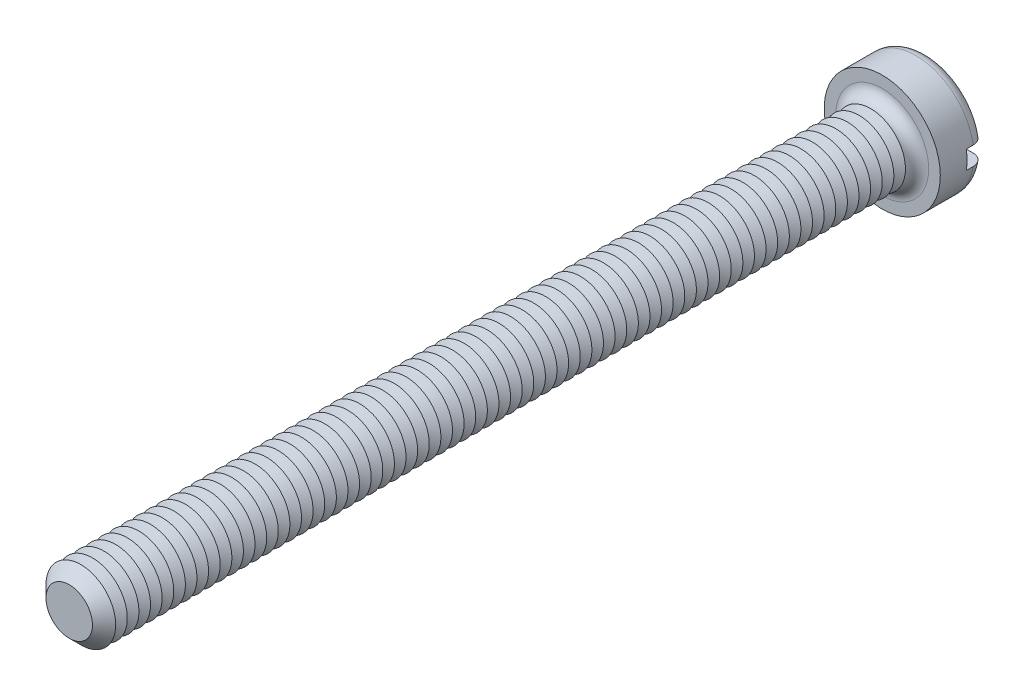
ISO-10303-21;
HEADER;
FILE_DESCRIPTION(('STEP AP214'),'2;1');
FILE_NAME('part.step','',(''),(''),'','','');
FILE_SCHEMA(('AUTOMOTIVE_DESIGN { 1 0 10303 214 1 1 1 1 }'));
ENDSEC;
DATA;
#1=APPLICATION_CONTEXT('core data for automotive mechanical design processes');
#2=APPLICATION_PROTOCOL_DEFINITION('international standard','automotive_design',2000,#1);
#3=PRODUCT_CONTEXT('',#1,'mechanical');
#4=PRODUCT('Part','Part','',(#3));
#5=PRODUCT_RELATED_PRODUCT_CATEGORY('part','',(#4));
#6=PRODUCT_DEFINITION_FORMATION('','',#4);
#7=PRODUCT_DEFINITION_CONTEXT('part definition',#1,'design');
#8=PRODUCT_DEFINITION('design','',#6,#7);
#9=PRODUCT_DEFINITION_SHAPE('','',#8);
#10=(LENGTH_UNIT() NAMED_UNIT(*) SI_UNIT(.MILLI.,.METRE.));
#11=(NAMED_UNIT(*) PLANE_ANGLE_UNIT() SI_UNIT($,.RADIAN.));
#12=(NAMED_UNIT(*) SI_UNIT($,.STERADIAN.) SOLID_ANGLE_UNIT());
#13=UNCERTAINTY_MEASURE_WITH_UNIT(LENGTH_MEASURE(1.E-05),#10,'distance_accuracy_value','');
#14=(GEOMETRIC_REPRESENTATION_CONTEXT(3) GLOBAL_UNCERTAINTY_ASSIGNED_CONTEXT((#13)) GLOBAL_UNIT_ASSIGNED_CONTEXT((#10,
#11,#12)) REPRESENTATION_CONTEXT('',''));
#15=CARTESIAN_POINT('',(0.,0.,0.));
#16=DIRECTION('',(0.,0.,1.));
#17=DIRECTION('',(1.,0.,0.));
#18=AXIS2_PLACEMENT_3D('',#15,#16,#17);
#19=CARTESIAN_POINT('',(0.,0.,-3.9));
#20=DIRECTION('',(0.,0.,1.));
#21=DIRECTION('',(1.,0.,0.));
#22=AXIS2_PLACEMENT_3D('',#19,#20,#21);
#23=PLANE('',#22);
#24=CARTESIAN_POINT('',(0.,0.,-3.9));
#25=DIRECTION('',(0.,0.,1.));
#26=DIRECTION('',(1.,0.,0.));
#27=AXIS2_PLACEMENT_3D('',#24,#25,#26);
#28=CIRCLE('',#27,4.);
#29=CARTESIAN_POINT('',(-3.91918358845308,0.800000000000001,-3.9));
#30=VERTEX_POINT('',#29);
#31=CARTESIAN_POINT('',(3.91918358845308,0.8,-3.9));
#32=VERTEX_POINT('',#31);
#33=EDGE_CURVE('E116',#30,#32,#28,.F.);
#34=ORIENTED_EDGE('',*,*,#33,.T.);
#35=DIRECTION('',(1.,0.,0.));
#36=VECTOR('',#35,1.);
#37=CARTESIAN_POINT('',(-5.,0.800000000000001,-3.9));
#38=LINE('',#37,#36);
#39=EDGE_CURVE('E111',#30,#32,#38,.T.);
#40=ORIENTED_EDGE('',*,*,#39,.F.);
#41=EDGE_LOOP('',(#34,#40));
#42=FACE_BOUND('',#41,.T.);
#43=ADVANCED_FACE('F39',(#42),#23,.F.);
#44=CARTESIAN_POINT('',(0.,0.,-2.9));
#45=DIRECTION('',(0.,0.,1.));
#46=DIRECTION('',(1.,0.,0.));
#47=AXIS2_PLACEMENT_3D('',#44,#45,#46);
#48=TOROIDAL_SURFACE('',#47,4.,1.);
#49=CARTESIAN_POINT('',(-4.76648512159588,0.800000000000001,-3.45304061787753));
#50=CARTESIAN_POINT('',(-4.73486405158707,0.800000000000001,-3.50001565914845));
#51=CARTESIAN_POINT('',(-4.69920787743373,0.800000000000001,-3.54432871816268));
#52=CARTESIAN_POINT('',(-4.62090302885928,0.800000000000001,-3.62634638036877));
#53=CARTESIAN_POINT('',(-4.57824494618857,0.800000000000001,-3.66404194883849));
#54=CARTESIAN_POINT('',(-4.48726975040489,0.800000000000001,-3.73172278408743));
#55=CARTESIAN_POINT('',(-4.43895902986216,0.800000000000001,-3.76171664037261));
#56=CARTESIAN_POINT('',(-4.33804923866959,0.800000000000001,-3.81326437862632));
#57=CARTESIAN_POINT('',(-4.2854512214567,0.800000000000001,-3.8348203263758));
#58=CARTESIAN_POINT('',(-4.17679895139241,0.800000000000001,-3.86918431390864));
#59=CARTESIAN_POINT('',(-4.12071163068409,0.800000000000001,-3.88188775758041));
#60=CARTESIAN_POINT('',(-4.00720729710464,0.800000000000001,-3.89785932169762));
#61=CARTESIAN_POINT('',(-3.94979011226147,0.800000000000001,-3.9011262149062));
#62=CARTESIAN_POINT('',(-3.83429042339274,0.800000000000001,-3.89816676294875));
#63=CARTESIAN_POINT('',(-3.77621176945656,0.800000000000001,-3.89178937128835));
#64=CARTESIAN_POINT('',(-3.66191938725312,0.800000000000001,-3.8694726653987));
#65=CARTESIAN_POINT('',(-3.60570580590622,0.800000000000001,-3.85353259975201));
#66=CARTESIAN_POINT('',(-3.49618749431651,0.800000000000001,-3.81233202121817));
#67=CARTESIAN_POINT('',(-3.44291561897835,0.800000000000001,-3.78698406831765));
#68=CARTESIAN_POINT('',(-3.34140774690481,0.800000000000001,-3.72766098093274));
#69=CARTESIAN_POINT('',(-3.29317182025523,0.800000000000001,-3.69368572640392));
#70=CARTESIAN_POINT('',(-3.20343355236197,0.800000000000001,-3.6182054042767));
#71=CARTESIAN_POINT('',(-3.16189680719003,0.800000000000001,-3.57674128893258));
#72=CARTESIAN_POINT('',(-3.08658236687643,0.800000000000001,-3.48727547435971));
#73=CARTESIAN_POINT('',(-3.05280364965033,0.800000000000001,-3.43927463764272));
#74=CARTESIAN_POINT('',(-2.99489532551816,0.800000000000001,-3.33932895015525));
#75=CARTESIAN_POINT('',(-2.97055012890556,0.800000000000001,-3.28750911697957));
#76=CARTESIAN_POINT('',(-2.93124252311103,0.800000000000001,-3.18042600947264));
#77=CARTESIAN_POINT('',(-2.91627793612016,0.800000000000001,-3.12516353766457));
#78=CARTESIAN_POINT('',(-2.89663075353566,0.800000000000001,-3.01470560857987));
#79=CARTESIAN_POINT('',(-2.89162828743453,0.800000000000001,-2.95956691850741));
#80=CARTESIAN_POINT('',(-2.89112479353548,0.800000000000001,-2.84924961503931));
#81=CARTESIAN_POINT('',(-2.89562264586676,0.800000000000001,-2.79407100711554));
#82=CARTESIAN_POINT('',(-2.91379565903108,0.800000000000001,-2.6861912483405));
#83=CARTESIAN_POINT('',(-2.92731815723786,0.800000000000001,-2.63346424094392));
#84=CARTESIAN_POINT('',(-2.96290888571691,0.800000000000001,-2.53098203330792));
#85=CARTESIAN_POINT('',(-2.98497757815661,0.800000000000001,-2.48122699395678));
#86=CARTESIAN_POINT('',(-3.03728055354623,0.800000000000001,-2.38535286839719));
#87=CARTESIAN_POINT('',(-3.06761989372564,0.800000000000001,-2.33929117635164));
#88=CARTESIAN_POINT('',(-3.13537950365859,0.800000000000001,-2.2527125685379));
#89=CARTESIAN_POINT('',(-3.17280082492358,0.800000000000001,-2.21219647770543));
#90=CARTESIAN_POINT('',(-3.2549164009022,0.800000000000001,-2.13651195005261));
#91=CARTESIAN_POINT('',(-3.29980186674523,0.800000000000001,-2.10155095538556));
#92=CARTESIAN_POINT('',(-3.39467666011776,0.800000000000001,-2.03942270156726));
#93=CARTESIAN_POINT('',(-3.44466673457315,0.800000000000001,-2.01225658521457));
#94=CARTESIAN_POINT('',(-3.5497933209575,0.800000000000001,-1.96576935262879));
#95=CARTESIAN_POINT('',(-3.60503228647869,0.800000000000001,-1.94667963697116));
#96=CARTESIAN_POINT('',(-3.71791613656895,0.800000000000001,-1.91794308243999));
#97=CARTESIAN_POINT('',(-3.77556119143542,0.800000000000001,-1.90829691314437));
#98=CARTESIAN_POINT('',(-3.89221522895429,0.800000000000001,-1.89869331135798));
#99=CARTESIAN_POINT('',(-3.9512319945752,0.800000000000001,-1.89882985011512));
#100=CARTESIAN_POINT('',(-4.06839541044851,0.800000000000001,-1.90907818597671));
#101=CARTESIAN_POINT('',(-4.12654207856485,0.800000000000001,-1.91918977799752));
#102=CARTESIAN_POINT('',(-4.23988103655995,0.800000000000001,-1.9490667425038));
#103=CARTESIAN_POINT('',(-4.29509069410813,0.800000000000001,-1.96876615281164));
#104=CARTESIAN_POINT('',(-4.40134194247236,0.800000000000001,-2.01729572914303));
#105=CARTESIAN_POINT('',(-4.45238383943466,0.800000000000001,-2.04612522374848));
#106=CARTESIAN_POINT('',(-4.54801343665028,0.800000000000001,-2.1116316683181));
#107=CARTESIAN_POINT('',(-4.59268768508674,0.800000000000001,-2.14818225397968));
#108=CARTESIAN_POINT('',(-4.67513924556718,0.800000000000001,-2.22837632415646));
#109=CARTESIAN_POINT('',(-4.71291715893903,0.800000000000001,-2.27201918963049));
#110=CARTESIAN_POINT('',(-4.77986554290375,0.800000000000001,-2.36439990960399));
#111=CARTESIAN_POINT('',(-4.80916462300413,0.800000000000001,-2.41304457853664));
#112=CARTESIAN_POINT('',(-4.85906149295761,0.800000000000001,-2.51460659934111));
#113=CARTESIAN_POINT('',(-4.8796602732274,0.800000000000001,-2.56752346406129));
#114=CARTESIAN_POINT('',(-4.9113264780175,0.800000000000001,-2.67542592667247));
#115=CARTESIAN_POINT('',(-4.92250819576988,0.800000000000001,-2.73037800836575));
#116=CARTESIAN_POINT('',(-4.93542682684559,0.800000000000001,-2.84139649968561));
#117=CARTESIAN_POINT('',(-4.93716171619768,0.800000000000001,-2.89746314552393));
#118=CARTESIAN_POINT('',(-4.93114851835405,0.800000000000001,-3.00876455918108));
#119=CARTESIAN_POINT('',(-4.92345325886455,0.800000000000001,-3.0640022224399));
#120=CARTESIAN_POINT('',(-4.8989032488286,0.800000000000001,-3.17235240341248));
#121=CARTESIAN_POINT('',(-4.88205998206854,0.800000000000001,-3.22546749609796));
#122=CARTESIAN_POINT('',(-4.84819200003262,0.800000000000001,-3.30764066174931));
#123=CARTESIAN_POINT('',(-4.83390853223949,0.800000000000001,-3.33785845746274));
#124=CARTESIAN_POINT('',(-4.80237957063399,0.800000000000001,-3.39670633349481));
#125=CARTESIAN_POINT('',(-4.78513409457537,0.800000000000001,-3.42533642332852));
#126=CARTESIAN_POINT('',(-4.76648512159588,0.800000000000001,-3.45304061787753));
#127=B_SPLINE_CURVE_WITH_KNOTS('',3,(#49,#50,#51,#52,#53,#54,#55,#56,#57,#58,#59,#60,#61,#62,
#63,#64,#65,#66,#67,#68,#69,#70,#71,#72,#73,#74,#75,#76,#77,#78,#79,#80,#81,#82,#83,#84,#85,#86,
#87,#88,#89,#90,#91,#92,#93,#94,#95,#96,#97,#98,#99,#100,#101,#102,#103,#104,#105,#106,#107,
#108,#109,#110,#111,#112,#113,#114,#115,#116,#117,#118,#119,#120,#121,#122,#123,#124,#125,#126),
.UNSPECIFIED.,.T.,.F.,(4,2,2,2,2,2,2,2,2,2,2,2,2,2,2,2,2,2,2,2,2,2,2,2,2,2,2,2,2,2,2,2,2,2,2,2,
2,2,4),(0.,0.169755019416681,0.339740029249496,0.509534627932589,0.67928763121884,
0.851013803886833,1.02276230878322,1.19722869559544,1.37170879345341,1.54785292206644,
1.72399950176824,1.89921049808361,2.07439839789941,2.24530597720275,2.41617386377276,
2.58146078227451,2.74672821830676,2.90926852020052,3.0718176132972,3.2365363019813,
3.40127946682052,3.57118676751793,3.74111896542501,3.91563534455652,4.09016409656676,
4.26636956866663,4.4425714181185,4.61757781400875,4.79257134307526,4.96489650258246,
5.13720662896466,5.30674670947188,5.47626748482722,5.64369988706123,5.81116816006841,
5.97770254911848,6.14402836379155,6.24414438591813,6.34425980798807),.UNSPECIFIED.);
#128=CARTESIAN_POINT('',(-4.93558507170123,0.800000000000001,-2.9));
#129=VERTEX_POINT('',#128);
#130=EDGE_CURVE('E723',#129,#30,#127,.T.);
#131=ORIENTED_EDGE('',*,*,#130,.F.);
#132=CARTESIAN_POINT('',(0.,0.,-2.9));
#133=DIRECTION('',(0.,0.,1.));
#134=DIRECTION('',(1.,0.,0.));
#135=AXIS2_PLACEMENT_3D('',#132,#133,#134);
#136=CIRCLE('',#135,5.);
#137=CARTESIAN_POINT('',(4.93558507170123,0.8,-2.9));
#138=VERTEX_POINT('',#137);
#139=EDGE_CURVE('E125',#138,#129,#136,.T.);
#140=ORIENTED_EDGE('',*,*,#139,.F.);
#141=CARTESIAN_POINT('',(2.98553785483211,0.8,-3.31649797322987));
#142=CARTESIAN_POINT('',(3.00991125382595,0.8,-3.36788093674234));
#143=CARTESIAN_POINT('',(3.03875556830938,0.8,-3.41719756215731));
#144=CARTESIAN_POINT('',(3.1043993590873,0.8,-3.51028676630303));
#145=CARTESIAN_POINT('',(3.1412115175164,0.8,-3.55405032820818));
#146=CARTESIAN_POINT('',(3.22153641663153,0.8,-3.63476402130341));
#147=CARTESIAN_POINT('',(3.26503706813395,0.8,-3.67172618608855));
#148=CARTESIAN_POINT('',(3.35749627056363,0.8,-3.73799476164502));
#149=CARTESIAN_POINT('',(3.4064533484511,0.8,-3.76730323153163));
#150=CARTESIAN_POINT('',(3.5095773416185,0.8,-3.81809642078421));
#151=CARTESIAN_POINT('',(3.56383317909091,0.8,-3.83940072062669));
#152=CARTESIAN_POINT('',(3.67513017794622,0.8,-3.87272481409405));
#153=CARTESIAN_POINT('',(3.7321717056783,0.8,-3.88474338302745));
#154=CARTESIAN_POINT('',(3.84815688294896,0.8,-3.89923413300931));
#155=CARTESIAN_POINT('',(3.90711516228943,0.8,-3.9015896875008));
#156=CARTESIAN_POINT('',(4.02458610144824,0.8,-3.89631753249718));
#157=CARTESIAN_POINT('',(4.08309876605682,0.8,-3.8886899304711));
#158=CARTESIAN_POINT('',(4.19768646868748,0.8,-3.86366584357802));
#159=CARTESIAN_POINT('',(4.25377243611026,0.8,-3.84631948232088));
#160=CARTESIAN_POINT('',(4.3621676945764,0.8,-3.80231797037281));
#161=CARTESIAN_POINT('',(4.41447726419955,0.8,-3.77566350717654));
#162=CARTESIAN_POINT('',(4.51300872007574,0.8,-3.71421163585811));
#163=CARTESIAN_POINT('',(4.5593085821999,0.8,-3.67953927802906));
#164=CARTESIAN_POINT('',(4.64530675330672,0.8,-3.60279495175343));
#165=CARTESIAN_POINT('',(4.68500564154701,0.8,-3.56072363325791));
#166=CARTESIAN_POINT('',(4.75599202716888,0.8,-3.47111750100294));
#167=CARTESIAN_POINT('',(4.7874061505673,0.8,-3.42368298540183));
#168=CARTESIAN_POINT('',(4.84170328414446,0.8,-3.32415927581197));
#169=CARTESIAN_POINT('',(4.86458695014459,0.8,-3.2720704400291));
#170=CARTESIAN_POINT('',(4.90088120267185,0.8,-3.16544016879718));
#171=CARTESIAN_POINT('',(4.91440984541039,0.8,-3.11093889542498));
#172=CARTESIAN_POINT('',(4.93205429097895,0.8,-3.00043391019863));
#173=CARTESIAN_POINT('',(4.93617053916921,0.8,-2.9444302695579));
#174=CARTESIAN_POINT('',(4.93486973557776,0.8,-2.83292218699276));
#175=CARTESIAN_POINT('',(4.92951827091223,0.8,-2.77741696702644));
#176=CARTESIAN_POINT('',(4.90957104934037,0.8,-2.66809456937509));
#177=CARTESIAN_POINT('',(4.89497541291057,0.8,-2.61427736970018));
#178=CARTESIAN_POINT('',(4.85697876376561,0.8,-2.50985095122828));
#179=CARTESIAN_POINT('',(4.83357805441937,0.8,-2.45924162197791));
#180=CARTESIAN_POINT('',(4.77866660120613,0.8,-2.36263484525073));
#181=CARTESIAN_POINT('',(4.74715567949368,0.8,-2.31663749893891));
#182=CARTESIAN_POINT('',(4.67670791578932,0.8,-2.23021464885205));
#183=CARTESIAN_POINT('',(4.6377224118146,0.8,-2.1898288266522));
#184=CARTESIAN_POINT('',(4.55359880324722,0.8,-2.11607828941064));
#185=CARTESIAN_POINT('',(4.50846036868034,0.8,-2.08271395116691));
#186=CARTESIAN_POINT('',(4.41271544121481,0.8,-2.02349513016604));
#187=CARTESIAN_POINT('',(4.36204749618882,0.8,-1.99774003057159));
#188=CARTESIAN_POINT('',(4.257155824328,0.8,-1.95495040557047));
#189=CARTESIAN_POINT('',(4.20293181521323,0.8,-1.93791657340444));
#190=CARTESIAN_POINT('',(4.09154156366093,0.8,-1.91276335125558));
#191=CARTESIAN_POINT('',(4.03434212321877,0.8,-1.90479098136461));
#192=CARTESIAN_POINT('',(3.91941228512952,0.8,-1.89840884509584));
#193=CARTESIAN_POINT('',(3.8616818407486,0.8,-1.89999992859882));
#194=CARTESIAN_POINT('',(3.7464111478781,0.8,-1.91275144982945));
#195=CARTESIAN_POINT('',(3.6888866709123,0.8,-1.92405471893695));
#196=CARTESIAN_POINT('',(3.57652290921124,0.8,-1.95609086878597));
#197=CARTESIAN_POINT('',(3.52168382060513,0.8,-1.97682443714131));
#198=CARTESIAN_POINT('',(3.41589179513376,0.8,-2.02733294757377));
#199=CARTESIAN_POINT('',(3.36496676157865,0.8,-2.05716640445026));
#200=CARTESIAN_POINT('',(3.26890903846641,0.8,-2.12504079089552));
#201=CARTESIAN_POINT('',(3.22377627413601,0.8,-2.16308161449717));
#202=CARTESIAN_POINT('',(3.141135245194,0.8,-2.24593284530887));
#203=CARTESIAN_POINT('',(3.1035541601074,0.8,-2.29067053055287));
#204=CARTESIAN_POINT('',(3.03669700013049,0.8,-2.38597317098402));
#205=CARTESIAN_POINT('',(3.00741914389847,0.8,-2.43653687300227));
#206=CARTESIAN_POINT('',(2.95891799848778,0.8,-2.54052959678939));
#207=CARTESIAN_POINT('',(2.93943249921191,0.8,-2.59383627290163));
#208=CARTESIAN_POINT('',(2.9100081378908,0.8,-2.70303736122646));
#209=CARTESIAN_POINT('',(2.90006970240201,0.8,-2.75893188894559));
#210=CARTESIAN_POINT('',(2.89027863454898,0.8,-2.86986958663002));
#211=CARTESIAN_POINT('',(2.89012791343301,0.8,-2.92488680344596));
#212=CARTESIAN_POINT('',(2.89917145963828,0.8,-3.03409648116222));
#213=CARTESIAN_POINT('',(2.90835313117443,0.8,-3.08828995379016));
#214=CARTESIAN_POINT('',(2.92977618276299,0.8,-3.17141652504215));
#215=CARTESIAN_POINT('',(2.93899011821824,0.8,-3.20116372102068));
#216=CARTESIAN_POINT('',(2.96020249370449,0.8,-3.25964614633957));
#217=CARTESIAN_POINT('',(2.97220082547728,0.8,-3.28838141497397));
#218=CARTESIAN_POINT('',(2.98553785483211,0.8,-3.31649797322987));
#219=B_SPLINE_CURVE_WITH_KNOTS('',3,(#141,#142,#143,#144,#145,#146,#147,#148,#149,#150,#151,
#152,#153,#154,#155,#156,#157,#158,#159,#160,#161,#162,#163,#164,#165,#166,#167,#168,#169,#170,
#171,#172,#173,#174,#175,#176,#177,#178,#179,#180,#181,#182,#183,#184,#185,#186,#187,#188,#189,
#190,#191,#192,#193,#194,#195,#196,#197,#198,#199,#200,#201,#202,#203,#204,#205,#206,#207,#208,
#209,#210,#211,#212,#213,#214,#215,#216,#217,#218),.UNSPECIFIED.,.T.,.F.,(4,2,2,2,2,2,2,2,2,2,2,
2,2,2,2,2,2,2,2,2,2,2,2,2,2,2,2,2,2,2,2,2,2,2,2,2,2,2,4),(0.,0.170493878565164,
0.341261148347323,0.511723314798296,0.682139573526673,0.856194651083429,1.03027268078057,
1.20644565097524,1.38261672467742,1.55788746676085,1.73314526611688,1.90583484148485,
2.07850925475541,2.24836742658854,2.41821253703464,2.58587311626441,2.75352576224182,
2.92002154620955,3.08651516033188,3.25300303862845,3.41949456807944,3.58710926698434,
3.75473295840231,3.92445790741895,4.09419634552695,4.26665110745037,4.43912119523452,
4.61417197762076,4.78923552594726,4.96544940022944,5.1416609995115,5.31608191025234,
5.49046537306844,5.65989063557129,5.82932346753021,5.99359365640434,6.157642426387,
6.250939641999,6.34423323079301),.UNSPECIFIED.);
#220=EDGE_CURVE('E725',#32,#138,#219,.T.);
#221=ORIENTED_EDGE('',*,*,#220,.F.);
#222=ORIENTED_EDGE('',*,*,#33,.F.);
#223=EDGE_LOOP('',(#131,#140,#221,#222));
#224=FACE_BOUND('',#223,.T.);
#225=ADVANCED_FACE('F707',(#224),#48,.T.);
#226=CARTESIAN_POINT('',(0.,0.,-3.9));
#227=DIRECTION('',(0.,0.,1.));
#228=DIRECTION('',(1.,0.,0.));
#229=AXIS2_PLACEMENT_3D('',#226,#227,#228);
#230=CYLINDRICAL_SURFACE('',#229,5.);
#231=DIRECTION('',(0.,0.,1.));
#232=VECTOR('',#231,1.);
#233=CARTESIAN_POINT('',(4.93558507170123,0.8,-3.9));
#234=LINE('',#233,#232);
#235=CARTESIAN_POINT('',(4.93558507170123,0.8,-2.3));
#236=VERTEX_POINT('',#235);
#237=EDGE_CURVE('E738',#138,#236,#234,.T.);
#238=ORIENTED_EDGE('',*,*,#237,.F.);
#239=ORIENTED_EDGE('',*,*,#139,.T.);
#240=DIRECTION('',(0.,0.,1.));
#241=VECTOR('',#240,1.);
#242=CARTESIAN_POINT('',(-4.93558507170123,0.800000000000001,-3.9));
#243=LINE('',#242,#241);
#244=CARTESIAN_POINT('',(-4.93558507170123,0.800000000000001,-2.3));
#245=VERTEX_POINT('',#244);
#246=EDGE_CURVE('E63',#245,#129,#243,.F.);
#247=ORIENTED_EDGE('',*,*,#246,.F.);
#248=CARTESIAN_POINT('',(0.,0.,-2.3));
#249=DIRECTION('',(0.,0.,-1.));
#250=DIRECTION('',(-1.,0.,0.));
#251=AXIS2_PLACEMENT_3D('',#248,#249,#250);
#252=CIRCLE('',#251,5.);
#253=CARTESIAN_POINT('',(-4.93558507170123,-0.799999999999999,-2.3));
#254=VERTEX_POINT('',#253);
#255=EDGE_CURVE('E43',#245,#254,#252,.F.);
#256=ORIENTED_EDGE('',*,*,#255,.T.);
#257=DIRECTION('',(0.,0.,1.));
#258=VECTOR('',#257,1.);
#259=CARTESIAN_POINT('',(-4.93558507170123,-0.799999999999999,-3.9));
#260=LINE('',#259,#258);
#261=CARTESIAN_POINT('',(-4.93558507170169,-0.799999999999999,-2.89999999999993));
#262=VERTEX_POINT('',#261);
#263=EDGE_CURVE('E736',#262,#254,#260,.T.);
#264=ORIENTED_EDGE('',*,*,#263,.F.);
#265=CARTESIAN_POINT('',(4.93558507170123,-0.8,-2.9));
#266=VERTEX_POINT('',#265);
#267=EDGE_CURVE('E127',#262,#266,#136,.T.);
#268=ORIENTED_EDGE('',*,*,#267,.T.);
#269=DIRECTION('',(0.,0.,1.));
#270=VECTOR('',#269,1.);
#271=CARTESIAN_POINT('',(4.93558507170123,-0.8,-3.9));
#272=LINE('',#271,#270);
#273=CARTESIAN_POINT('',(4.93558507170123,-0.8,-2.3));
#274=VERTEX_POINT('',#273);
#275=EDGE_CURVE('E55',#274,#266,#272,.F.);
#276=ORIENTED_EDGE('',*,*,#275,.F.);
#277=EDGE_CURVE('E11',#274,#236,#252,.F.);
#278=ORIENTED_EDGE('',*,*,#277,.T.);
#279=EDGE_LOOP('',(#238,#239,#247,#256,#264,#268,#276,#278));
#280=FACE_BOUND('',#279,.T.);
#281=CARTESIAN_POINT('',(0.,0.,0.));
#282=DIRECTION('',(0.,0.,1.));
#283=DIRECTION('',(1.,0.,0.));
#284=AXIS2_PLACEMENT_3D('',#281,#282,#283);
#285=CIRCLE('',#284,5.);
#286=CARTESIAN_POINT('',(5.,0.,0.));
#287=VERTEX_POINT('',#286);
#288=EDGE_CURVE('E741',#287,#287,#285,.T.);
#289=ORIENTED_EDGE('',*,*,#288,.F.);
#290=EDGE_LOOP('',(#289));
#291=FACE_BOUND('',#290,.T.);
#292=ADVANCED_FACE('F703',(#280,#291),#230,.T.);
#293=CARTESIAN_POINT('',(3.91918358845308,-0.8,-3.9));
#294=VERTEX_POINT('',#293);
#295=CARTESIAN_POINT('',(-3.91918358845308,-0.799999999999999,-3.9));
#296=VERTEX_POINT('',#295);
#297=EDGE_CURVE('E109',#294,#296,#28,.F.);
#298=ORIENTED_EDGE('',*,*,#297,.T.);
#299=DIRECTION('',(-1.,0.,0.));
#300=VECTOR('',#299,1.);
#301=CARTESIAN_POINT('',(-5.,-0.799999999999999,-3.9));
#302=LINE('',#301,#300);
#303=EDGE_CURVE('E96',#294,#296,#302,.T.);
#304=ORIENTED_EDGE('',*,*,#303,.F.);
#305=EDGE_LOOP('',(#298,#304));
#306=FACE_BOUND('',#305,.T.);
#307=ADVANCED_FACE('F108',(#306),#23,.F.);
#308=CARTESIAN_POINT('',(0.,0.,0.));
#309=DIRECTION('',(0.,0.,1.));
#310=DIRECTION('',(1.,0.,0.));
#311=AXIS2_PLACEMENT_3D('',#308,#309,#310);
#312=PLANE('',#311);
#313=CARTESIAN_POINT('',(0.,0.,0.));
#314=DIRECTION('',(0.,0.,1.));
#315=DIRECTION('',(1.,0.,0.));
#316=AXIS2_PLACEMENT_3D('',#313,#314,#315);
#317=CIRCLE('',#316,4.);
#318=CARTESIAN_POINT('',(4.,0.,0.));
#319=VERTEX_POINT('',#318);
#320=EDGE_CURVE('E115',#319,#319,#317,.F.);
#321=ORIENTED_EDGE('',*,*,#320,.T.);
#322=EDGE_LOOP('',(#321));
#323=FACE_BOUND('',#322,.T.);
#324=ORIENTED_EDGE('',*,*,#288,.T.);
#325=EDGE_LOOP('',(#324));
#326=FACE_BOUND('',#325,.T.);
#327=ADVANCED_FACE('F702',(#323,#326),#312,.T.);
#328=CARTESIAN_POINT('',(-4.76648512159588,-0.799999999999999,-3.45304061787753));
#329=CARTESIAN_POINT('',(-4.7975694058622,-0.799999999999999,-3.40685392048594));
#330=CARTESIAN_POINT('',(-4.82479903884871,-0.799999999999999,-3.35802740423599));
#331=CARTESIAN_POINT('',(-4.87070632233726,-0.799999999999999,-3.25646127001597));
#332=CARTESIAN_POINT('',(-4.8893747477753,-0.799999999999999,-3.20371750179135));
#333=CARTESIAN_POINT('',(-4.91756720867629,-0.799999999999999,-3.09584501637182));
#334=CARTESIAN_POINT('',(-4.92709302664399,-0.799999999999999,-3.04071676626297));
#335=CARTESIAN_POINT('',(-4.93671217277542,-0.799999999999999,-2.92965669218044));
#336=CARTESIAN_POINT('',(-4.93680767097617,-0.799999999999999,-2.87372505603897));
#337=CARTESIAN_POINT('',(-4.92758675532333,-0.799999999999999,-2.76284675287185));
#338=CARTESIAN_POINT('',(-4.91830421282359,-0.799999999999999,-2.70789726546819));
#339=CARTESIAN_POINT('',(-4.89065741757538,-0.799999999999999,-2.60033228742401));
#340=CARTESIAN_POINT('',(-4.87229291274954,-0.799999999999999,-2.54771686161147));
#341=CARTESIAN_POINT('',(-4.82699855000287,-0.799999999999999,-2.44622441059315));
#342=CARTESIAN_POINT('',(-4.80005659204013,-0.799999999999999,-2.39735278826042));
#343=CARTESIAN_POINT('',(-4.73841244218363,-0.799999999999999,-2.30477947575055));
#344=CARTESIAN_POINT('',(-4.70371003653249,-0.799999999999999,-2.26107792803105));
#345=CARTESIAN_POINT('',(-4.62724516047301,-0.799999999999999,-2.17969334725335));
#346=CARTESIAN_POINT('',(-4.58542787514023,-0.799999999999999,-2.14206183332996));
#347=CARTESIAN_POINT('',(-4.49614171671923,-0.799999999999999,-2.07424284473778));
#348=CARTESIAN_POINT('',(-4.44867251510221,-0.799999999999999,-2.04405580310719));
#349=CARTESIAN_POINT('',(-4.34875035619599,-0.799999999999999,-1.99153688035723));
#350=CARTESIAN_POINT('',(-4.29623870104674,-0.799999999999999,-1.96931670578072));
#351=CARTESIAN_POINT('',(-4.18826905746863,-0.799999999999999,-1.93384994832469));
#352=CARTESIAN_POINT('',(-4.1328108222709,-0.799999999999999,-1.92060411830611));
#353=CARTESIAN_POINT('',(-4.01956054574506,-0.799999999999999,-1.90323798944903));
#354=CARTESIAN_POINT('',(-3.96174522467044,-0.799999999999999,-1.89926947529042));
#355=CARTESIAN_POINT('',(-3.84625419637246,-0.799999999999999,-1.90095183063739));
#356=CARTESIAN_POINT('',(-3.78857850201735,-0.799999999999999,-1.90660355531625));
#357=CARTESIAN_POINT('',(-3.67415602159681,-0.799999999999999,-1.92748272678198));
#358=CARTESIAN_POINT('',(-3.61743328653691,-0.799999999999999,-1.94284216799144));
#359=CARTESIAN_POINT('',(-3.50734962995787,-0.799999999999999,-1.9828275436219));
#360=CARTESIAN_POINT('',(-3.4539889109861,-0.799999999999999,-2.00745403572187));
#361=CARTESIAN_POINT('',(-3.35197118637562,-0.799999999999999,-2.06542964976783));
#362=CARTESIAN_POINT('',(-3.30333217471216,-0.799999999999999,-2.0988104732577));
#363=CARTESIAN_POINT('',(-3.21244692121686,-0.799999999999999,-2.17337326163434));
#364=CARTESIAN_POINT('',(-3.17020039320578,-0.799999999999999,-2.21455487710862));
#365=CARTESIAN_POINT('',(-3.0940098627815,-0.799999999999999,-2.30296695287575));
#366=CARTESIAN_POINT('',(-3.05995540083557,-0.799999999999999,-2.35010211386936));
#367=CARTESIAN_POINT('',(-3.00053815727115,-0.799999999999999,-2.4495670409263));
#368=CARTESIAN_POINT('',(-2.97517362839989,-0.799999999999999,-2.50189576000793));
#369=CARTESIAN_POINT('',(-2.93470320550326,-0.799999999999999,-2.60853979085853));
#370=CARTESIAN_POINT('',(-2.91930557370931,-0.799999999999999,-2.66274437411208));
#371=CARTESIAN_POINT('',(-2.89812734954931,-0.799999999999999,-2.77299836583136));
#372=CARTESIAN_POINT('',(-2.89234481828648,-0.799999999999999,-2.82904740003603));
#373=CARTESIAN_POINT('',(-2.89064073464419,-0.799999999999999,-2.93970612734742));
#374=CARTESIAN_POINT('',(-2.89444549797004,-0.799999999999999,-2.99431180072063));
#375=CARTESIAN_POINT('',(-2.9112006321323,-0.799999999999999,-3.10209766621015));
#376=CARTESIAN_POINT('',(-2.9241507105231,-0.799999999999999,-3.1552779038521));
#377=CARTESIAN_POINT('',(-2.95868580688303,-0.799999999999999,-3.25858631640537));
#378=CARTESIAN_POINT('',(-2.98024709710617,-0.799999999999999,-3.30872244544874));
#379=CARTESIAN_POINT('',(-3.03128544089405,-0.799999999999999,-3.40478519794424));
#380=CARTESIAN_POINT('',(-3.06076335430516,-0.799999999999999,-3.45071136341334));
#381=CARTESIAN_POINT('',(-3.12753448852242,-0.799999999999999,-3.53826932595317));
#382=CARTESIAN_POINT('',(-3.16500083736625,-0.799999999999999,-3.57976901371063));
#383=CARTESIAN_POINT('',(-3.24617503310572,-0.799999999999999,-3.65613204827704));
#384=CARTESIAN_POINT('',(-3.28988388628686,-0.799999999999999,-3.69099432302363));
#385=CARTESIAN_POINT('',(-3.38380639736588,-0.799999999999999,-3.75424083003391));
#386=CARTESIAN_POINT('',(-3.43418287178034,-0.799999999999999,-3.78238342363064));
#387=CARTESIAN_POINT('',(-3.53887888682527,-0.799999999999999,-3.83000231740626));
#388=CARTESIAN_POINT('',(-3.59319889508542,-0.799999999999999,-3.84947758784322));
#389=CARTESIAN_POINT('',(-3.70539237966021,-0.799999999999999,-3.87954336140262));
#390=CARTESIAN_POINT('',(-3.76331464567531,-0.799999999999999,-3.88995217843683));
#391=CARTESIAN_POINT('',(-3.88008461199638,-0.799999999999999,-3.9009132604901));
#392=CARTESIAN_POINT('',(-3.93893230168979,-0.799999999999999,-3.9014656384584));
#393=CARTESIAN_POINT('',(-4.05594892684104,-0.799999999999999,-3.89264187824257));
#394=CARTESIAN_POINT('',(-4.11411702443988,-0.799999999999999,-3.88325457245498));
#395=CARTESIAN_POINT('',(-4.22802928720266,-0.799999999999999,-3.85472582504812));
#396=CARTESIAN_POINT('',(-4.28377297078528,-0.799999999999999,-3.83558245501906));
#397=CARTESIAN_POINT('',(-4.39054463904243,-0.799999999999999,-3.78829842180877));
#398=CARTESIAN_POINT('',(-4.44161887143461,-0.799999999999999,-3.76026208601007));
#399=CARTESIAN_POINT('',(-4.53818016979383,-0.799999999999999,-3.69589278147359));
#400=CARTESIAN_POINT('',(-4.58367442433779,-0.799999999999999,-3.65957066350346));
#401=CARTESIAN_POINT('',(-4.65208830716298,-0.799999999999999,-3.59453310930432));
#402=CARTESIAN_POINT('',(-4.67711825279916,-0.799999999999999,-3.56800018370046));
#403=CARTESIAN_POINT('',(-4.72414423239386,-0.799999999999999,-3.51236863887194));
#404=CARTESIAN_POINT('',(-4.74614029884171,-0.799999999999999,-3.48327004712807));
#405=CARTESIAN_POINT('',(-4.76648512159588,-0.799999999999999,-3.45304061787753));
#406=B_SPLINE_CURVE_WITH_KNOTS('',3,(#328,#329,#330,#331,#332,#333,#334,#335,#336,#337,#338,
#339,#340,#341,#342,#343,#344,#345,#346,#347,#348,#349,#350,#351,#352,#353,#354,#355,#356,#357,
#358,#359,#360,#361,#362,#363,#364,#365,#366,#367,#368,#369,#370,#371,#372,#373,#374,#375,#376,
#377,#378,#379,#380,#381,#382,#383,#384,#385,#386,#387,#388,#389,#390,#391,#392,#393,#394,#395,
#396,#397,#398,#399,#400,#401,#402,#403,#404,#405),.UNSPECIFIED.,.T.,.F.,(4,2,2,2,2,2,2,2,2,2,2,
2,2,2,2,2,2,2,2,2,2,2,2,2,2,2,2,2,2,2,2,2,2,2,2,2,2,2,4),(0.,0.166886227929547,
0.333951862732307,0.500984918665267,0.667979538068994,0.834373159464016,1.00077139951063,
1.16740542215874,1.33404403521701,1.50202999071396,1.67002571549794,1.84029248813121,
2.01057354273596,2.18362161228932,2.35668506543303,2.53215380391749,2.70763310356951,
2.88375684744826,3.05987270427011,3.23346085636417,3.40701408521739,3.57522519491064,
3.74340238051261,3.90683338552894,4.0702591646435,4.23323770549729,4.39623395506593,
4.56320691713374,4.7302068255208,4.90252468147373,5.07486300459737,5.25058028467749,
5.42629555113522,5.60220844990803,5.77815613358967,5.95211162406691,6.12584060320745,
6.23506966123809,6.34429754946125),.UNSPECIFIED.);
#407=EDGE_CURVE('E103',#296,#262,#406,.T.);
#408=ORIENTED_EDGE('',*,*,#407,.F.);
#409=ORIENTED_EDGE('',*,*,#297,.F.);
#410=CARTESIAN_POINT('',(2.98553785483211,-0.8,-3.31649797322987));
#411=CARTESIAN_POINT('',(2.96216773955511,-0.8,-3.26721849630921));
#412=CARTESIAN_POINT('',(2.94287503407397,-0.8,-3.21596872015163));
#413=CARTESIAN_POINT('',(2.91313258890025,-0.8,-3.11092723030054));
#414=CARTESIAN_POINT('',(2.9026902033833,-0.8,-3.0571334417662));
#415=CARTESIAN_POINT('',(2.89104377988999,-0.8,-2.94853922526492));
#416=CARTESIAN_POINT('',(2.88984130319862,-0.8,-2.89373862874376));
#417=CARTESIAN_POINT('',(2.89672585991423,-0.8,-2.78473646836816));
#418=CARTESIAN_POINT('',(2.90481120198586,-0.8,-2.73053479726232));
#419=CARTESIAN_POINT('',(2.92989134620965,-0.8,-2.62460092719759));
#420=CARTESIAN_POINT('',(2.94682969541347,-0.8,-2.57285532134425));
#421=CARTESIAN_POINT('',(2.9889990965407,-0.8,-2.47286425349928));
#422=CARTESIAN_POINT('',(3.01423103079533,-0.8,-2.42461916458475));
#423=CARTESIAN_POINT('',(3.07271536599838,-0.8,-2.33201565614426));
#424=CARTESIAN_POINT('',(3.10610710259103,-0.8,-2.28774532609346));
#425=CARTESIAN_POINT('',(3.17963417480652,-0.8,-2.205215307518));
#426=CARTESIAN_POINT('',(3.21977054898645,-0.8,-2.16695654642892));
#427=CARTESIAN_POINT('',(3.3070361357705,-0.8,-2.09624274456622));
#428=CARTESIAN_POINT('',(3.35434874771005,-0.8,-2.06401396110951));
#429=CARTESIAN_POINT('',(3.45361131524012,-0.8,-2.00773436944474));
#430=CARTESIAN_POINT('',(3.50556189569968,-0.8,-1.98368466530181));
#431=CARTESIAN_POINT('',(3.61398433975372,-0.8,-1.94389460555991));
#432=CARTESIAN_POINT('',(3.67053506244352,-0.8,-1.92836880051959));
#433=CARTESIAN_POINT('',(3.78543606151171,-0.8,-1.90696594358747));
#434=CARTESIAN_POINT('',(3.84378643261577,-0.8,-1.90108940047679));
#435=CARTESIAN_POINT('',(3.96100201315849,-0.8,-1.89918115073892));
#436=CARTESIAN_POINT('',(4.01986821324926,-0.8,-1.90320860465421));
#437=CARTESIAN_POINT('',(4.13606891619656,-0.8,-1.9211820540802));
#438=CARTESIAN_POINT('',(4.19340347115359,-0.8,-1.93512771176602));
#439=CARTESIAN_POINT('',(4.30434213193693,-0.8,-1.97243705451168));
#440=CARTESIAN_POINT('',(4.35797549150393,-0.8,-1.99571368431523));
#441=CARTESIAN_POINT('',(4.46048254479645,-0.8,-2.0510826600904));
#442=CARTESIAN_POINT('',(4.50935662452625,-0.8,-2.08317429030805));
#443=CARTESIAN_POINT('',(4.60012348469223,-0.8,-2.15471647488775));
#444=CARTESIAN_POINT('',(4.64211506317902,-0.8,-2.19404167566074));
#445=CARTESIAN_POINT('',(4.71877054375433,-0.8,-2.27928299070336));
#446=CARTESIAN_POINT('',(4.75343508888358,-0.8,-2.32519852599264));
#447=CARTESIAN_POINT('',(4.81388799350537,-0.8,-2.4215411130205));
#448=CARTESIAN_POINT('',(4.83980652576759,-0.8,-2.47188650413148));
#449=CARTESIAN_POINT('',(4.88271402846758,-0.8,-2.57624865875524));
#450=CARTESIAN_POINT('',(4.89970360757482,-0.8,-2.63026517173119));
#451=CARTESIAN_POINT('',(4.92409334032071,-0.8,-2.73978844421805));
#452=CARTESIAN_POINT('',(4.93159814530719,-0.8,-2.79527191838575));
#453=CARTESIAN_POINT('',(4.93713723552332,-0.8,-2.90670881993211));
#454=CARTESIAN_POINT('',(4.9351718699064,-0.8,-2.9626622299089));
#455=CARTESIAN_POINT('',(4.92186293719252,-0.8,-3.07317093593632));
#456=CARTESIAN_POINT('',(4.91056393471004,-0.8,-3.12773160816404));
#457=CARTESIAN_POINT('',(4.87898532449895,-0.8,-3.234187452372));
#458=CARTESIAN_POINT('',(4.85870572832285,-0.8,-3.28608262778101));
#459=CARTESIAN_POINT('',(4.80971634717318,-0.8,-3.38586723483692));
#460=CARTESIAN_POINT('',(4.78098824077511,-0.8,-3.43374766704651));
#461=CARTESIAN_POINT('',(4.71596686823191,-0.8,-3.52405937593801));
#462=CARTESIAN_POINT('',(4.67967336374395,-0.8,-3.56649048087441));
#463=CARTESIAN_POINT('',(4.60022577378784,-0.8,-3.64511036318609));
#464=CARTESIAN_POINT('',(4.5570143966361,-0.8,-3.6812412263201));
#465=CARTESIAN_POINT('',(4.4652099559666,-0.8,-3.7458530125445));
#466=CARTESIAN_POINT('',(4.41661654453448,-0.8,-3.77433344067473));
#467=CARTESIAN_POINT('',(4.31470683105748,-0.8,-3.82326981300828));
#468=CARTESIAN_POINT('',(4.26133399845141,-0.8,-3.84360800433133));
#469=CARTESIAN_POINT('',(4.15196444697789,-0.8,-3.87519515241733));
#470=CARTESIAN_POINT('',(4.09596750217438,-0.8,-3.88644332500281));
#471=CARTESIAN_POINT('',(3.98196469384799,-0.8,-3.89971870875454));
#472=CARTESIAN_POINT('',(3.92394096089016,-0.8,-3.901592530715));
#473=CARTESIAN_POINT('',(3.8083852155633,-0.8,-3.89570840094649));
#474=CARTESIAN_POINT('',(3.75085322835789,-0.8,-3.88794995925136));
#475=CARTESIAN_POINT('',(3.6371167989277,-0.8,-3.86287824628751));
#476=CARTESIAN_POINT('',(3.58093962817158,-0.8,-3.84544111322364));
#477=CARTESIAN_POINT('',(3.47227948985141,-0.8,-3.80139971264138));
#478=CARTESIAN_POINT('',(3.41979762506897,-0.8,-3.77479272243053));
#479=CARTESIAN_POINT('',(3.31994061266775,-0.8,-3.71304199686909));
#480=CARTESIAN_POINT('',(3.27257854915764,-0.8,-3.67787710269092));
#481=CARTESIAN_POINT('',(3.18459619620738,-0.8,-3.59999704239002));
#482=CARTESIAN_POINT('',(3.14396747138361,-0.8,-3.55729146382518));
#483=CARTESIAN_POINT('',(3.08341110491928,-0.8,-3.48140072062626));
#484=CARTESIAN_POINT('',(3.06118126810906,-0.8,-3.45002448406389));
#485=CARTESIAN_POINT('',(3.02047302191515,-0.8,-3.38492378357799));
#486=CARTESIAN_POINT('',(3.00199451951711,-0.8,-3.35119937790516));
#487=CARTESIAN_POINT('',(2.98553785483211,-0.8,-3.31649797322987));
#488=B_SPLINE_CURVE_WITH_KNOTS('',3,(#410,#411,#412,#413,#414,#415,#416,#417,#418,#419,#420,
#421,#422,#423,#424,#425,#426,#427,#428,#429,#430,#431,#432,#433,#434,#435,#436,#437,#438,#439,
#440,#441,#442,#443,#444,#445,#446,#447,#448,#449,#450,#451,#452,#453,#454,#455,#456,#457,#458,
#459,#460,#461,#462,#463,#464,#465,#466,#467,#468,#469,#470,#471,#472,#473,#474,#475,#476,#477,
#478,#479,#480,#481,#482,#483,#484,#485,#486,#487),.UNSPECIFIED.,.T.,.F.,(4,2,2,2,2,2,2,2,2,2,2,
2,2,2,2,2,2,2,2,2,2,2,2,2,2,2,2,2,2,2,2,2,2,2,2,2,2,2,4),(0.,0.163484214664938,
0.327104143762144,0.490751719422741,0.654369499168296,0.816956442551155,0.979560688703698,
1.14516376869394,1.31079237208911,1.48174839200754,1.6527274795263,1.82783306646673,
2.00294788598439,2.17911127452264,2.35526866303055,2.52981944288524,2.70435605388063,
2.87611266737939,3.04785420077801,3.21691347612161,3.38596122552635,3.55312700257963,
3.72028661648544,3.88665268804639,4.053018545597,4.2197478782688,4.38648246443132,
4.55467705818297,4.72288253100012,4.89343959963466,5.06401138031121,5.23736524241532,
5.41072792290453,5.58636211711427,5.76204850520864,5.93817375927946,6.11407667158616,
6.22920111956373,6.34432271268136),.UNSPECIFIED.);
#489=EDGE_CURVE('E92',#266,#294,#488,.T.);
#490=ORIENTED_EDGE('',*,*,#489,.F.);
#491=ORIENTED_EDGE('',*,*,#267,.F.);
#492=EDGE_LOOP('',(#408,#409,#490,#491));
#493=FACE_BOUND('',#492,.T.);
#494=ADVANCED_FACE('F113',(#493),#48,.T.);
#495=CARTESIAN_POINT('',(0.,0.,1.));
#496=DIRECTION('',(0.,0.,1.));
#497=DIRECTION('',(1.,0.,0.));
#498=AXIS2_PLACEMENT_3D('',#495,#496,#497);
#499=TOROIDAL_SURFACE('',#498,4.,1.);
#500=ORIENTED_EDGE('',*,*,#320,.F.);
#501=EDGE_LOOP('',(#500));
#502=FACE_BOUND('',#501,.T.);
#503=CARTESIAN_POINT('',(0.,0.,1.));
#504=DIRECTION('',(0.,0.,-1.));
#505=DIRECTION('',(-1.,0.,0.));
#506=AXIS2_PLACEMENT_3D('',#503,#504,#505);
#507=CIRCLE('',#506,3.);
#508=CARTESIAN_POINT('',(-3.,0.,1.));
#509=VERTEX_POINT('',#508);
#510=EDGE_CURVE('E747',#509,#509,#507,.T.);
#511=ORIENTED_EDGE('',*,*,#510,.T.);
#512=EDGE_LOOP('',(#511));
#513=FACE_BOUND('',#512,.T.);
#514=ADVANCED_FACE('F695',(#502,#513),#499,.F.);
#515=CARTESIAN_POINT('',(0.,0.,1.5));
#516=DIRECTION('',(0.,0.,-1.));
#517=DIRECTION('',(-1.,0.,0.));
#518=AXIS2_PLACEMENT_3D('',#515,#516,#517);
#519=CONICAL_SURFACE('',#518,2.13397459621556,1.0471975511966);
#520=ORIENTED_EDGE('',*,*,#510,.F.);
#521=EDGE_LOOP('',(#520));
#522=FACE_BOUND('',#521,.T.);
#523=CARTESIAN_POINT('',(0.,0.,1.5));
#524=DIRECTION('',(0.,0.,-1.));
#525=DIRECTION('',(-1.,0.,0.));
#526=AXIS2_PLACEMENT_3D('',#523,#524,#525);
#527=CIRCLE('',#526,2.13397459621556);
#528=CARTESIAN_POINT('',(-2.13397459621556,0.,1.5));
#529=VERTEX_POINT('',#528);
#530=EDGE_CURVE('E753',#529,#529,#527,.T.);
#531=ORIENTED_EDGE('',*,*,#530,.T.);
#532=EDGE_LOOP('',(#531));
#533=FACE_BOUND('',#532,.T.);
#534=ADVANCED_FACE('F691',(#522,#533),#519,.T.);
#535=CARTESIAN_POINT('',(0.,0.,2.));
#536=DIRECTION('',(0.,0.,1.));
#537=DIRECTION('',(1.,0.,0.));
#538=AXIS2_PLACEMENT_3D('',#535,#536,#537);
#539=CONICAL_SURFACE('',#538,3.,1.0471975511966);
#540=ORIENTED_EDGE('',*,*,#530,.F.);
#541=EDGE_LOOP('',(#540));
#542=FACE_BOUND('',#541,.T.);
#543=CARTESIAN_POINT('',(0.,0.,2.));
#544=DIRECTION('',(0.,0.,-1.));
#545=DIRECTION('',(-1.,0.,0.));
#546=AXIS2_PLACEMENT_3D('',#543,#544,#545);
#547=CIRCLE('',#546,3.);
#548=CARTESIAN_POINT('',(-3.,0.,2.));
#549=VERTEX_POINT('',#548);
#550=EDGE_CURVE('E759',#549,#549,#547,.T.);
#551=ORIENTED_EDGE('',*,*,#550,.T.);
#552=EDGE_LOOP('',(#551));
#553=FACE_BOUND('',#552,.T.);
#554=ADVANCED_FACE('F687',(#542,#553),#539,.T.);
#555=CARTESIAN_POINT('',(0.,0.,2.5));
#556=DIRECTION('',(0.,0.,-1.));
#557=DIRECTION('',(-1.,0.,0.));
#558=AXIS2_PLACEMENT_3D('',#555,#556,#557);
#559=CONICAL_SURFACE('',#558,2.13397459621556,1.0471975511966);
#560=ORIENTED_EDGE('',*,*,#550,.F.);
#561=EDGE_LOOP('',(#560));
#562=FACE_BOUND('',#561,.T.);
#563=CARTESIAN_POINT('',(0.,0.,2.5));
#564=DIRECTION('',(0.,0.,-1.));
#565=DIRECTION('',(-1.,0.,0.));
#566=AXIS2_PLACEMENT_3D('',#563,#564,#565);
#567=CIRCLE('',#566,2.13397459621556);
#568=CARTESIAN_POINT('',(-2.13397459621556,0.,2.5));
#569=VERTEX_POINT('',#568);
#570=EDGE_CURVE('E763',#569,#569,#567,.T.);
#571=ORIENTED_EDGE('',*,*,#570,.T.);
#572=EDGE_LOOP('',(#571));
#573=FACE_BOUND('',#572,.T.);
#574=ADVANCED_FACE('F683',(#562,#573),#559,.T.);
#575=CARTESIAN_POINT('',(0.,0.,3.));
#576=DIRECTION('',(0.,0.,1.));
#577=DIRECTION('',(1.,0.,0.));
#578=AXIS2_PLACEMENT_3D('',#575,#576,#577);
#579=CONICAL_SURFACE('',#578,3.,1.0471975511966);
#580=ORIENTED_EDGE('',*,*,#570,.F.);
#581=EDGE_LOOP('',(#580));
#582=FACE_BOUND('',#581,.T.);
#583=CARTESIAN_POINT('',(0.,0.,3.));
#584=DIRECTION('',(0.,0.,-1.));
#585=DIRECTION('',(-1.,0.,0.));
#586=AXIS2_PLACEMENT_3D('',#583,#584,#585);
#587=CIRCLE('',#586,3.);
#588=CARTESIAN_POINT('',(-3.,0.,3.));
#589=VERTEX_POINT('',#588);
#590=EDGE_CURVE('E766',#589,#589,#587,.T.);
#591=ORIENTED_EDGE('',*,*,#590,.T.);
#592=EDGE_LOOP('',(#591));
#593=FACE_BOUND('',#592,.T.);
#594=ADVANCED_FACE('F679',(#582,#593),#579,.T.);
#595=CARTESIAN_POINT('',(0.,0.,3.5));
#596=DIRECTION('',(0.,0.,-1.));
#597=DIRECTION('',(-1.,0.,0.));
#598=AXIS2_PLACEMENT_3D('',#595,#596,#597);
#599=CONICAL_SURFACE('',#598,2.13397459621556,1.0471975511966);
#600=ORIENTED_EDGE('',*,*,#590,.F.);
#601=EDGE_LOOP('',(#600));
#602=FACE_BOUND('',#601,.T.);
#603=CARTESIAN_POINT('',(0.,0.,3.5));
#604=DIRECTION('',(0.,0.,-1.));
#605=DIRECTION('',(-1.,0.,0.));
#606=AXIS2_PLACEMENT_3D('',#603,#604,#605);
#607=CIRCLE('',#606,2.13397459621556);
#608=CARTESIAN_POINT('',(-2.13397459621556,0.,3.5));
#609=VERTEX_POINT('',#608);
#610=EDGE_CURVE('E770',#609,#609,#607,.T.);
#611=ORIENTED_EDGE('',*,*,#610,.T.);
#612=EDGE_LOOP('',(#611));
#613=FACE_BOUND('',#612,.T.);
#614=ADVANCED_FACE('F675',(#602,#613),#599,.T.);
#615=CARTESIAN_POINT('',(0.,0.,4.));
#616=DIRECTION('',(0.,0.,1.));
#617=DIRECTION('',(1.,0.,0.));
#618=AXIS2_PLACEMENT_3D('',#615,#616,#617);
#619=CONICAL_SURFACE('',#618,3.,1.0471975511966);
#620=ORIENTED_EDGE('',*,*,#610,.F.);
#621=EDGE_LOOP('',(#620));
#622=FACE_BOUND('',#621,.T.);
#623=CARTESIAN_POINT('',(0.,0.,4.));
#624=DIRECTION('',(0.,0.,-1.));
#625=DIRECTION('',(-1.,0.,0.));
#626=AXIS2_PLACEMENT_3D('',#623,#624,#625);
#627=CIRCLE('',#626,3.);
#628=CARTESIAN_POINT('',(-3.,0.,4.));
#629=VERTEX_POINT('',#628);
#630=EDGE_CURVE('E774',#629,#629,#627,.T.);
#631=ORIENTED_EDGE('',*,*,#630,.T.);
#632=EDGE_LOOP('',(#631));
#633=FACE_BOUND('',#632,.T.);
#634=ADVANCED_FACE('F671',(#622,#633),#619,.T.);
#635=CARTESIAN_POINT('',(0.,0.,4.5));
#636=DIRECTION('',(0.,0.,-1.));
#637=DIRECTION('',(-1.,0.,0.));
#638=AXIS2_PLACEMENT_3D('',#635,#636,#637);
#639=CONICAL_SURFACE('',#638,2.13397459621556,1.0471975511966);
#640=ORIENTED_EDGE('',*,*,#630,.F.);
#641=EDGE_LOOP('',(#640));
#642=FACE_BOUND('',#641,.T.);
#643=CARTESIAN_POINT('',(0.,0.,4.5));
#644=DIRECTION('',(0.,0.,-1.));
#645=DIRECTION('',(-1.,0.,0.));
#646=AXIS2_PLACEMENT_3D('',#643,#644,#645);
#647=CIRCLE('',#646,2.13397459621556);
#648=CARTESIAN_POINT('',(-2.13397459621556,0.,4.5));
#649=VERTEX_POINT('',#648);
#650=EDGE_CURVE('E778',#649,#649,#647,.T.);
#651=ORIENTED_EDGE('',*,*,#650,.T.);
#652=EDGE_LOOP('',(#651));
#653=FACE_BOUND('',#652,.T.);
#654=ADVANCED_FACE('F667',(#642,#653),#639,.T.);
#655=CARTESIAN_POINT('',(0.,0.,5.));
#656=DIRECTION('',(0.,0.,1.));
#657=DIRECTION('',(1.,0.,0.));
#658=AXIS2_PLACEMENT_3D('',#655,#656,#657);
#659=CONICAL_SURFACE('',#658,3.,1.0471975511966);
#660=ORIENTED_EDGE('',*,*,#650,.F.);
#661=EDGE_LOOP('',(#660));
#662=FACE_BOUND('',#661,.T.);
#663=CARTESIAN_POINT('',(0.,0.,5.));
#664=DIRECTION('',(0.,0.,-1.));
#665=DIRECTION('',(-1.,0.,0.));
#666=AXIS2_PLACEMENT_3D('',#663,#664,#665);
#667=CIRCLE('',#666,3.);
#668=CARTESIAN_POINT('',(-3.,0.,5.));
#669=VERTEX_POINT('',#668);
#670=EDGE_CURVE('E782',#669,#669,#667,.T.);
#671=ORIENTED_EDGE('',*,*,#670,.T.);
#672=EDGE_LOOP('',(#671));
#673=FACE_BOUND('',#672,.T.);
#674=ADVANCED_FACE('F663',(#662,#673),#659,.T.);
#675=CARTESIAN_POINT('',(0.,0.,5.5));
#676=DIRECTION('',(0.,0.,-1.));
#677=DIRECTION('',(-1.,0.,0.));
#678=AXIS2_PLACEMENT_3D('',#675,#676,#677);
#679=CONICAL_SURFACE('',#678,2.13397459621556,1.0471975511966);
#680=ORIENTED_EDGE('',*,*,#670,.F.);
#681=EDGE_LOOP('',(#680));
#682=FACE_BOUND('',#681,.T.);
#683=CARTESIAN_POINT('',(0.,0.,5.5));
#684=DIRECTION('',(0.,0.,-1.));
#685=DIRECTION('',(-1.,0.,0.));
#686=AXIS2_PLACEMENT_3D('',#683,#684,#685);
#687=CIRCLE('',#686,2.13397459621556);
#688=CARTESIAN_POINT('',(-2.13397459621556,0.,5.5));
#689=VERTEX_POINT('',#688);
#690=EDGE_CURVE('E785',#689,#689,#687,.T.);
#691=ORIENTED_EDGE('',*,*,#690,.T.);
#692=EDGE_LOOP('',(#691));
#693=FACE_BOUND('',#692,.T.);
#694=ADVANCED_FACE('F659',(#682,#693),#679,.T.);
#695=CARTESIAN_POINT('',(0.,0.,6.));
#696=DIRECTION('',(0.,0.,1.));
#697=DIRECTION('',(1.,0.,0.));
#698=AXIS2_PLACEMENT_3D('',#695,#696,#697);
#699=CONICAL_SURFACE('',#698,3.,1.0471975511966);
#700=ORIENTED_EDGE('',*,*,#690,.F.);
#701=EDGE_LOOP('',(#700));
#702=FACE_BOUND('',#701,.T.);
#703=CARTESIAN_POINT('',(0.,0.,6.));
#704=DIRECTION('',(0.,0.,-1.));
#705=DIRECTION('',(-1.,0.,0.));
#706=AXIS2_PLACEMENT_3D('',#703,#704,#705);
#707=CIRCLE('',#706,3.);
#708=CARTESIAN_POINT('',(-3.,0.,6.));
#709=VERTEX_POINT('',#708);
#710=EDGE_CURVE('E789',#709,#709,#707,.T.);
#711=ORIENTED_EDGE('',*,*,#710,.T.);
#712=EDGE_LOOP('',(#711));
#713=FACE_BOUND('',#712,.T.);
#714=ADVANCED_FACE('F655',(#702,#713),#699,.T.);
#715=CARTESIAN_POINT('',(0.,0.,6.5));
#716=DIRECTION('',(0.,0.,-1.));
#717=DIRECTION('',(-1.,0.,0.));
#718=AXIS2_PLACEMENT_3D('',#715,#716,#717);
#719=CONICAL_SURFACE('',#718,2.13397459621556,1.0471975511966);
#720=ORIENTED_EDGE('',*,*,#710,.F.);
#721=EDGE_LOOP('',(#720));
#722=FACE_BOUND('',#721,.T.);
#723=CARTESIAN_POINT('',(0.,0.,6.5));
#724=DIRECTION('',(0.,0.,-1.));
#725=DIRECTION('',(-1.,0.,0.));
#726=AXIS2_PLACEMENT_3D('',#723,#724,#725);
#727=CIRCLE('',#726,2.13397459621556);
#728=CARTESIAN_POINT('',(-2.13397459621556,0.,6.5));
#729=VERTEX_POINT('',#728);
#730=EDGE_CURVE('E793',#729,#729,#727,.T.);
#731=ORIENTED_EDGE('',*,*,#730,.T.);
#732=EDGE_LOOP('',(#731));
#733=FACE_BOUND('',#732,.T.);
#734=ADVANCED_FACE('F651',(#722,#733),#719,.T.);
#735=CARTESIAN_POINT('',(0.,0.,7.));
#736=DIRECTION('',(0.,0.,1.));
#737=DIRECTION('',(1.,0.,0.));
#738=AXIS2_PLACEMENT_3D('',#735,#736,#737);
#739=CONICAL_SURFACE('',#738,3.,1.0471975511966);
#740=ORIENTED_EDGE('',*,*,#730,.F.);
#741=EDGE_LOOP('',(#740));
#742=FACE_BOUND('',#741,.T.);
#743=CARTESIAN_POINT('',(0.,0.,7.));
#744=DIRECTION('',(0.,0.,-1.));
#745=DIRECTION('',(-1.,0.,0.));
#746=AXIS2_PLACEMENT_3D('',#743,#744,#745);
#747=CIRCLE('',#746,3.);
#748=CARTESIAN_POINT('',(-3.,0.,7.));
#749=VERTEX_POINT('',#748);
#750=EDGE_CURVE('E797',#749,#749,#747,.T.);
#751=ORIENTED_EDGE('',*,*,#750,.T.);
#752=EDGE_LOOP('',(#751));
#753=FACE_BOUND('',#752,.T.);
#754=ADVANCED_FACE('F647',(#742,#753),#739,.T.);
#755=CARTESIAN_POINT('',(0.,0.,7.5));
#756=DIRECTION('',(0.,0.,-1.));
#757=DIRECTION('',(-1.,0.,0.));
#758=AXIS2_PLACEMENT_3D('',#755,#756,#757);
#759=CONICAL_SURFACE('',#758,2.13397459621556,1.0471975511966);
#760=ORIENTED_EDGE('',*,*,#750,.F.);
#761=EDGE_LOOP('',(#760));
#762=FACE_BOUND('',#761,.T.);
#763=CARTESIAN_POINT('',(0.,0.,7.5));
#764=DIRECTION('',(0.,0.,-1.));
#765=DIRECTION('',(-1.,0.,0.));
#766=AXIS2_PLACEMENT_3D('',#763,#764,#765);
#767=CIRCLE('',#766,2.13397459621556);
#768=CARTESIAN_POINT('',(-2.13397459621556,0.,7.5));
#769=VERTEX_POINT('',#768);
#770=EDGE_CURVE('E801',#769,#769,#767,.T.);
#771=ORIENTED_EDGE('',*,*,#770,.T.);
#772=EDGE_LOOP('',(#771));
#773=FACE_BOUND('',#772,.T.);
#774=ADVANCED_FACE('F643',(#762,#773),#759,.T.);
#775=CARTESIAN_POINT('',(0.,0.,8.));
#776=DIRECTION('',(0.,0.,1.));
#777=DIRECTION('',(1.,0.,0.));
#778=AXIS2_PLACEMENT_3D('',#775,#776,#777);
#779=CONICAL_SURFACE('',#778,3.,1.0471975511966);
#780=ORIENTED_EDGE('',*,*,#770,.F.);
#781=EDGE_LOOP('',(#780));
#782=FACE_BOUND('',#781,.T.);
#783=CARTESIAN_POINT('',(0.,0.,8.));
#784=DIRECTION('',(0.,0.,-1.));
#785=DIRECTION('',(-1.,0.,0.));
#786=AXIS2_PLACEMENT_3D('',#783,#784,#785);
#787=CIRCLE('',#786,3.);
#788=CARTESIAN_POINT('',(-3.,0.,8.));
#789=VERTEX_POINT('',#788);
#790=EDGE_CURVE('E805',#789,#789,#787,.T.);
#791=ORIENTED_EDGE('',*,*,#790,.T.);
#792=EDGE_LOOP('',(#791));
#793=FACE_BOUND('',#792,.T.);
#794=ADVANCED_FACE('F639',(#782,#793),#779,.T.);
#795=CARTESIAN_POINT('',(0.,0.,8.5));
#796=DIRECTION('',(0.,0.,-1.));
#797=DIRECTION('',(-1.,0.,0.));
#798=AXIS2_PLACEMENT_3D('',#795,#796,#797);
#799=CONICAL_SURFACE('',#798,2.13397459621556,1.0471975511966);
#800=ORIENTED_EDGE('',*,*,#790,.F.);
#801=EDGE_LOOP('',(#800));
#802=FACE_BOUND('',#801,.T.);
#803=CARTESIAN_POINT('',(0.,0.,8.5));
#804=DIRECTION('',(0.,0.,-1.));
#805=DIRECTION('',(-1.,0.,0.));
#806=AXIS2_PLACEMENT_3D('',#803,#804,#805);
#807=CIRCLE('',#806,2.13397459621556);
#808=CARTESIAN_POINT('',(-2.13397459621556,0.,8.5));
#809=VERTEX_POINT('',#808);
#810=EDGE_CURVE('E809',#809,#809,#807,.T.);
#811=ORIENTED_EDGE('',*,*,#810,.T.);
#812=EDGE_LOOP('',(#811));
#813=FACE_BOUND('',#812,.T.);
#814=ADVANCED_FACE('F635',(#802,#813),#799,.T.);
#815=CARTESIAN_POINT('',(0.,0.,9.));
#816=DIRECTION('',(0.,0.,1.));
#817=DIRECTION('',(1.,0.,0.));
#818=AXIS2_PLACEMENT_3D('',#815,#816,#817);
#819=CONICAL_SURFACE('',#818,3.,1.0471975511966);
#820=ORIENTED_EDGE('',*,*,#810,.F.);
#821=EDGE_LOOP('',(#820));
#822=FACE_BOUND('',#821,.T.);
#823=CARTESIAN_POINT('',(0.,0.,9.));
#824=DIRECTION('',(0.,0.,-1.));
#825=DIRECTION('',(-1.,0.,0.));
#826=AXIS2_PLACEMENT_3D('',#823,#824,#825);
#827=CIRCLE('',#826,3.);
#828=CARTESIAN_POINT('',(-3.,0.,9.));
#829=VERTEX_POINT('',#828);
#830=EDGE_CURVE('E813',#829,#829,#827,.T.);
#831=ORIENTED_EDGE('',*,*,#830,.T.);
#832=EDGE_LOOP('',(#831));
#833=FACE_BOUND('',#832,.T.);
#834=ADVANCED_FACE('F631',(#822,#833),#819,.T.);
#835=CARTESIAN_POINT('',(0.,0.,9.5));
#836=DIRECTION('',(0.,0.,-1.));
#837=DIRECTION('',(-1.,0.,0.));
#838=AXIS2_PLACEMENT_3D('',#835,#836,#837);
#839=CONICAL_SURFACE('',#838,2.13397459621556,1.0471975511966);
#840=ORIENTED_EDGE('',*,*,#830,.F.);
#841=EDGE_LOOP('',(#840));
#842=FACE_BOUND('',#841,.T.);
#843=CARTESIAN_POINT('',(0.,0.,9.5));
#844=DIRECTION('',(0.,0.,-1.));
#845=DIRECTION('',(-1.,0.,0.));
#846=AXIS2_PLACEMENT_3D('',#843,#844,#845);
#847=CIRCLE('',#846,2.13397459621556);
#848=CARTESIAN_POINT('',(-2.13397459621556,0.,9.5));
#849=VERTEX_POINT('',#848);
#850=EDGE_CURVE('E816',#849,#849,#847,.T.);
#851=ORIENTED_EDGE('',*,*,#850,.T.);
#852=EDGE_LOOP('',(#851));
#853=FACE_BOUND('',#852,.T.);
#854=ADVANCED_FACE('F627',(#842,#853),#839,.T.);
#855=CARTESIAN_POINT('',(0.,0.,10.));
#856=DIRECTION('',(0.,0.,1.));
#857=DIRECTION('',(1.,0.,0.));
#858=AXIS2_PLACEMENT_3D('',#855,#856,#857);
#859=CONICAL_SURFACE('',#858,3.,1.0471975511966);
#860=ORIENTED_EDGE('',*,*,#850,.F.);
#861=EDGE_LOOP('',(#860));
#862=FACE_BOUND('',#861,.T.);
#863=CARTESIAN_POINT('',(0.,0.,10.));
#864=DIRECTION('',(0.,0.,-1.));
#865=DIRECTION('',(-1.,0.,0.));
#866=AXIS2_PLACEMENT_3D('',#863,#864,#865);
#867=CIRCLE('',#866,3.);
#868=CARTESIAN_POINT('',(-3.,0.,10.));
#869=VERTEX_POINT('',#868);
#870=EDGE_CURVE('E820',#869,#869,#867,.T.);
#871=ORIENTED_EDGE('',*,*,#870,.T.);
#872=EDGE_LOOP('',(#871));
#873=FACE_BOUND('',#872,.T.);
#874=ADVANCED_FACE('F623',(#862,#873),#859,.T.);
#875=CARTESIAN_POINT('',(0.,0.,10.5));
#876=DIRECTION('',(0.,0.,-1.));
#877=DIRECTION('',(-1.,0.,0.));
#878=AXIS2_PLACEMENT_3D('',#875,#876,#877);
#879=CONICAL_SURFACE('',#878,2.13397459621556,1.0471975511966);
#880=ORIENTED_EDGE('',*,*,#870,.F.);
#881=EDGE_LOOP('',(#880));
#882=FACE_BOUND('',#881,.T.);
#883=CARTESIAN_POINT('',(0.,0.,10.5));
#884=DIRECTION('',(0.,0.,-1.));
#885=DIRECTION('',(-1.,0.,0.));
#886=AXIS2_PLACEMENT_3D('',#883,#884,#885);
#887=CIRCLE('',#886,2.13397459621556);
#888=CARTESIAN_POINT('',(-2.13397459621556,0.,10.5));
#889=VERTEX_POINT('',#888);
#890=EDGE_CURVE('E824',#889,#889,#887,.T.);
#891=ORIENTED_EDGE('',*,*,#890,.T.);
#892=EDGE_LOOP('',(#891));
#893=FACE_BOUND('',#892,.T.);
#894=ADVANCED_FACE('F619',(#882,#893),#879,.T.);
#895=CARTESIAN_POINT('',(0.,0.,11.));
#896=DIRECTION('',(0.,0.,1.));
#897=DIRECTION('',(1.,0.,0.));
#898=AXIS2_PLACEMENT_3D('',#895,#896,#897);
#899=CONICAL_SURFACE('',#898,3.,1.0471975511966);
#900=ORIENTED_EDGE('',*,*,#890,.F.);
#901=EDGE_LOOP('',(#900));
#902=FACE_BOUND('',#901,.T.);
#903=CARTESIAN_POINT('',(0.,0.,11.));
#904=DIRECTION('',(0.,0.,-1.));
#905=DIRECTION('',(-1.,0.,0.));
#906=AXIS2_PLACEMENT_3D('',#903,#904,#905);
#907=CIRCLE('',#906,3.);
#908=CARTESIAN_POINT('',(-3.,0.,11.));
#909=VERTEX_POINT('',#908);
#910=EDGE_CURVE('E828',#909,#909,#907,.T.);
#911=ORIENTED_EDGE('',*,*,#910,.T.);
#912=EDGE_LOOP('',(#911));
#913=FACE_BOUND('',#912,.T.);
#914=ADVANCED_FACE('F615',(#902,#913),#899,.T.);
#915=CARTESIAN_POINT('',(0.,0.,11.5));
#916=DIRECTION('',(0.,0.,-1.));
#917=DIRECTION('',(-1.,0.,0.));
#918=AXIS2_PLACEMENT_3D('',#915,#916,#917);
#919=CONICAL_SURFACE('',#918,2.13397459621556,1.0471975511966);
#920=ORIENTED_EDGE('',*,*,#910,.F.);
#921=EDGE_LOOP('',(#920));
#922=FACE_BOUND('',#921,.T.);
#923=CARTESIAN_POINT('',(0.,0.,11.5));
#924=DIRECTION('',(0.,0.,-1.));
#925=DIRECTION('',(-1.,0.,0.));
#926=AXIS2_PLACEMENT_3D('',#923,#924,#925);
#927=CIRCLE('',#926,2.13397459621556);
#928=CARTESIAN_POINT('',(-2.13397459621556,0.,11.5));
#929=VERTEX_POINT('',#928);
#930=EDGE_CURVE('E832',#929,#929,#927,.T.);
#931=ORIENTED_EDGE('',*,*,#930,.T.);
#932=EDGE_LOOP('',(#931));
#933=FACE_BOUND('',#932,.T.);
#934=ADVANCED_FACE('F611',(#922,#933),#919,.T.);
#935=CARTESIAN_POINT('',(0.,0.,12.));
#936=DIRECTION('',(0.,0.,1.));
#937=DIRECTION('',(1.,0.,0.));
#938=AXIS2_PLACEMENT_3D('',#935,#936,#937);
#939=CONICAL_SURFACE('',#938,3.,1.0471975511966);
#940=ORIENTED_EDGE('',*,*,#930,.F.);
#941=EDGE_LOOP('',(#940));
#942=FACE_BOUND('',#941,.T.);
#943=CARTESIAN_POINT('',(0.,0.,12.));
#944=DIRECTION('',(0.,0.,-1.));
#945=DIRECTION('',(-1.,0.,0.));
#946=AXIS2_PLACEMENT_3D('',#943,#944,#945);
#947=CIRCLE('',#946,3.);
#948=CARTESIAN_POINT('',(-3.,0.,12.));
#949=VERTEX_POINT('',#948);
#950=EDGE_CURVE('E836',#949,#949,#947,.T.);
#951=ORIENTED_EDGE('',*,*,#950,.T.);
#952=EDGE_LOOP('',(#951));
#953=FACE_BOUND('',#952,.T.);
#954=ADVANCED_FACE('F607',(#942,#953),#939,.T.);
#955=CARTESIAN_POINT('',(0.,0.,12.5));
#956=DIRECTION('',(0.,0.,-1.));
#957=DIRECTION('',(-1.,0.,0.));
#958=AXIS2_PLACEMENT_3D('',#955,#956,#957);
#959=CONICAL_SURFACE('',#958,2.13397459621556,1.0471975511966);
#960=ORIENTED_EDGE('',*,*,#950,.F.);
#961=EDGE_LOOP('',(#960));
#962=FACE_BOUND('',#961,.T.);
#963=CARTESIAN_POINT('',(0.,0.,12.5));
#964=DIRECTION('',(0.,0.,-1.));
#965=DIRECTION('',(-1.,0.,0.));
#966=AXIS2_PLACEMENT_3D('',#963,#964,#965);
#967=CIRCLE('',#966,2.13397459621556);
#968=CARTESIAN_POINT('',(-2.13397459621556,0.,12.5));
#969=VERTEX_POINT('',#968);
#970=EDGE_CURVE('E839',#969,#969,#967,.T.);
#971=ORIENTED_EDGE('',*,*,#970,.T.);
#972=EDGE_LOOP('',(#971));
#973=FACE_BOUND('',#972,.T.);
#974=ADVANCED_FACE('F603',(#962,#973),#959,.T.);
#975=CARTESIAN_POINT('',(0.,0.,13.));
#976=DIRECTION('',(0.,0.,1.));
#977=DIRECTION('',(1.,0.,0.));
#978=AXIS2_PLACEMENT_3D('',#975,#976,#977);
#979=CONICAL_SURFACE('',#978,3.,1.0471975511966);
#980=ORIENTED_EDGE('',*,*,#970,.F.);
#981=EDGE_LOOP('',(#980));
#982=FACE_BOUND('',#981,.T.);
#983=CARTESIAN_POINT('',(0.,0.,13.));
#984=DIRECTION('',(0.,0.,-1.));
#985=DIRECTION('',(-1.,0.,0.));
#986=AXIS2_PLACEMENT_3D('',#983,#984,#985);
#987=CIRCLE('',#986,3.);
#988=CARTESIAN_POINT('',(-3.,0.,13.));
#989=VERTEX_POINT('',#988);
#990=EDGE_CURVE('E843',#989,#989,#987,.T.);
#991=ORIENTED_EDGE('',*,*,#990,.T.);
#992=EDGE_LOOP('',(#991));
#993=FACE_BOUND('',#992,.T.);
#994=ADVANCED_FACE('F599',(#982,#993),#979,.T.);
#995=CARTESIAN_POINT('',(0.,0.,13.5));
#996=DIRECTION('',(0.,0.,-1.));
#997=DIRECTION('',(-1.,0.,0.));
#998=AXIS2_PLACEMENT_3D('',#995,#996,#997);
#999=CONICAL_SURFACE('',#998,2.13397459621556,1.0471975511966);
#1000=ORIENTED_EDGE('',*,*,#990,.F.);
#1001=EDGE_LOOP('',(#1000));
#1002=FACE_BOUND('',#1001,.T.);
#1003=CARTESIAN_POINT('',(0.,0.,13.5));
#1004=DIRECTION('',(0.,0.,-1.));
#1005=DIRECTION('',(-1.,0.,0.));
#1006=AXIS2_PLACEMENT_3D('',#1003,#1004,#1005);
#1007=CIRCLE('',#1006,2.13397459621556);
#1008=CARTESIAN_POINT('',(-2.13397459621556,0.,13.5));
#1009=VERTEX_POINT('',#1008);
#1010=EDGE_CURVE('E847',#1009,#1009,#1007,.T.);
#1011=ORIENTED_EDGE('',*,*,#1010,.T.);
#1012=EDGE_LOOP('',(#1011));
#1013=FACE_BOUND('',#1012,.T.);
#1014=ADVANCED_FACE('F595',(#1002,#1013),#999,.T.);
#1015=CARTESIAN_POINT('',(0.,0.,14.));
#1016=DIRECTION('',(0.,0.,1.));
#1017=DIRECTION('',(1.,0.,0.));
#1018=AXIS2_PLACEMENT_3D('',#1015,#1016,#1017);
#1019=CONICAL_SURFACE('',#1018,3.,1.0471975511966);
#1020=ORIENTED_EDGE('',*,*,#1010,.F.);
#1021=EDGE_LOOP('',(#1020));
#1022=FACE_BOUND('',#1021,.T.);
#1023=CARTESIAN_POINT('',(0.,0.,14.));
#1024=DIRECTION('',(0.,0.,-1.));
#1025=DIRECTION('',(-1.,0.,0.));
#1026=AXIS2_PLACEMENT_3D('',#1023,#1024,#1025);
#1027=CIRCLE('',#1026,3.);
#1028=CARTESIAN_POINT('',(-3.,0.,14.));
#1029=VERTEX_POINT('',#1028);
#1030=EDGE_CURVE('E851',#1029,#1029,#1027,.T.);
#1031=ORIENTED_EDGE('',*,*,#1030,.T.);
#1032=EDGE_LOOP('',(#1031));
#1033=FACE_BOUND('',#1032,.T.);
#1034=ADVANCED_FACE('F591',(#1022,#1033),#1019,.T.);
#1035=CARTESIAN_POINT('',(0.,0.,14.5));
#1036=DIRECTION('',(0.,0.,-1.));
#1037=DIRECTION('',(-1.,0.,0.));
#1038=AXIS2_PLACEMENT_3D('',#1035,#1036,#1037);
#1039=CONICAL_SURFACE('',#1038,2.13397459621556,1.0471975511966);
#1040=ORIENTED_EDGE('',*,*,#1030,.F.);
#1041=EDGE_LOOP('',(#1040));
#1042=FACE_BOUND('',#1041,.T.);
#1043=CARTESIAN_POINT('',(0.,0.,14.5));
#1044=DIRECTION('',(0.,0.,-1.));
#1045=DIRECTION('',(-1.,0.,0.));
#1046=AXIS2_PLACEMENT_3D('',#1043,#1044,#1045);
#1047=CIRCLE('',#1046,2.13397459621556);
#1048=CARTESIAN_POINT('',(-2.13397459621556,0.,14.5));
#1049=VERTEX_POINT('',#1048);
#1050=EDGE_CURVE('E855',#1049,#1049,#1047,.T.);
#1051=ORIENTED_EDGE('',*,*,#1050,.T.);
#1052=EDGE_LOOP('',(#1051));
#1053=FACE_BOUND('',#1052,.T.);
#1054=ADVANCED_FACE('F587',(#1042,#1053),#1039,.T.);
#1055=CARTESIAN_POINT('',(0.,0.,15.));
#1056=DIRECTION('',(0.,0.,1.));
#1057=DIRECTION('',(1.,0.,0.));
#1058=AXIS2_PLACEMENT_3D('',#1055,#1056,#1057);
#1059=CONICAL_SURFACE('',#1058,3.,1.0471975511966);
#1060=ORIENTED_EDGE('',*,*,#1050,.F.);
#1061=EDGE_LOOP('',(#1060));
#1062=FACE_BOUND('',#1061,.T.);
#1063=CARTESIAN_POINT('',(0.,0.,15.));
#1064=DIRECTION('',(0.,0.,-1.));
#1065=DIRECTION('',(-1.,0.,0.));
#1066=AXIS2_PLACEMENT_3D('',#1063,#1064,#1065);
#1067=CIRCLE('',#1066,3.);
#1068=CARTESIAN_POINT('',(-3.,0.,15.));
#1069=VERTEX_POINT('',#1068);
#1070=EDGE_CURVE('E859',#1069,#1069,#1067,.T.);
#1071=ORIENTED_EDGE('',*,*,#1070,.T.);
#1072=EDGE_LOOP('',(#1071));
#1073=FACE_BOUND('',#1072,.T.);
#1074=ADVANCED_FACE('F583',(#1062,#1073),#1059,.T.);
#1075=CARTESIAN_POINT('',(0.,0.,15.5));
#1076=DIRECTION('',(0.,0.,-1.));
#1077=DIRECTION('',(-1.,0.,0.));
#1078=AXIS2_PLACEMENT_3D('',#1075,#1076,#1077);
#1079=CONICAL_SURFACE('',#1078,2.13397459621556,1.0471975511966);
#1080=ORIENTED_EDGE('',*,*,#1070,.F.);
#1081=EDGE_LOOP('',(#1080));
#1082=FACE_BOUND('',#1081,.T.);
#1083=CARTESIAN_POINT('',(0.,0.,15.5));
#1084=DIRECTION('',(0.,0.,-1.));
#1085=DIRECTION('',(-1.,0.,0.));
#1086=AXIS2_PLACEMENT_3D('',#1083,#1084,#1085);
#1087=CIRCLE('',#1086,2.13397459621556);
#1088=CARTESIAN_POINT('',(-2.13397459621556,0.,15.5));
#1089=VERTEX_POINT('',#1088);
#1090=EDGE_CURVE('E863',#1089,#1089,#1087,.T.);
#1091=ORIENTED_EDGE('',*,*,#1090,.T.);
#1092=EDGE_LOOP('',(#1091));
#1093=FACE_BOUND('',#1092,.T.);
#1094=ADVANCED_FACE('F579',(#1082,#1093),#1079,.T.);
#1095=CARTESIAN_POINT('',(0.,0.,16.));
#1096=DIRECTION('',(0.,0.,1.));
#1097=DIRECTION('',(1.,0.,0.));
#1098=AXIS2_PLACEMENT_3D('',#1095,#1096,#1097);
#1099=CONICAL_SURFACE('',#1098,3.,1.0471975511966);
#1100=ORIENTED_EDGE('',*,*,#1090,.F.);
#1101=EDGE_LOOP('',(#1100));
#1102=FACE_BOUND('',#1101,.T.);
#1103=CARTESIAN_POINT('',(0.,0.,16.));
#1104=DIRECTION('',(0.,0.,-1.));
#1105=DIRECTION('',(-1.,0.,0.));
#1106=AXIS2_PLACEMENT_3D('',#1103,#1104,#1105);
#1107=CIRCLE('',#1106,3.);
#1108=CARTESIAN_POINT('',(-3.,0.,16.));
#1109=VERTEX_POINT('',#1108);
#1110=EDGE_CURVE('E867',#1109,#1109,#1107,.T.);
#1111=ORIENTED_EDGE('',*,*,#1110,.T.);
#1112=EDGE_LOOP('',(#1111));
#1113=FACE_BOUND('',#1112,.T.);
#1114=ADVANCED_FACE('F575',(#1102,#1113),#1099,.T.);
#1115=CARTESIAN_POINT('',(0.,0.,16.5));
#1116=DIRECTION('',(0.,0.,-1.));
#1117=DIRECTION('',(-1.,0.,0.));
#1118=AXIS2_PLACEMENT_3D('',#1115,#1116,#1117);
#1119=CONICAL_SURFACE('',#1118,2.13397459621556,1.0471975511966);
#1120=ORIENTED_EDGE('',*,*,#1110,.F.);
#1121=EDGE_LOOP('',(#1120));
#1122=FACE_BOUND('',#1121,.T.);
#1123=CARTESIAN_POINT('',(0.,0.,16.5));
#1124=DIRECTION('',(0.,0.,-1.));
#1125=DIRECTION('',(-1.,0.,0.));
#1126=AXIS2_PLACEMENT_3D('',#1123,#1124,#1125);
#1127=CIRCLE('',#1126,2.13397459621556);
#1128=CARTESIAN_POINT('',(-2.13397459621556,0.,16.5));
#1129=VERTEX_POINT('',#1128);
#1130=EDGE_CURVE('E871',#1129,#1129,#1127,.T.);
#1131=ORIENTED_EDGE('',*,*,#1130,.T.);
#1132=EDGE_LOOP('',(#1131));
#1133=FACE_BOUND('',#1132,.T.);
#1134=ADVANCED_FACE('F571',(#1122,#1133),#1119,.T.);
#1135=CARTESIAN_POINT('',(0.,0.,17.));
#1136=DIRECTION('',(0.,0.,1.));
#1137=DIRECTION('',(1.,0.,0.));
#1138=AXIS2_PLACEMENT_3D('',#1135,#1136,#1137);
#1139=CONICAL_SURFACE('',#1138,3.,1.0471975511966);
#1140=ORIENTED_EDGE('',*,*,#1130,.F.);
#1141=EDGE_LOOP('',(#1140));
#1142=FACE_BOUND('',#1141,.T.);
#1143=CARTESIAN_POINT('',(0.,0.,17.));
#1144=DIRECTION('',(0.,0.,-1.));
#1145=DIRECTION('',(-1.,0.,0.));
#1146=AXIS2_PLACEMENT_3D('',#1143,#1144,#1145);
#1147=CIRCLE('',#1146,3.);
#1148=CARTESIAN_POINT('',(-3.,0.,17.));
#1149=VERTEX_POINT('',#1148);
#1150=EDGE_CURVE('E875',#1149,#1149,#1147,.T.);
#1151=ORIENTED_EDGE('',*,*,#1150,.T.);
#1152=EDGE_LOOP('',(#1151));
#1153=FACE_BOUND('',#1152,.T.);
#1154=ADVANCED_FACE('F567',(#1142,#1153),#1139,.T.);
#1155=CARTESIAN_POINT('',(0.,0.,17.5));
#1156=DIRECTION('',(0.,0.,-1.));
#1157=DIRECTION('',(-1.,0.,0.));
#1158=AXIS2_PLACEMENT_3D('',#1155,#1156,#1157);
#1159=CONICAL_SURFACE('',#1158,2.13397459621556,1.0471975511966);
#1160=ORIENTED_EDGE('',*,*,#1150,.F.);
#1161=EDGE_LOOP('',(#1160));
#1162=FACE_BOUND('',#1161,.T.);
#1163=CARTESIAN_POINT('',(0.,0.,17.5));
#1164=DIRECTION('',(0.,0.,-1.));
#1165=DIRECTION('',(-1.,0.,0.));
#1166=AXIS2_PLACEMENT_3D('',#1163,#1164,#1165);
#1167=CIRCLE('',#1166,2.13397459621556);
#1168=CARTESIAN_POINT('',(-2.13397459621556,0.,17.5));
#1169=VERTEX_POINT('',#1168);
#1170=EDGE_CURVE('E879',#1169,#1169,#1167,.T.);
#1171=ORIENTED_EDGE('',*,*,#1170,.T.);
#1172=EDGE_LOOP('',(#1171));
#1173=FACE_BOUND('',#1172,.T.);
#1174=ADVANCED_FACE('F563',(#1162,#1173),#1159,.T.);
#1175=CARTESIAN_POINT('',(0.,0.,18.));
#1176=DIRECTION('',(0.,0.,1.));
#1177=DIRECTION('',(1.,0.,0.));
#1178=AXIS2_PLACEMENT_3D('',#1175,#1176,#1177);
#1179=CONICAL_SURFACE('',#1178,3.,1.0471975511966);
#1180=ORIENTED_EDGE('',*,*,#1170,.F.);
#1181=EDGE_LOOP('',(#1180));
#1182=FACE_BOUND('',#1181,.T.);
#1183=CARTESIAN_POINT('',(0.,0.,18.));
#1184=DIRECTION('',(0.,0.,-1.));
#1185=DIRECTION('',(-1.,0.,0.));
#1186=AXIS2_PLACEMENT_3D('',#1183,#1184,#1185);
#1187=CIRCLE('',#1186,3.);
#1188=CARTESIAN_POINT('',(-3.,0.,18.));
#1189=VERTEX_POINT('',#1188);
#1190=EDGE_CURVE('E883',#1189,#1189,#1187,.T.);
#1191=ORIENTED_EDGE('',*,*,#1190,.T.);
#1192=EDGE_LOOP('',(#1191));
#1193=FACE_BOUND('',#1192,.T.);
#1194=ADVANCED_FACE('F559',(#1182,#1193),#1179,.T.);
#1195=CARTESIAN_POINT('',(0.,0.,18.5));
#1196=DIRECTION('',(0.,0.,-1.));
#1197=DIRECTION('',(-1.,0.,0.));
#1198=AXIS2_PLACEMENT_3D('',#1195,#1196,#1197);
#1199=CONICAL_SURFACE('',#1198,2.13397459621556,1.0471975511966);
#1200=ORIENTED_EDGE('',*,*,#1190,.F.);
#1201=EDGE_LOOP('',(#1200));
#1202=FACE_BOUND('',#1201,.T.);
#1203=CARTESIAN_POINT('',(0.,0.,18.5));
#1204=DIRECTION('',(0.,0.,-1.));
#1205=DIRECTION('',(-1.,0.,0.));
#1206=AXIS2_PLACEMENT_3D('',#1203,#1204,#1205);
#1207=CIRCLE('',#1206,2.13397459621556);
#1208=CARTESIAN_POINT('',(-2.13397459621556,0.,18.5));
#1209=VERTEX_POINT('',#1208);
#1210=EDGE_CURVE('E887',#1209,#1209,#1207,.T.);
#1211=ORIENTED_EDGE('',*,*,#1210,.T.);
#1212=EDGE_LOOP('',(#1211));
#1213=FACE_BOUND('',#1212,.T.);
#1214=ADVANCED_FACE('F555',(#1202,#1213),#1199,.T.);
#1215=CARTESIAN_POINT('',(0.,0.,19.));
#1216=DIRECTION('',(0.,0.,1.));
#1217=DIRECTION('',(1.,0.,0.));
#1218=AXIS2_PLACEMENT_3D('',#1215,#1216,#1217);
#1219=CONICAL_SURFACE('',#1218,3.,1.0471975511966);
#1220=ORIENTED_EDGE('',*,*,#1210,.F.);
#1221=EDGE_LOOP('',(#1220));
#1222=FACE_BOUND('',#1221,.T.);
#1223=CARTESIAN_POINT('',(0.,0.,19.));
#1224=DIRECTION('',(0.,0.,-1.));
#1225=DIRECTION('',(-1.,0.,0.));
#1226=AXIS2_PLACEMENT_3D('',#1223,#1224,#1225);
#1227=CIRCLE('',#1226,3.);
#1228=CARTESIAN_POINT('',(-3.,0.,19.));
#1229=VERTEX_POINT('',#1228);
#1230=EDGE_CURVE('E891',#1229,#1229,#1227,.T.);
#1231=ORIENTED_EDGE('',*,*,#1230,.T.);
#1232=EDGE_LOOP('',(#1231));
#1233=FACE_BOUND('',#1232,.T.);
#1234=ADVANCED_FACE('F551',(#1222,#1233),#1219,.T.);
#1235=CARTESIAN_POINT('',(0.,0.,19.5));
#1236=DIRECTION('',(0.,0.,-1.));
#1237=DIRECTION('',(-1.,0.,0.));
#1238=AXIS2_PLACEMENT_3D('',#1235,#1236,#1237);
#1239=CONICAL_SURFACE('',#1238,2.13397459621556,1.0471975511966);
#1240=ORIENTED_EDGE('',*,*,#1230,.F.);
#1241=EDGE_LOOP('',(#1240));
#1242=FACE_BOUND('',#1241,.T.);
#1243=CARTESIAN_POINT('',(0.,0.,19.5));
#1244=DIRECTION('',(0.,0.,-1.));
#1245=DIRECTION('',(-1.,0.,0.));
#1246=AXIS2_PLACEMENT_3D('',#1243,#1244,#1245);
#1247=CIRCLE('',#1246,2.13397459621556);
#1248=CARTESIAN_POINT('',(-2.13397459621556,0.,19.5));
#1249=VERTEX_POINT('',#1248);
#1250=EDGE_CURVE('E895',#1249,#1249,#1247,.T.);
#1251=ORIENTED_EDGE('',*,*,#1250,.T.);
#1252=EDGE_LOOP('',(#1251));
#1253=FACE_BOUND('',#1252,.T.);
#1254=ADVANCED_FACE('F547',(#1242,#1253),#1239,.T.);
#1255=CARTESIAN_POINT('',(0.,0.,20.));
#1256=DIRECTION('',(0.,0.,1.));
#1257=DIRECTION('',(1.,0.,0.));
#1258=AXIS2_PLACEMENT_3D('',#1255,#1256,#1257);
#1259=CONICAL_SURFACE('',#1258,3.,1.0471975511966);
#1260=ORIENTED_EDGE('',*,*,#1250,.F.);
#1261=EDGE_LOOP('',(#1260));
#1262=FACE_BOUND('',#1261,.T.);
#1263=CARTESIAN_POINT('',(0.,0.,20.));
#1264=DIRECTION('',(0.,0.,-1.));
#1265=DIRECTION('',(-1.,0.,0.));
#1266=AXIS2_PLACEMENT_3D('',#1263,#1264,#1265);
#1267=CIRCLE('',#1266,3.);
#1268=CARTESIAN_POINT('',(-3.,0.,20.));
#1269=VERTEX_POINT('',#1268);
#1270=EDGE_CURVE('E899',#1269,#1269,#1267,.T.);
#1271=ORIENTED_EDGE('',*,*,#1270,.T.);
#1272=EDGE_LOOP('',(#1271));
#1273=FACE_BOUND('',#1272,.T.);
#1274=ADVANCED_FACE('F543',(#1262,#1273),#1259,.T.);
#1275=CARTESIAN_POINT('',(0.,0.,20.5));
#1276=DIRECTION('',(0.,0.,-1.));
#1277=DIRECTION('',(-1.,0.,0.));
#1278=AXIS2_PLACEMENT_3D('',#1275,#1276,#1277);
#1279=CONICAL_SURFACE('',#1278,2.13397459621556,1.0471975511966);
#1280=ORIENTED_EDGE('',*,*,#1270,.F.);
#1281=EDGE_LOOP('',(#1280));
#1282=FACE_BOUND('',#1281,.T.);
#1283=CARTESIAN_POINT('',(0.,0.,20.5));
#1284=DIRECTION('',(0.,0.,-1.));
#1285=DIRECTION('',(-1.,0.,0.));
#1286=AXIS2_PLACEMENT_3D('',#1283,#1284,#1285);
#1287=CIRCLE('',#1286,2.13397459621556);
#1288=CARTESIAN_POINT('',(-2.13397459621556,0.,20.5));
#1289=VERTEX_POINT('',#1288);
#1290=EDGE_CURVE('E903',#1289,#1289,#1287,.T.);
#1291=ORIENTED_EDGE('',*,*,#1290,.T.);
#1292=EDGE_LOOP('',(#1291));
#1293=FACE_BOUND('',#1292,.T.);
#1294=ADVANCED_FACE('F539',(#1282,#1293),#1279,.T.);
#1295=CARTESIAN_POINT('',(0.,0.,21.));
#1296=DIRECTION('',(0.,0.,1.));
#1297=DIRECTION('',(1.,0.,0.));
#1298=AXIS2_PLACEMENT_3D('',#1295,#1296,#1297);
#1299=CONICAL_SURFACE('',#1298,3.,1.0471975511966);
#1300=ORIENTED_EDGE('',*,*,#1290,.F.);
#1301=EDGE_LOOP('',(#1300));
#1302=FACE_BOUND('',#1301,.T.);
#1303=CARTESIAN_POINT('',(0.,0.,21.));
#1304=DIRECTION('',(0.,0.,-1.));
#1305=DIRECTION('',(-1.,0.,0.));
#1306=AXIS2_PLACEMENT_3D('',#1303,#1304,#1305);
#1307=CIRCLE('',#1306,3.);
#1308=CARTESIAN_POINT('',(-3.,0.,21.));
#1309=VERTEX_POINT('',#1308);
#1310=EDGE_CURVE('E907',#1309,#1309,#1307,.T.);
#1311=ORIENTED_EDGE('',*,*,#1310,.T.);
#1312=EDGE_LOOP('',(#1311));
#1313=FACE_BOUND('',#1312,.T.);
#1314=ADVANCED_FACE('F535',(#1302,#1313),#1299,.T.);
#1315=CARTESIAN_POINT('',(0.,0.,21.5));
#1316=DIRECTION('',(0.,0.,-1.));
#1317=DIRECTION('',(-1.,0.,0.));
#1318=AXIS2_PLACEMENT_3D('',#1315,#1316,#1317);
#1319=CONICAL_SURFACE('',#1318,2.13397459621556,1.0471975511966);
#1320=ORIENTED_EDGE('',*,*,#1310,.F.);
#1321=EDGE_LOOP('',(#1320));
#1322=FACE_BOUND('',#1321,.T.);
#1323=CARTESIAN_POINT('',(0.,0.,21.5));
#1324=DIRECTION('',(0.,0.,-1.));
#1325=DIRECTION('',(-1.,0.,0.));
#1326=AXIS2_PLACEMENT_3D('',#1323,#1324,#1325);
#1327=CIRCLE('',#1326,2.13397459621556);
#1328=CARTESIAN_POINT('',(-2.13397459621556,0.,21.5));
#1329=VERTEX_POINT('',#1328);
#1330=EDGE_CURVE('E911',#1329,#1329,#1327,.T.);
#1331=ORIENTED_EDGE('',*,*,#1330,.T.);
#1332=EDGE_LOOP('',(#1331));
#1333=FACE_BOUND('',#1332,.T.);
#1334=ADVANCED_FACE('F531',(#1322,#1333),#1319,.T.);
#1335=CARTESIAN_POINT('',(0.,0.,22.));
#1336=DIRECTION('',(0.,0.,1.));
#1337=DIRECTION('',(1.,0.,0.));
#1338=AXIS2_PLACEMENT_3D('',#1335,#1336,#1337);
#1339=CONICAL_SURFACE('',#1338,3.,1.0471975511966);
#1340=ORIENTED_EDGE('',*,*,#1330,.F.);
#1341=EDGE_LOOP('',(#1340));
#1342=FACE_BOUND('',#1341,.T.);
#1343=CARTESIAN_POINT('',(0.,0.,22.));
#1344=DIRECTION('',(0.,0.,-1.));
#1345=DIRECTION('',(-1.,0.,0.));
#1346=AXIS2_PLACEMENT_3D('',#1343,#1344,#1345);
#1347=CIRCLE('',#1346,3.);
#1348=CARTESIAN_POINT('',(-3.,0.,22.));
#1349=VERTEX_POINT('',#1348);
#1350=EDGE_CURVE('E915',#1349,#1349,#1347,.T.);
#1351=ORIENTED_EDGE('',*,*,#1350,.T.);
#1352=EDGE_LOOP('',(#1351));
#1353=FACE_BOUND('',#1352,.T.);
#1354=ADVANCED_FACE('F527',(#1342,#1353),#1339,.T.);
#1355=CARTESIAN_POINT('',(0.,0.,22.5));
#1356=DIRECTION('',(0.,0.,-1.));
#1357=DIRECTION('',(-1.,0.,0.));
#1358=AXIS2_PLACEMENT_3D('',#1355,#1356,#1357);
#1359=CONICAL_SURFACE('',#1358,2.13397459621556,1.0471975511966);
#1360=ORIENTED_EDGE('',*,*,#1350,.F.);
#1361=EDGE_LOOP('',(#1360));
#1362=FACE_BOUND('',#1361,.T.);
#1363=CARTESIAN_POINT('',(0.,0.,22.5));
#1364=DIRECTION('',(0.,0.,-1.));
#1365=DIRECTION('',(-1.,0.,0.));
#1366=AXIS2_PLACEMENT_3D('',#1363,#1364,#1365);
#1367=CIRCLE('',#1366,2.13397459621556);
#1368=CARTESIAN_POINT('',(-2.13397459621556,0.,22.5));
#1369=VERTEX_POINT('',#1368);
#1370=EDGE_CURVE('E919',#1369,#1369,#1367,.T.);
#1371=ORIENTED_EDGE('',*,*,#1370,.T.);
#1372=EDGE_LOOP('',(#1371));
#1373=FACE_BOUND('',#1372,.T.);
#1374=ADVANCED_FACE('F523',(#1362,#1373),#1359,.T.);
#1375=CARTESIAN_POINT('',(0.,0.,23.));
#1376=DIRECTION('',(0.,0.,1.));
#1377=DIRECTION('',(1.,0.,0.));
#1378=AXIS2_PLACEMENT_3D('',#1375,#1376,#1377);
#1379=CONICAL_SURFACE('',#1378,3.,1.0471975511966);
#1380=ORIENTED_EDGE('',*,*,#1370,.F.);
#1381=EDGE_LOOP('',(#1380));
#1382=FACE_BOUND('',#1381,.T.);
#1383=CARTESIAN_POINT('',(0.,0.,23.));
#1384=DIRECTION('',(0.,0.,-1.));
#1385=DIRECTION('',(-1.,0.,0.));
#1386=AXIS2_PLACEMENT_3D('',#1383,#1384,#1385);
#1387=CIRCLE('',#1386,3.);
#1388=CARTESIAN_POINT('',(-3.,0.,23.));
#1389=VERTEX_POINT('',#1388);
#1390=EDGE_CURVE('E923',#1389,#1389,#1387,.T.);
#1391=ORIENTED_EDGE('',*,*,#1390,.T.);
#1392=EDGE_LOOP('',(#1391));
#1393=FACE_BOUND('',#1392,.T.);
#1394=ADVANCED_FACE('F519',(#1382,#1393),#1379,.T.);
#1395=CARTESIAN_POINT('',(0.,0.,23.5));
#1396=DIRECTION('',(0.,0.,-1.));
#1397=DIRECTION('',(-1.,0.,0.));
#1398=AXIS2_PLACEMENT_3D('',#1395,#1396,#1397);
#1399=CONICAL_SURFACE('',#1398,2.13397459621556,1.0471975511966);
#1400=ORIENTED_EDGE('',*,*,#1390,.F.);
#1401=EDGE_LOOP('',(#1400));
#1402=FACE_BOUND('',#1401,.T.);
#1403=CARTESIAN_POINT('',(0.,0.,23.5));
#1404=DIRECTION('',(0.,0.,-1.));
#1405=DIRECTION('',(-1.,0.,0.));
#1406=AXIS2_PLACEMENT_3D('',#1403,#1404,#1405);
#1407=CIRCLE('',#1406,2.13397459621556);
#1408=CARTESIAN_POINT('',(-2.13397459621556,0.,23.5));
#1409=VERTEX_POINT('',#1408);
#1410=EDGE_CURVE('E927',#1409,#1409,#1407,.T.);
#1411=ORIENTED_EDGE('',*,*,#1410,.T.);
#1412=EDGE_LOOP('',(#1411));
#1413=FACE_BOUND('',#1412,.T.);
#1414=ADVANCED_FACE('F515',(#1402,#1413),#1399,.T.);
#1415=CARTESIAN_POINT('',(0.,0.,24.));
#1416=DIRECTION('',(0.,0.,1.));
#1417=DIRECTION('',(1.,0.,0.));
#1418=AXIS2_PLACEMENT_3D('',#1415,#1416,#1417);
#1419=CONICAL_SURFACE('',#1418,3.,1.0471975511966);
#1420=ORIENTED_EDGE('',*,*,#1410,.F.);
#1421=EDGE_LOOP('',(#1420));
#1422=FACE_BOUND('',#1421,.T.);
#1423=CARTESIAN_POINT('',(0.,0.,24.));
#1424=DIRECTION('',(0.,0.,-1.));
#1425=DIRECTION('',(-1.,0.,0.));
#1426=AXIS2_PLACEMENT_3D('',#1423,#1424,#1425);
#1427=CIRCLE('',#1426,3.);
#1428=CARTESIAN_POINT('',(-3.,0.,24.));
#1429=VERTEX_POINT('',#1428);
#1430=EDGE_CURVE('E931',#1429,#1429,#1427,.T.);
#1431=ORIENTED_EDGE('',*,*,#1430,.T.);
#1432=EDGE_LOOP('',(#1431));
#1433=FACE_BOUND('',#1432,.T.);
#1434=ADVANCED_FACE('F511',(#1422,#1433),#1419,.T.);
#1435=CARTESIAN_POINT('',(0.,0.,24.5));
#1436=DIRECTION('',(0.,0.,-1.));
#1437=DIRECTION('',(-1.,0.,0.));
#1438=AXIS2_PLACEMENT_3D('',#1435,#1436,#1437);
#1439=CONICAL_SURFACE('',#1438,2.13397459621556,1.0471975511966);
#1440=ORIENTED_EDGE('',*,*,#1430,.F.);
#1441=EDGE_LOOP('',(#1440));
#1442=FACE_BOUND('',#1441,.T.);
#1443=CARTESIAN_POINT('',(0.,0.,24.5));
#1444=DIRECTION('',(0.,0.,-1.));
#1445=DIRECTION('',(-1.,0.,0.));
#1446=AXIS2_PLACEMENT_3D('',#1443,#1444,#1445);
#1447=CIRCLE('',#1446,2.13397459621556);
#1448=CARTESIAN_POINT('',(-2.13397459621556,0.,24.5));
#1449=VERTEX_POINT('',#1448);
#1450=EDGE_CURVE('E935',#1449,#1449,#1447,.T.);
#1451=ORIENTED_EDGE('',*,*,#1450,.T.);
#1452=EDGE_LOOP('',(#1451));
#1453=FACE_BOUND('',#1452,.T.);
#1454=ADVANCED_FACE('F507',(#1442,#1453),#1439,.T.);
#1455=CARTESIAN_POINT('',(0.,0.,25.));
#1456=DIRECTION('',(0.,0.,1.));
#1457=DIRECTION('',(1.,0.,0.));
#1458=AXIS2_PLACEMENT_3D('',#1455,#1456,#1457);
#1459=CONICAL_SURFACE('',#1458,3.,1.0471975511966);
#1460=ORIENTED_EDGE('',*,*,#1450,.F.);
#1461=EDGE_LOOP('',(#1460));
#1462=FACE_BOUND('',#1461,.T.);
#1463=CARTESIAN_POINT('',(0.,0.,25.));
#1464=DIRECTION('',(0.,0.,-1.));
#1465=DIRECTION('',(-1.,0.,0.));
#1466=AXIS2_PLACEMENT_3D('',#1463,#1464,#1465);
#1467=CIRCLE('',#1466,3.);
#1468=CARTESIAN_POINT('',(-3.,0.,25.));
#1469=VERTEX_POINT('',#1468);
#1470=EDGE_CURVE('E939',#1469,#1469,#1467,.T.);
#1471=ORIENTED_EDGE('',*,*,#1470,.T.);
#1472=EDGE_LOOP('',(#1471));
#1473=FACE_BOUND('',#1472,.T.);
#1474=ADVANCED_FACE('F503',(#1462,#1473),#1459,.T.);
#1475=CARTESIAN_POINT('',(0.,0.,25.5));
#1476=DIRECTION('',(0.,0.,-1.));
#1477=DIRECTION('',(-1.,0.,0.));
#1478=AXIS2_PLACEMENT_3D('',#1475,#1476,#1477);
#1479=CONICAL_SURFACE('',#1478,2.13397459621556,1.0471975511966);
#1480=ORIENTED_EDGE('',*,*,#1470,.F.);
#1481=EDGE_LOOP('',(#1480));
#1482=FACE_BOUND('',#1481,.T.);
#1483=CARTESIAN_POINT('',(0.,0.,25.5));
#1484=DIRECTION('',(0.,0.,-1.));
#1485=DIRECTION('',(-1.,0.,0.));
#1486=AXIS2_PLACEMENT_3D('',#1483,#1484,#1485);
#1487=CIRCLE('',#1486,2.13397459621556);
#1488=CARTESIAN_POINT('',(-2.13397459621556,0.,25.5));
#1489=VERTEX_POINT('',#1488);
#1490=EDGE_CURVE('E943',#1489,#1489,#1487,.T.);
#1491=ORIENTED_EDGE('',*,*,#1490,.T.);
#1492=EDGE_LOOP('',(#1491));
#1493=FACE_BOUND('',#1492,.T.);
#1494=ADVANCED_FACE('F499',(#1482,#1493),#1479,.T.);
#1495=CARTESIAN_POINT('',(0.,0.,26.));
#1496=DIRECTION('',(0.,0.,1.));
#1497=DIRECTION('',(1.,0.,0.));
#1498=AXIS2_PLACEMENT_3D('',#1495,#1496,#1497);
#1499=CONICAL_SURFACE('',#1498,3.,1.0471975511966);
#1500=ORIENTED_EDGE('',*,*,#1490,.F.);
#1501=EDGE_LOOP('',(#1500));
#1502=FACE_BOUND('',#1501,.T.);
#1503=CARTESIAN_POINT('',(0.,0.,26.));
#1504=DIRECTION('',(0.,0.,-1.));
#1505=DIRECTION('',(-1.,0.,0.));
#1506=AXIS2_PLACEMENT_3D('',#1503,#1504,#1505);
#1507=CIRCLE('',#1506,3.);
#1508=CARTESIAN_POINT('',(-3.,0.,26.));
#1509=VERTEX_POINT('',#1508);
#1510=EDGE_CURVE('E947',#1509,#1509,#1507,.T.);
#1511=ORIENTED_EDGE('',*,*,#1510,.T.);
#1512=EDGE_LOOP('',(#1511));
#1513=FACE_BOUND('',#1512,.T.);
#1514=ADVANCED_FACE('F495',(#1502,#1513),#1499,.T.);
#1515=CARTESIAN_POINT('',(0.,0.,26.5));
#1516=DIRECTION('',(0.,0.,-1.));
#1517=DIRECTION('',(-1.,0.,0.));
#1518=AXIS2_PLACEMENT_3D('',#1515,#1516,#1517);
#1519=CONICAL_SURFACE('',#1518,2.13397459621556,1.0471975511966);
#1520=ORIENTED_EDGE('',*,*,#1510,.F.);
#1521=EDGE_LOOP('',(#1520));
#1522=FACE_BOUND('',#1521,.T.);
#1523=CARTESIAN_POINT('',(0.,0.,26.5));
#1524=DIRECTION('',(0.,0.,-1.));
#1525=DIRECTION('',(-1.,0.,0.));
#1526=AXIS2_PLACEMENT_3D('',#1523,#1524,#1525);
#1527=CIRCLE('',#1526,2.13397459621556);
#1528=CARTESIAN_POINT('',(-2.13397459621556,0.,26.5));
#1529=VERTEX_POINT('',#1528);
#1530=EDGE_CURVE('E951',#1529,#1529,#1527,.T.);
#1531=ORIENTED_EDGE('',*,*,#1530,.T.);
#1532=EDGE_LOOP('',(#1531));
#1533=FACE_BOUND('',#1532,.T.);
#1534=ADVANCED_FACE('F491',(#1522,#1533),#1519,.T.);
#1535=CARTESIAN_POINT('',(0.,0.,27.));
#1536=DIRECTION('',(0.,0.,1.));
#1537=DIRECTION('',(1.,0.,0.));
#1538=AXIS2_PLACEMENT_3D('',#1535,#1536,#1537);
#1539=CONICAL_SURFACE('',#1538,3.,1.0471975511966);
#1540=ORIENTED_EDGE('',*,*,#1530,.F.);
#1541=EDGE_LOOP('',(#1540));
#1542=FACE_BOUND('',#1541,.T.);
#1543=CARTESIAN_POINT('',(0.,0.,27.));
#1544=DIRECTION('',(0.,0.,-1.));
#1545=DIRECTION('',(-1.,0.,0.));
#1546=AXIS2_PLACEMENT_3D('',#1543,#1544,#1545);
#1547=CIRCLE('',#1546,3.);
#1548=CARTESIAN_POINT('',(-3.,0.,27.));
#1549=VERTEX_POINT('',#1548);
#1550=EDGE_CURVE('E955',#1549,#1549,#1547,.T.);
#1551=ORIENTED_EDGE('',*,*,#1550,.T.);
#1552=EDGE_LOOP('',(#1551));
#1553=FACE_BOUND('',#1552,.T.);
#1554=ADVANCED_FACE('F487',(#1542,#1553),#1539,.T.);
#1555=CARTESIAN_POINT('',(0.,0.,27.5));
#1556=DIRECTION('',(0.,0.,-1.));
#1557=DIRECTION('',(-1.,0.,0.));
#1558=AXIS2_PLACEMENT_3D('',#1555,#1556,#1557);
#1559=CONICAL_SURFACE('',#1558,2.13397459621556,1.0471975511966);
#1560=ORIENTED_EDGE('',*,*,#1550,.F.);
#1561=EDGE_LOOP('',(#1560));
#1562=FACE_BOUND('',#1561,.T.);
#1563=CARTESIAN_POINT('',(0.,0.,27.5));
#1564=DIRECTION('',(0.,0.,-1.));
#1565=DIRECTION('',(-1.,0.,0.));
#1566=AXIS2_PLACEMENT_3D('',#1563,#1564,#1565);
#1567=CIRCLE('',#1566,2.13397459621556);
#1568=CARTESIAN_POINT('',(-2.13397459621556,0.,27.5));
#1569=VERTEX_POINT('',#1568);
#1570=EDGE_CURVE('E959',#1569,#1569,#1567,.T.);
#1571=ORIENTED_EDGE('',*,*,#1570,.T.);
#1572=EDGE_LOOP('',(#1571));
#1573=FACE_BOUND('',#1572,.T.);
#1574=ADVANCED_FACE('F483',(#1562,#1573),#1559,.T.);
#1575=CARTESIAN_POINT('',(0.,0.,28.));
#1576=DIRECTION('',(0.,0.,1.));
#1577=DIRECTION('',(1.,0.,0.));
#1578=AXIS2_PLACEMENT_3D('',#1575,#1576,#1577);
#1579=CONICAL_SURFACE('',#1578,3.,1.0471975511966);
#1580=ORIENTED_EDGE('',*,*,#1570,.F.);
#1581=EDGE_LOOP('',(#1580));
#1582=FACE_BOUND('',#1581,.T.);
#1583=CARTESIAN_POINT('',(0.,0.,28.));
#1584=DIRECTION('',(0.,0.,-1.));
#1585=DIRECTION('',(-1.,0.,0.));
#1586=AXIS2_PLACEMENT_3D('',#1583,#1584,#1585);
#1587=CIRCLE('',#1586,3.);
#1588=CARTESIAN_POINT('',(-3.,0.,28.));
#1589=VERTEX_POINT('',#1588);
#1590=EDGE_CURVE('E963',#1589,#1589,#1587,.T.);
#1591=ORIENTED_EDGE('',*,*,#1590,.T.);
#1592=EDGE_LOOP('',(#1591));
#1593=FACE_BOUND('',#1592,.T.);
#1594=ADVANCED_FACE('F479',(#1582,#1593),#1579,.T.);
#1595=CARTESIAN_POINT('',(0.,0.,28.5));
#1596=DIRECTION('',(0.,0.,-1.));
#1597=DIRECTION('',(-1.,0.,0.));
#1598=AXIS2_PLACEMENT_3D('',#1595,#1596,#1597);
#1599=CONICAL_SURFACE('',#1598,2.13397459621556,1.0471975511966);
#1600=ORIENTED_EDGE('',*,*,#1590,.F.);
#1601=EDGE_LOOP('',(#1600));
#1602=FACE_BOUND('',#1601,.T.);
#1603=CARTESIAN_POINT('',(0.,0.,28.5));
#1604=DIRECTION('',(0.,0.,-1.));
#1605=DIRECTION('',(-1.,0.,0.));
#1606=AXIS2_PLACEMENT_3D('',#1603,#1604,#1605);
#1607=CIRCLE('',#1606,2.13397459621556);
#1608=CARTESIAN_POINT('',(-2.13397459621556,0.,28.5));
#1609=VERTEX_POINT('',#1608);
#1610=EDGE_CURVE('E967',#1609,#1609,#1607,.T.);
#1611=ORIENTED_EDGE('',*,*,#1610,.T.);
#1612=EDGE_LOOP('',(#1611));
#1613=FACE_BOUND('',#1612,.T.);
#1614=ADVANCED_FACE('F475',(#1602,#1613),#1599,.T.);
#1615=CARTESIAN_POINT('',(0.,0.,29.));
#1616=DIRECTION('',(0.,0.,1.));
#1617=DIRECTION('',(1.,0.,0.));
#1618=AXIS2_PLACEMENT_3D('',#1615,#1616,#1617);
#1619=CONICAL_SURFACE('',#1618,3.,1.0471975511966);
#1620=ORIENTED_EDGE('',*,*,#1610,.F.);
#1621=EDGE_LOOP('',(#1620));
#1622=FACE_BOUND('',#1621,.T.);
#1623=CARTESIAN_POINT('',(0.,0.,29.));
#1624=DIRECTION('',(0.,0.,-1.));
#1625=DIRECTION('',(-1.,0.,0.));
#1626=AXIS2_PLACEMENT_3D('',#1623,#1624,#1625);
#1627=CIRCLE('',#1626,3.);
#1628=CARTESIAN_POINT('',(-3.,0.,29.));
#1629=VERTEX_POINT('',#1628);
#1630=EDGE_CURVE('E971',#1629,#1629,#1627,.T.);
#1631=ORIENTED_EDGE('',*,*,#1630,.T.);
#1632=EDGE_LOOP('',(#1631));
#1633=FACE_BOUND('',#1632,.T.);
#1634=ADVANCED_FACE('F471',(#1622,#1633),#1619,.T.);
#1635=CARTESIAN_POINT('',(0.,0.,29.5));
#1636=DIRECTION('',(0.,0.,-1.));
#1637=DIRECTION('',(-1.,0.,0.));
#1638=AXIS2_PLACEMENT_3D('',#1635,#1636,#1637);
#1639=CONICAL_SURFACE('',#1638,2.13397459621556,1.0471975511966);
#1640=ORIENTED_EDGE('',*,*,#1630,.F.);
#1641=EDGE_LOOP('',(#1640));
#1642=FACE_BOUND('',#1641,.T.);
#1643=CARTESIAN_POINT('',(0.,0.,29.5));
#1644=DIRECTION('',(0.,0.,-1.));
#1645=DIRECTION('',(-1.,0.,0.));
#1646=AXIS2_PLACEMENT_3D('',#1643,#1644,#1645);
#1647=CIRCLE('',#1646,2.13397459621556);
#1648=CARTESIAN_POINT('',(-2.13397459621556,0.,29.5));
#1649=VERTEX_POINT('',#1648);
#1650=EDGE_CURVE('E975',#1649,#1649,#1647,.T.);
#1651=ORIENTED_EDGE('',*,*,#1650,.T.);
#1652=EDGE_LOOP('',(#1651));
#1653=FACE_BOUND('',#1652,.T.);
#1654=ADVANCED_FACE('F467',(#1642,#1653),#1639,.T.);
#1655=CARTESIAN_POINT('',(0.,0.,30.));
#1656=DIRECTION('',(0.,0.,1.));
#1657=DIRECTION('',(1.,0.,0.));
#1658=AXIS2_PLACEMENT_3D('',#1655,#1656,#1657);
#1659=CONICAL_SURFACE('',#1658,3.,1.0471975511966);
#1660=ORIENTED_EDGE('',*,*,#1650,.F.);
#1661=EDGE_LOOP('',(#1660));
#1662=FACE_BOUND('',#1661,.T.);
#1663=CARTESIAN_POINT('',(0.,0.,30.));
#1664=DIRECTION('',(0.,0.,-1.));
#1665=DIRECTION('',(-1.,0.,0.));
#1666=AXIS2_PLACEMENT_3D('',#1663,#1664,#1665);
#1667=CIRCLE('',#1666,3.);
#1668=CARTESIAN_POINT('',(-3.,0.,30.));
#1669=VERTEX_POINT('',#1668);
#1670=EDGE_CURVE('E979',#1669,#1669,#1667,.T.);
#1671=ORIENTED_EDGE('',*,*,#1670,.T.);
#1672=EDGE_LOOP('',(#1671));
#1673=FACE_BOUND('',#1672,.T.);
#1674=ADVANCED_FACE('F463',(#1662,#1673),#1659,.T.);
#1675=CARTESIAN_POINT('',(0.,0.,30.5));
#1676=DIRECTION('',(0.,0.,-1.));
#1677=DIRECTION('',(-1.,0.,0.));
#1678=AXIS2_PLACEMENT_3D('',#1675,#1676,#1677);
#1679=CONICAL_SURFACE('',#1678,2.13397459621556,1.0471975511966);
#1680=ORIENTED_EDGE('',*,*,#1670,.F.);
#1681=EDGE_LOOP('',(#1680));
#1682=FACE_BOUND('',#1681,.T.);
#1683=CARTESIAN_POINT('',(0.,0.,30.5));
#1684=DIRECTION('',(0.,0.,-1.));
#1685=DIRECTION('',(-1.,0.,0.));
#1686=AXIS2_PLACEMENT_3D('',#1683,#1684,#1685);
#1687=CIRCLE('',#1686,2.13397459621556);
#1688=CARTESIAN_POINT('',(-2.13397459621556,0.,30.5));
#1689=VERTEX_POINT('',#1688);
#1690=EDGE_CURVE('E983',#1689,#1689,#1687,.T.);
#1691=ORIENTED_EDGE('',*,*,#1690,.T.);
#1692=EDGE_LOOP('',(#1691));
#1693=FACE_BOUND('',#1692,.T.);
#1694=ADVANCED_FACE('F459',(#1682,#1693),#1679,.T.);
#1695=CARTESIAN_POINT('',(0.,0.,31.));
#1696=DIRECTION('',(0.,0.,1.));
#1697=DIRECTION('',(1.,0.,0.));
#1698=AXIS2_PLACEMENT_3D('',#1695,#1696,#1697);
#1699=CONICAL_SURFACE('',#1698,3.,1.0471975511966);
#1700=ORIENTED_EDGE('',*,*,#1690,.F.);
#1701=EDGE_LOOP('',(#1700));
#1702=FACE_BOUND('',#1701,.T.);
#1703=CARTESIAN_POINT('',(0.,0.,31.));
#1704=DIRECTION('',(0.,0.,-1.));
#1705=DIRECTION('',(-1.,0.,0.));
#1706=AXIS2_PLACEMENT_3D('',#1703,#1704,#1705);
#1707=CIRCLE('',#1706,3.);
#1708=CARTESIAN_POINT('',(-3.,0.,31.));
#1709=VERTEX_POINT('',#1708);
#1710=EDGE_CURVE('E987',#1709,#1709,#1707,.T.);
#1711=ORIENTED_EDGE('',*,*,#1710,.T.);
#1712=EDGE_LOOP('',(#1711));
#1713=FACE_BOUND('',#1712,.T.);
#1714=ADVANCED_FACE('F455',(#1702,#1713),#1699,.T.);
#1715=CARTESIAN_POINT('',(0.,0.,31.5));
#1716=DIRECTION('',(0.,0.,-1.));
#1717=DIRECTION('',(-1.,0.,0.));
#1718=AXIS2_PLACEMENT_3D('',#1715,#1716,#1717);
#1719=CONICAL_SURFACE('',#1718,2.13397459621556,1.0471975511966);
#1720=ORIENTED_EDGE('',*,*,#1710,.F.);
#1721=EDGE_LOOP('',(#1720));
#1722=FACE_BOUND('',#1721,.T.);
#1723=CARTESIAN_POINT('',(0.,0.,31.5));
#1724=DIRECTION('',(0.,0.,-1.));
#1725=DIRECTION('',(-1.,0.,0.));
#1726=AXIS2_PLACEMENT_3D('',#1723,#1724,#1725);
#1727=CIRCLE('',#1726,2.13397459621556);
#1728=CARTESIAN_POINT('',(-2.13397459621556,0.,31.5));
#1729=VERTEX_POINT('',#1728);
#1730=EDGE_CURVE('E991',#1729,#1729,#1727,.T.);
#1731=ORIENTED_EDGE('',*,*,#1730,.T.);
#1732=EDGE_LOOP('',(#1731));
#1733=FACE_BOUND('',#1732,.T.);
#1734=ADVANCED_FACE('F451',(#1722,#1733),#1719,.T.);
#1735=CARTESIAN_POINT('',(0.,0.,32.));
#1736=DIRECTION('',(0.,0.,1.));
#1737=DIRECTION('',(1.,0.,0.));
#1738=AXIS2_PLACEMENT_3D('',#1735,#1736,#1737);
#1739=CONICAL_SURFACE('',#1738,3.,1.0471975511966);
#1740=ORIENTED_EDGE('',*,*,#1730,.F.);
#1741=EDGE_LOOP('',(#1740));
#1742=FACE_BOUND('',#1741,.T.);
#1743=CARTESIAN_POINT('',(0.,0.,32.));
#1744=DIRECTION('',(0.,0.,-1.));
#1745=DIRECTION('',(-1.,0.,0.));
#1746=AXIS2_PLACEMENT_3D('',#1743,#1744,#1745);
#1747=CIRCLE('',#1746,3.);
#1748=CARTESIAN_POINT('',(-3.,0.,32.));
#1749=VERTEX_POINT('',#1748);
#1750=EDGE_CURVE('E995',#1749,#1749,#1747,.T.);
#1751=ORIENTED_EDGE('',*,*,#1750,.T.);
#1752=EDGE_LOOP('',(#1751));
#1753=FACE_BOUND('',#1752,.T.);
#1754=ADVANCED_FACE('F447',(#1742,#1753),#1739,.T.);
#1755=CARTESIAN_POINT('',(0.,0.,32.5));
#1756=DIRECTION('',(0.,0.,-1.));
#1757=DIRECTION('',(-1.,0.,0.));
#1758=AXIS2_PLACEMENT_3D('',#1755,#1756,#1757);
#1759=CONICAL_SURFACE('',#1758,2.13397459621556,1.0471975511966);
#1760=ORIENTED_EDGE('',*,*,#1750,.F.);
#1761=EDGE_LOOP('',(#1760));
#1762=FACE_BOUND('',#1761,.T.);
#1763=CARTESIAN_POINT('',(0.,0.,32.5));
#1764=DIRECTION('',(0.,0.,-1.));
#1765=DIRECTION('',(-1.,0.,0.));
#1766=AXIS2_PLACEMENT_3D('',#1763,#1764,#1765);
#1767=CIRCLE('',#1766,2.13397459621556);
#1768=CARTESIAN_POINT('',(-2.13397459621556,0.,32.5));
#1769=VERTEX_POINT('',#1768);
#1770=EDGE_CURVE('E999',#1769,#1769,#1767,.T.);
#1771=ORIENTED_EDGE('',*,*,#1770,.T.);
#1772=EDGE_LOOP('',(#1771));
#1773=FACE_BOUND('',#1772,.T.);
#1774=ADVANCED_FACE('F443',(#1762,#1773),#1759,.T.);
#1775=CARTESIAN_POINT('',(0.,0.,33.));
#1776=DIRECTION('',(0.,0.,1.));
#1777=DIRECTION('',(1.,0.,0.));
#1778=AXIS2_PLACEMENT_3D('',#1775,#1776,#1777);
#1779=CONICAL_SURFACE('',#1778,3.,1.0471975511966);
#1780=ORIENTED_EDGE('',*,*,#1770,.F.);
#1781=EDGE_LOOP('',(#1780));
#1782=FACE_BOUND('',#1781,.T.);
#1783=CARTESIAN_POINT('',(0.,0.,33.));
#1784=DIRECTION('',(0.,0.,-1.));
#1785=DIRECTION('',(-1.,0.,0.));
#1786=AXIS2_PLACEMENT_3D('',#1783,#1784,#1785);
#1787=CIRCLE('',#1786,3.);
#1788=CARTESIAN_POINT('',(-3.,0.,33.));
#1789=VERTEX_POINT('',#1788);
#1790=EDGE_CURVE('E1003',#1789,#1789,#1787,.T.);
#1791=ORIENTED_EDGE('',*,*,#1790,.T.);
#1792=EDGE_LOOP('',(#1791));
#1793=FACE_BOUND('',#1792,.T.);
#1794=ADVANCED_FACE('F439',(#1782,#1793),#1779,.T.);
#1795=CARTESIAN_POINT('',(0.,0.,33.5));
#1796=DIRECTION('',(0.,0.,-1.));
#1797=DIRECTION('',(-1.,0.,0.));
#1798=AXIS2_PLACEMENT_3D('',#1795,#1796,#1797);
#1799=CONICAL_SURFACE('',#1798,2.13397459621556,1.0471975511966);
#1800=ORIENTED_EDGE('',*,*,#1790,.F.);
#1801=EDGE_LOOP('',(#1800));
#1802=FACE_BOUND('',#1801,.T.);
#1803=CARTESIAN_POINT('',(0.,0.,33.5));
#1804=DIRECTION('',(0.,0.,-1.));
#1805=DIRECTION('',(-1.,0.,0.));
#1806=AXIS2_PLACEMENT_3D('',#1803,#1804,#1805);
#1807=CIRCLE('',#1806,2.13397459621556);
#1808=CARTESIAN_POINT('',(-2.13397459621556,0.,33.5));
#1809=VERTEX_POINT('',#1808);
#1810=EDGE_CURVE('E1007',#1809,#1809,#1807,.T.);
#1811=ORIENTED_EDGE('',*,*,#1810,.T.);
#1812=EDGE_LOOP('',(#1811));
#1813=FACE_BOUND('',#1812,.T.);
#1814=ADVANCED_FACE('F435',(#1802,#1813),#1799,.T.);
#1815=CARTESIAN_POINT('',(0.,0.,34.));
#1816=DIRECTION('',(0.,0.,1.));
#1817=DIRECTION('',(1.,0.,0.));
#1818=AXIS2_PLACEMENT_3D('',#1815,#1816,#1817);
#1819=CONICAL_SURFACE('',#1818,3.,1.0471975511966);
#1820=ORIENTED_EDGE('',*,*,#1810,.F.);
#1821=EDGE_LOOP('',(#1820));
#1822=FACE_BOUND('',#1821,.T.);
#1823=CARTESIAN_POINT('',(0.,0.,34.));
#1824=DIRECTION('',(0.,0.,-1.));
#1825=DIRECTION('',(-1.,0.,0.));
#1826=AXIS2_PLACEMENT_3D('',#1823,#1824,#1825);
#1827=CIRCLE('',#1826,3.);
#1828=CARTESIAN_POINT('',(-3.,0.,34.));
#1829=VERTEX_POINT('',#1828);
#1830=EDGE_CURVE('E1011',#1829,#1829,#1827,.T.);
#1831=ORIENTED_EDGE('',*,*,#1830,.T.);
#1832=EDGE_LOOP('',(#1831));
#1833=FACE_BOUND('',#1832,.T.);
#1834=ADVANCED_FACE('F431',(#1822,#1833),#1819,.T.);
#1835=CARTESIAN_POINT('',(0.,0.,34.5));
#1836=DIRECTION('',(0.,0.,-1.));
#1837=DIRECTION('',(-1.,0.,0.));
#1838=AXIS2_PLACEMENT_3D('',#1835,#1836,#1837);
#1839=CONICAL_SURFACE('',#1838,2.13397459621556,1.0471975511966);
#1840=ORIENTED_EDGE('',*,*,#1830,.F.);
#1841=EDGE_LOOP('',(#1840));
#1842=FACE_BOUND('',#1841,.T.);
#1843=CARTESIAN_POINT('',(0.,0.,34.5));
#1844=DIRECTION('',(0.,0.,-1.));
#1845=DIRECTION('',(-1.,0.,0.));
#1846=AXIS2_PLACEMENT_3D('',#1843,#1844,#1845);
#1847=CIRCLE('',#1846,2.13397459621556);
#1848=CARTESIAN_POINT('',(-2.13397459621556,0.,34.5));
#1849=VERTEX_POINT('',#1848);
#1850=EDGE_CURVE('E1015',#1849,#1849,#1847,.T.);
#1851=ORIENTED_EDGE('',*,*,#1850,.T.);
#1852=EDGE_LOOP('',(#1851));
#1853=FACE_BOUND('',#1852,.T.);
#1854=ADVANCED_FACE('F427',(#1842,#1853),#1839,.T.);
#1855=CARTESIAN_POINT('',(0.,0.,35.));
#1856=DIRECTION('',(0.,0.,1.));
#1857=DIRECTION('',(1.,0.,0.));
#1858=AXIS2_PLACEMENT_3D('',#1855,#1856,#1857);
#1859=CONICAL_SURFACE('',#1858,3.,1.0471975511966);
#1860=ORIENTED_EDGE('',*,*,#1850,.F.);
#1861=EDGE_LOOP('',(#1860));
#1862=FACE_BOUND('',#1861,.T.);
#1863=CARTESIAN_POINT('',(0.,0.,35.));
#1864=DIRECTION('',(0.,0.,-1.));
#1865=DIRECTION('',(-1.,0.,0.));
#1866=AXIS2_PLACEMENT_3D('',#1863,#1864,#1865);
#1867=CIRCLE('',#1866,3.);
#1868=CARTESIAN_POINT('',(-3.,0.,35.));
#1869=VERTEX_POINT('',#1868);
#1870=EDGE_CURVE('E1019',#1869,#1869,#1867,.T.);
#1871=ORIENTED_EDGE('',*,*,#1870,.T.);
#1872=EDGE_LOOP('',(#1871));
#1873=FACE_BOUND('',#1872,.T.);
#1874=ADVANCED_FACE('F423',(#1862,#1873),#1859,.T.);
#1875=CARTESIAN_POINT('',(0.,0.,35.5));
#1876=DIRECTION('',(0.,0.,-1.));
#1877=DIRECTION('',(-1.,0.,0.));
#1878=AXIS2_PLACEMENT_3D('',#1875,#1876,#1877);
#1879=CONICAL_SURFACE('',#1878,2.13397459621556,1.0471975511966);
#1880=ORIENTED_EDGE('',*,*,#1870,.F.);
#1881=EDGE_LOOP('',(#1880));
#1882=FACE_BOUND('',#1881,.T.);
#1883=CARTESIAN_POINT('',(0.,0.,35.5));
#1884=DIRECTION('',(0.,0.,-1.));
#1885=DIRECTION('',(-1.,0.,0.));
#1886=AXIS2_PLACEMENT_3D('',#1883,#1884,#1885);
#1887=CIRCLE('',#1886,2.13397459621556);
#1888=CARTESIAN_POINT('',(-2.13397459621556,0.,35.5));
#1889=VERTEX_POINT('',#1888);
#1890=EDGE_CURVE('E1023',#1889,#1889,#1887,.T.);
#1891=ORIENTED_EDGE('',*,*,#1890,.T.);
#1892=EDGE_LOOP('',(#1891));
#1893=FACE_BOUND('',#1892,.T.);
#1894=ADVANCED_FACE('F419',(#1882,#1893),#1879,.T.);
#1895=CARTESIAN_POINT('',(0.,0.,36.));
#1896=DIRECTION('',(0.,0.,1.));
#1897=DIRECTION('',(1.,0.,0.));
#1898=AXIS2_PLACEMENT_3D('',#1895,#1896,#1897);
#1899=CONICAL_SURFACE('',#1898,3.,1.0471975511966);
#1900=ORIENTED_EDGE('',*,*,#1890,.F.);
#1901=EDGE_LOOP('',(#1900));
#1902=FACE_BOUND('',#1901,.T.);
#1903=CARTESIAN_POINT('',(0.,0.,36.));
#1904=DIRECTION('',(0.,0.,-1.));
#1905=DIRECTION('',(-1.,0.,0.));
#1906=AXIS2_PLACEMENT_3D('',#1903,#1904,#1905);
#1907=CIRCLE('',#1906,3.);
#1908=CARTESIAN_POINT('',(-3.,0.,36.));
#1909=VERTEX_POINT('',#1908);
#1910=EDGE_CURVE('E1027',#1909,#1909,#1907,.T.);
#1911=ORIENTED_EDGE('',*,*,#1910,.T.);
#1912=EDGE_LOOP('',(#1911));
#1913=FACE_BOUND('',#1912,.T.);
#1914=ADVANCED_FACE('F415',(#1902,#1913),#1899,.T.);
#1915=CARTESIAN_POINT('',(0.,0.,36.5));
#1916=DIRECTION('',(0.,0.,-1.));
#1917=DIRECTION('',(-1.,0.,0.));
#1918=AXIS2_PLACEMENT_3D('',#1915,#1916,#1917);
#1919=CONICAL_SURFACE('',#1918,2.13397459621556,1.0471975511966);
#1920=ORIENTED_EDGE('',*,*,#1910,.F.);
#1921=EDGE_LOOP('',(#1920));
#1922=FACE_BOUND('',#1921,.T.);
#1923=CARTESIAN_POINT('',(0.,0.,36.5));
#1924=DIRECTION('',(0.,0.,-1.));
#1925=DIRECTION('',(-1.,0.,0.));
#1926=AXIS2_PLACEMENT_3D('',#1923,#1924,#1925);
#1927=CIRCLE('',#1926,2.13397459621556);
#1928=CARTESIAN_POINT('',(-2.13397459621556,0.,36.5));
#1929=VERTEX_POINT('',#1928);
#1930=EDGE_CURVE('E1031',#1929,#1929,#1927,.T.);
#1931=ORIENTED_EDGE('',*,*,#1930,.T.);
#1932=EDGE_LOOP('',(#1931));
#1933=FACE_BOUND('',#1932,.T.);
#1934=ADVANCED_FACE('F411',(#1922,#1933),#1919,.T.);
#1935=CARTESIAN_POINT('',(0.,0.,37.));
#1936=DIRECTION('',(0.,0.,1.));
#1937=DIRECTION('',(1.,0.,0.));
#1938=AXIS2_PLACEMENT_3D('',#1935,#1936,#1937);
#1939=CONICAL_SURFACE('',#1938,3.,1.0471975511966);
#1940=ORIENTED_EDGE('',*,*,#1930,.F.);
#1941=EDGE_LOOP('',(#1940));
#1942=FACE_BOUND('',#1941,.T.);
#1943=CARTESIAN_POINT('',(0.,0.,37.));
#1944=DIRECTION('',(0.,0.,-1.));
#1945=DIRECTION('',(-1.,0.,0.));
#1946=AXIS2_PLACEMENT_3D('',#1943,#1944,#1945);
#1947=CIRCLE('',#1946,3.);
#1948=CARTESIAN_POINT('',(-3.,0.,37.));
#1949=VERTEX_POINT('',#1948);
#1950=EDGE_CURVE('E1035',#1949,#1949,#1947,.T.);
#1951=ORIENTED_EDGE('',*,*,#1950,.T.);
#1952=EDGE_LOOP('',(#1951));
#1953=FACE_BOUND('',#1952,.T.);
#1954=ADVANCED_FACE('F407',(#1942,#1953),#1939,.T.);
#1955=CARTESIAN_POINT('',(0.,0.,37.5));
#1956=DIRECTION('',(0.,0.,-1.));
#1957=DIRECTION('',(-1.,0.,0.));
#1958=AXIS2_PLACEMENT_3D('',#1955,#1956,#1957);
#1959=CONICAL_SURFACE('',#1958,2.13397459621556,1.0471975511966);
#1960=ORIENTED_EDGE('',*,*,#1950,.F.);
#1961=EDGE_LOOP('',(#1960));
#1962=FACE_BOUND('',#1961,.T.);
#1963=CARTESIAN_POINT('',(0.,0.,37.5));
#1964=DIRECTION('',(0.,0.,-1.));
#1965=DIRECTION('',(-1.,0.,0.));
#1966=AXIS2_PLACEMENT_3D('',#1963,#1964,#1965);
#1967=CIRCLE('',#1966,2.13397459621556);
#1968=CARTESIAN_POINT('',(-2.13397459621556,0.,37.5));
#1969=VERTEX_POINT('',#1968);
#1970=EDGE_CURVE('E1039',#1969,#1969,#1967,.T.);
#1971=ORIENTED_EDGE('',*,*,#1970,.T.);
#1972=EDGE_LOOP('',(#1971));
#1973=FACE_BOUND('',#1972,.T.);
#1974=ADVANCED_FACE('F403',(#1962,#1973),#1959,.T.);
#1975=CARTESIAN_POINT('',(0.,0.,38.));
#1976=DIRECTION('',(0.,0.,1.));
#1977=DIRECTION('',(1.,0.,0.));
#1978=AXIS2_PLACEMENT_3D('',#1975,#1976,#1977);
#1979=CONICAL_SURFACE('',#1978,3.,1.0471975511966);
#1980=ORIENTED_EDGE('',*,*,#1970,.F.);
#1981=EDGE_LOOP('',(#1980));
#1982=FACE_BOUND('',#1981,.T.);
#1983=CARTESIAN_POINT('',(0.,0.,38.));
#1984=DIRECTION('',(0.,0.,-1.));
#1985=DIRECTION('',(-1.,0.,0.));
#1986=AXIS2_PLACEMENT_3D('',#1983,#1984,#1985);
#1987=CIRCLE('',#1986,3.);
#1988=CARTESIAN_POINT('',(-3.,0.,38.));
#1989=VERTEX_POINT('',#1988);
#1990=EDGE_CURVE('E1043',#1989,#1989,#1987,.T.);
#1991=ORIENTED_EDGE('',*,*,#1990,.T.);
#1992=EDGE_LOOP('',(#1991));
#1993=FACE_BOUND('',#1992,.T.);
#1994=ADVANCED_FACE('F399',(#1982,#1993),#1979,.T.);
#1995=CARTESIAN_POINT('',(0.,0.,38.5));
#1996=DIRECTION('',(0.,0.,-1.));
#1997=DIRECTION('',(-1.,0.,0.));
#1998=AXIS2_PLACEMENT_3D('',#1995,#1996,#1997);
#1999=CONICAL_SURFACE('',#1998,2.13397459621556,1.0471975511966);
#2000=ORIENTED_EDGE('',*,*,#1990,.F.);
#2001=EDGE_LOOP('',(#2000));
#2002=FACE_BOUND('',#2001,.T.);
#2003=CARTESIAN_POINT('',(0.,0.,38.5));
#2004=DIRECTION('',(0.,0.,-1.));
#2005=DIRECTION('',(-1.,0.,0.));
#2006=AXIS2_PLACEMENT_3D('',#2003,#2004,#2005);
#2007=CIRCLE('',#2006,2.13397459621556);
#2008=CARTESIAN_POINT('',(-2.13397459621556,0.,38.5));
#2009=VERTEX_POINT('',#2008);
#2010=EDGE_CURVE('E1047',#2009,#2009,#2007,.T.);
#2011=ORIENTED_EDGE('',*,*,#2010,.T.);
#2012=EDGE_LOOP('',(#2011));
#2013=FACE_BOUND('',#2012,.T.);
#2014=ADVANCED_FACE('F395',(#2002,#2013),#1999,.T.);
#2015=CARTESIAN_POINT('',(0.,0.,39.));
#2016=DIRECTION('',(0.,0.,1.));
#2017=DIRECTION('',(1.,0.,0.));
#2018=AXIS2_PLACEMENT_3D('',#2015,#2016,#2017);
#2019=CONICAL_SURFACE('',#2018,3.,1.0471975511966);
#2020=ORIENTED_EDGE('',*,*,#2010,.F.);
#2021=EDGE_LOOP('',(#2020));
#2022=FACE_BOUND('',#2021,.T.);
#2023=CARTESIAN_POINT('',(0.,0.,39.));
#2024=DIRECTION('',(0.,0.,-1.));
#2025=DIRECTION('',(-1.,0.,0.));
#2026=AXIS2_PLACEMENT_3D('',#2023,#2024,#2025);
#2027=CIRCLE('',#2026,3.);
#2028=CARTESIAN_POINT('',(-3.,0.,39.));
#2029=VERTEX_POINT('',#2028);
#2030=EDGE_CURVE('E1051',#2029,#2029,#2027,.T.);
#2031=ORIENTED_EDGE('',*,*,#2030,.T.);
#2032=EDGE_LOOP('',(#2031));
#2033=FACE_BOUND('',#2032,.T.);
#2034=ADVANCED_FACE('F391',(#2022,#2033),#2019,.T.);
#2035=CARTESIAN_POINT('',(0.,0.,39.5));
#2036=DIRECTION('',(0.,0.,-1.));
#2037=DIRECTION('',(-1.,0.,0.));
#2038=AXIS2_PLACEMENT_3D('',#2035,#2036,#2037);
#2039=CONICAL_SURFACE('',#2038,2.13397459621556,1.0471975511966);
#2040=ORIENTED_EDGE('',*,*,#2030,.F.);
#2041=EDGE_LOOP('',(#2040));
#2042=FACE_BOUND('',#2041,.T.);
#2043=CARTESIAN_POINT('',(0.,0.,39.5));
#2044=DIRECTION('',(0.,0.,-1.));
#2045=DIRECTION('',(-1.,0.,0.));
#2046=AXIS2_PLACEMENT_3D('',#2043,#2044,#2045);
#2047=CIRCLE('',#2046,2.13397459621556);
#2048=CARTESIAN_POINT('',(-2.13397459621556,0.,39.5));
#2049=VERTEX_POINT('',#2048);
#2050=EDGE_CURVE('E1055',#2049,#2049,#2047,.T.);
#2051=ORIENTED_EDGE('',*,*,#2050,.T.);
#2052=EDGE_LOOP('',(#2051));
#2053=FACE_BOUND('',#2052,.T.);
#2054=ADVANCED_FACE('F387',(#2042,#2053),#2039,.T.);
#2055=CARTESIAN_POINT('',(0.,0.,40.));
#2056=DIRECTION('',(0.,0.,1.));
#2057=DIRECTION('',(1.,0.,0.));
#2058=AXIS2_PLACEMENT_3D('',#2055,#2056,#2057);
#2059=CONICAL_SURFACE('',#2058,3.,1.0471975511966);
#2060=ORIENTED_EDGE('',*,*,#2050,.F.);
#2061=EDGE_LOOP('',(#2060));
#2062=FACE_BOUND('',#2061,.T.);
#2063=CARTESIAN_POINT('',(0.,0.,40.));
#2064=DIRECTION('',(0.,0.,-1.));
#2065=DIRECTION('',(-1.,0.,0.));
#2066=AXIS2_PLACEMENT_3D('',#2063,#2064,#2065);
#2067=CIRCLE('',#2066,3.);
#2068=CARTESIAN_POINT('',(-3.,0.,40.));
#2069=VERTEX_POINT('',#2068);
#2070=EDGE_CURVE('E1059',#2069,#2069,#2067,.T.);
#2071=ORIENTED_EDGE('',*,*,#2070,.T.);
#2072=EDGE_LOOP('',(#2071));
#2073=FACE_BOUND('',#2072,.T.);
#2074=ADVANCED_FACE('F383',(#2062,#2073),#2059,.T.);
#2075=CARTESIAN_POINT('',(0.,0.,40.5));
#2076=DIRECTION('',(0.,0.,-1.));
#2077=DIRECTION('',(-1.,0.,0.));
#2078=AXIS2_PLACEMENT_3D('',#2075,#2076,#2077);
#2079=CONICAL_SURFACE('',#2078,2.13397459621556,1.0471975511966);
#2080=ORIENTED_EDGE('',*,*,#2070,.F.);
#2081=EDGE_LOOP('',(#2080));
#2082=FACE_BOUND('',#2081,.T.);
#2083=CARTESIAN_POINT('',(0.,0.,40.5));
#2084=DIRECTION('',(0.,0.,-1.));
#2085=DIRECTION('',(-1.,0.,0.));
#2086=AXIS2_PLACEMENT_3D('',#2083,#2084,#2085);
#2087=CIRCLE('',#2086,2.13397459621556);
#2088=CARTESIAN_POINT('',(-2.13397459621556,0.,40.5));
#2089=VERTEX_POINT('',#2088);
#2090=EDGE_CURVE('E1063',#2089,#2089,#2087,.T.);
#2091=ORIENTED_EDGE('',*,*,#2090,.T.);
#2092=EDGE_LOOP('',(#2091));
#2093=FACE_BOUND('',#2092,.T.);
#2094=ADVANCED_FACE('F379',(#2082,#2093),#2079,.T.);
#2095=CARTESIAN_POINT('',(0.,0.,41.));
#2096=DIRECTION('',(0.,0.,1.));
#2097=DIRECTION('',(1.,0.,0.));
#2098=AXIS2_PLACEMENT_3D('',#2095,#2096,#2097);
#2099=CONICAL_SURFACE('',#2098,3.,1.0471975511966);
#2100=ORIENTED_EDGE('',*,*,#2090,.F.);
#2101=EDGE_LOOP('',(#2100));
#2102=FACE_BOUND('',#2101,.T.);
#2103=CARTESIAN_POINT('',(0.,0.,41.));
#2104=DIRECTION('',(0.,0.,-1.));
#2105=DIRECTION('',(-1.,0.,0.));
#2106=AXIS2_PLACEMENT_3D('',#2103,#2104,#2105);
#2107=CIRCLE('',#2106,3.);
#2108=CARTESIAN_POINT('',(-3.,0.,41.));
#2109=VERTEX_POINT('',#2108);
#2110=EDGE_CURVE('E1067',#2109,#2109,#2107,.T.);
#2111=ORIENTED_EDGE('',*,*,#2110,.T.);
#2112=EDGE_LOOP('',(#2111));
#2113=FACE_BOUND('',#2112,.T.);
#2114=ADVANCED_FACE('F375',(#2102,#2113),#2099,.T.);
#2115=CARTESIAN_POINT('',(0.,0.,41.5));
#2116=DIRECTION('',(0.,0.,-1.));
#2117=DIRECTION('',(-1.,0.,0.));
#2118=AXIS2_PLACEMENT_3D('',#2115,#2116,#2117);
#2119=CONICAL_SURFACE('',#2118,2.13397459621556,1.0471975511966);
#2120=ORIENTED_EDGE('',*,*,#2110,.F.);
#2121=EDGE_LOOP('',(#2120));
#2122=FACE_BOUND('',#2121,.T.);
#2123=CARTESIAN_POINT('',(0.,0.,41.5));
#2124=DIRECTION('',(0.,0.,-1.));
#2125=DIRECTION('',(-1.,0.,0.));
#2126=AXIS2_PLACEMENT_3D('',#2123,#2124,#2125);
#2127=CIRCLE('',#2126,2.13397459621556);
#2128=CARTESIAN_POINT('',(-2.13397459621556,0.,41.5));
#2129=VERTEX_POINT('',#2128);
#2130=EDGE_CURVE('E1071',#2129,#2129,#2127,.T.);
#2131=ORIENTED_EDGE('',*,*,#2130,.T.);
#2132=EDGE_LOOP('',(#2131));
#2133=FACE_BOUND('',#2132,.T.);
#2134=ADVANCED_FACE('F371',(#2122,#2133),#2119,.T.);
#2135=CARTESIAN_POINT('',(0.,0.,42.));
#2136=DIRECTION('',(0.,0.,1.));
#2137=DIRECTION('',(1.,0.,0.));
#2138=AXIS2_PLACEMENT_3D('',#2135,#2136,#2137);
#2139=CONICAL_SURFACE('',#2138,3.,1.0471975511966);
#2140=ORIENTED_EDGE('',*,*,#2130,.F.);
#2141=EDGE_LOOP('',(#2140));
#2142=FACE_BOUND('',#2141,.T.);
#2143=CARTESIAN_POINT('',(0.,0.,42.));
#2144=DIRECTION('',(0.,0.,-1.));
#2145=DIRECTION('',(-1.,0.,0.));
#2146=AXIS2_PLACEMENT_3D('',#2143,#2144,#2145);
#2147=CIRCLE('',#2146,3.);
#2148=CARTESIAN_POINT('',(-3.,0.,42.));
#2149=VERTEX_POINT('',#2148);
#2150=EDGE_CURVE('E1075',#2149,#2149,#2147,.T.);
#2151=ORIENTED_EDGE('',*,*,#2150,.T.);
#2152=EDGE_LOOP('',(#2151));
#2153=FACE_BOUND('',#2152,.T.);
#2154=ADVANCED_FACE('F367',(#2142,#2153),#2139,.T.);
#2155=CARTESIAN_POINT('',(0.,0.,42.5));
#2156=DIRECTION('',(0.,0.,-1.));
#2157=DIRECTION('',(-1.,0.,0.));
#2158=AXIS2_PLACEMENT_3D('',#2155,#2156,#2157);
#2159=CONICAL_SURFACE('',#2158,2.13397459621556,1.0471975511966);
#2160=ORIENTED_EDGE('',*,*,#2150,.F.);
#2161=EDGE_LOOP('',(#2160));
#2162=FACE_BOUND('',#2161,.T.);
#2163=CARTESIAN_POINT('',(0.,0.,42.5));
#2164=DIRECTION('',(0.,0.,-1.));
#2165=DIRECTION('',(-1.,0.,0.));
#2166=AXIS2_PLACEMENT_3D('',#2163,#2164,#2165);
#2167=CIRCLE('',#2166,2.13397459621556);
#2168=CARTESIAN_POINT('',(-2.13397459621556,0.,42.5));
#2169=VERTEX_POINT('',#2168);
#2170=EDGE_CURVE('E1079',#2169,#2169,#2167,.T.);
#2171=ORIENTED_EDGE('',*,*,#2170,.T.);
#2172=EDGE_LOOP('',(#2171));
#2173=FACE_BOUND('',#2172,.T.);
#2174=ADVANCED_FACE('F363',(#2162,#2173),#2159,.T.);
#2175=CARTESIAN_POINT('',(0.,0.,43.));
#2176=DIRECTION('',(0.,0.,1.));
#2177=DIRECTION('',(1.,0.,0.));
#2178=AXIS2_PLACEMENT_3D('',#2175,#2176,#2177);
#2179=CONICAL_SURFACE('',#2178,3.,1.0471975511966);
#2180=ORIENTED_EDGE('',*,*,#2170,.F.);
#2181=EDGE_LOOP('',(#2180));
#2182=FACE_BOUND('',#2181,.T.);
#2183=CARTESIAN_POINT('',(0.,0.,43.));
#2184=DIRECTION('',(0.,0.,-1.));
#2185=DIRECTION('',(-1.,0.,0.));
#2186=AXIS2_PLACEMENT_3D('',#2183,#2184,#2185);
#2187=CIRCLE('',#2186,3.);
#2188=CARTESIAN_POINT('',(-3.,0.,43.));
#2189=VERTEX_POINT('',#2188);
#2190=EDGE_CURVE('E1083',#2189,#2189,#2187,.T.);
#2191=ORIENTED_EDGE('',*,*,#2190,.T.);
#2192=EDGE_LOOP('',(#2191));
#2193=FACE_BOUND('',#2192,.T.);
#2194=ADVANCED_FACE('F359',(#2182,#2193),#2179,.T.);
#2195=CARTESIAN_POINT('',(0.,0.,43.5));
#2196=DIRECTION('',(0.,0.,-1.));
#2197=DIRECTION('',(-1.,0.,0.));
#2198=AXIS2_PLACEMENT_3D('',#2195,#2196,#2197);
#2199=CONICAL_SURFACE('',#2198,2.13397459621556,1.0471975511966);
#2200=ORIENTED_EDGE('',*,*,#2190,.F.);
#2201=EDGE_LOOP('',(#2200));
#2202=FACE_BOUND('',#2201,.T.);
#2203=CARTESIAN_POINT('',(0.,0.,43.5));
#2204=DIRECTION('',(0.,0.,-1.));
#2205=DIRECTION('',(-1.,0.,0.));
#2206=AXIS2_PLACEMENT_3D('',#2203,#2204,#2205);
#2207=CIRCLE('',#2206,2.13397459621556);
#2208=CARTESIAN_POINT('',(-2.13397459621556,0.,43.5));
#2209=VERTEX_POINT('',#2208);
#2210=EDGE_CURVE('E1087',#2209,#2209,#2207,.T.);
#2211=ORIENTED_EDGE('',*,*,#2210,.T.);
#2212=EDGE_LOOP('',(#2211));
#2213=FACE_BOUND('',#2212,.T.);
#2214=ADVANCED_FACE('F355',(#2202,#2213),#2199,.T.);
#2215=CARTESIAN_POINT('',(0.,0.,44.));
#2216=DIRECTION('',(0.,0.,1.));
#2217=DIRECTION('',(1.,0.,0.));
#2218=AXIS2_PLACEMENT_3D('',#2215,#2216,#2217);
#2219=CONICAL_SURFACE('',#2218,3.,1.0471975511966);
#2220=ORIENTED_EDGE('',*,*,#2210,.F.);
#2221=EDGE_LOOP('',(#2220));
#2222=FACE_BOUND('',#2221,.T.);
#2223=CARTESIAN_POINT('',(0.,0.,44.));
#2224=DIRECTION('',(0.,0.,-1.));
#2225=DIRECTION('',(-1.,0.,0.));
#2226=AXIS2_PLACEMENT_3D('',#2223,#2224,#2225);
#2227=CIRCLE('',#2226,3.);
#2228=CARTESIAN_POINT('',(-3.,0.,44.));
#2229=VERTEX_POINT('',#2228);
#2230=EDGE_CURVE('E1091',#2229,#2229,#2227,.T.);
#2231=ORIENTED_EDGE('',*,*,#2230,.T.);
#2232=EDGE_LOOP('',(#2231));
#2233=FACE_BOUND('',#2232,.T.);
#2234=ADVANCED_FACE('F351',(#2222,#2233),#2219,.T.);
#2235=CARTESIAN_POINT('',(0.,0.,44.5));
#2236=DIRECTION('',(0.,0.,-1.));
#2237=DIRECTION('',(-1.,0.,0.));
#2238=AXIS2_PLACEMENT_3D('',#2235,#2236,#2237);
#2239=CONICAL_SURFACE('',#2238,2.13397459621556,1.0471975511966);
#2240=ORIENTED_EDGE('',*,*,#2230,.F.);
#2241=EDGE_LOOP('',(#2240));
#2242=FACE_BOUND('',#2241,.T.);
#2243=CARTESIAN_POINT('',(0.,0.,44.5));
#2244=DIRECTION('',(0.,0.,-1.));
#2245=DIRECTION('',(-1.,0.,0.));
#2246=AXIS2_PLACEMENT_3D('',#2243,#2244,#2245);
#2247=CIRCLE('',#2246,2.13397459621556);
#2248=CARTESIAN_POINT('',(-2.13397459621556,0.,44.5));
#2249=VERTEX_POINT('',#2248);
#2250=EDGE_CURVE('E1095',#2249,#2249,#2247,.T.);
#2251=ORIENTED_EDGE('',*,*,#2250,.T.);
#2252=EDGE_LOOP('',(#2251));
#2253=FACE_BOUND('',#2252,.T.);
#2254=ADVANCED_FACE('F347',(#2242,#2253),#2239,.T.);
#2255=CARTESIAN_POINT('',(0.,0.,45.));
#2256=DIRECTION('',(0.,0.,1.));
#2257=DIRECTION('',(1.,0.,0.));
#2258=AXIS2_PLACEMENT_3D('',#2255,#2256,#2257);
#2259=CONICAL_SURFACE('',#2258,3.,1.0471975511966);
#2260=ORIENTED_EDGE('',*,*,#2250,.F.);
#2261=EDGE_LOOP('',(#2260));
#2262=FACE_BOUND('',#2261,.T.);
#2263=CARTESIAN_POINT('',(0.,0.,45.));
#2264=DIRECTION('',(0.,0.,-1.));
#2265=DIRECTION('',(-1.,0.,0.));
#2266=AXIS2_PLACEMENT_3D('',#2263,#2264,#2265);
#2267=CIRCLE('',#2266,3.);
#2268=CARTESIAN_POINT('',(-3.,0.,45.));
#2269=VERTEX_POINT('',#2268);
#2270=EDGE_CURVE('E1099',#2269,#2269,#2267,.T.);
#2271=ORIENTED_EDGE('',*,*,#2270,.T.);
#2272=EDGE_LOOP('',(#2271));
#2273=FACE_BOUND('',#2272,.T.);
#2274=ADVANCED_FACE('F343',(#2262,#2273),#2259,.T.);
#2275=CARTESIAN_POINT('',(0.,0.,45.5));
#2276=DIRECTION('',(0.,0.,-1.));
#2277=DIRECTION('',(-1.,0.,0.));
#2278=AXIS2_PLACEMENT_3D('',#2275,#2276,#2277);
#2279=CONICAL_SURFACE('',#2278,2.13397459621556,1.0471975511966);
#2280=ORIENTED_EDGE('',*,*,#2270,.F.);
#2281=EDGE_LOOP('',(#2280));
#2282=FACE_BOUND('',#2281,.T.);
#2283=CARTESIAN_POINT('',(0.,0.,45.5));
#2284=DIRECTION('',(0.,0.,-1.));
#2285=DIRECTION('',(-1.,0.,0.));
#2286=AXIS2_PLACEMENT_3D('',#2283,#2284,#2285);
#2287=CIRCLE('',#2286,2.13397459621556);
#2288=CARTESIAN_POINT('',(-2.13397459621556,0.,45.5));
#2289=VERTEX_POINT('',#2288);
#2290=EDGE_CURVE('E1103',#2289,#2289,#2287,.T.);
#2291=ORIENTED_EDGE('',*,*,#2290,.T.);
#2292=EDGE_LOOP('',(#2291));
#2293=FACE_BOUND('',#2292,.T.);
#2294=ADVANCED_FACE('F339',(#2282,#2293),#2279,.T.);
#2295=CARTESIAN_POINT('',(0.,0.,46.));
#2296=DIRECTION('',(0.,0.,1.));
#2297=DIRECTION('',(1.,0.,0.));
#2298=AXIS2_PLACEMENT_3D('',#2295,#2296,#2297);
#2299=CONICAL_SURFACE('',#2298,3.,1.0471975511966);
#2300=ORIENTED_EDGE('',*,*,#2290,.F.);
#2301=EDGE_LOOP('',(#2300));
#2302=FACE_BOUND('',#2301,.T.);
#2303=CARTESIAN_POINT('',(0.,0.,46.));
#2304=DIRECTION('',(0.,0.,-1.));
#2305=DIRECTION('',(-1.,0.,0.));
#2306=AXIS2_PLACEMENT_3D('',#2303,#2304,#2305);
#2307=CIRCLE('',#2306,3.);
#2308=CARTESIAN_POINT('',(-3.,0.,46.));
#2309=VERTEX_POINT('',#2308);
#2310=EDGE_CURVE('E1107',#2309,#2309,#2307,.T.);
#2311=ORIENTED_EDGE('',*,*,#2310,.T.);
#2312=EDGE_LOOP('',(#2311));
#2313=FACE_BOUND('',#2312,.T.);
#2314=ADVANCED_FACE('F335',(#2302,#2313),#2299,.T.);
#2315=CARTESIAN_POINT('',(0.,0.,46.5));
#2316=DIRECTION('',(0.,0.,-1.));
#2317=DIRECTION('',(-1.,0.,0.));
#2318=AXIS2_PLACEMENT_3D('',#2315,#2316,#2317);
#2319=CONICAL_SURFACE('',#2318,2.13397459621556,1.0471975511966);
#2320=ORIENTED_EDGE('',*,*,#2310,.F.);
#2321=EDGE_LOOP('',(#2320));
#2322=FACE_BOUND('',#2321,.T.);
#2323=CARTESIAN_POINT('',(0.,0.,46.5));
#2324=DIRECTION('',(0.,0.,-1.));
#2325=DIRECTION('',(-1.,0.,0.));
#2326=AXIS2_PLACEMENT_3D('',#2323,#2324,#2325);
#2327=CIRCLE('',#2326,2.13397459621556);
#2328=CARTESIAN_POINT('',(-2.13397459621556,0.,46.5));
#2329=VERTEX_POINT('',#2328);
#2330=EDGE_CURVE('E1111',#2329,#2329,#2327,.T.);
#2331=ORIENTED_EDGE('',*,*,#2330,.T.);
#2332=EDGE_LOOP('',(#2331));
#2333=FACE_BOUND('',#2332,.T.);
#2334=ADVANCED_FACE('F331',(#2322,#2333),#2319,.T.);
#2335=CARTESIAN_POINT('',(0.,0.,47.));
#2336=DIRECTION('',(0.,0.,1.));
#2337=DIRECTION('',(1.,0.,0.));
#2338=AXIS2_PLACEMENT_3D('',#2335,#2336,#2337);
#2339=CONICAL_SURFACE('',#2338,3.,1.0471975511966);
#2340=ORIENTED_EDGE('',*,*,#2330,.F.);
#2341=EDGE_LOOP('',(#2340));
#2342=FACE_BOUND('',#2341,.T.);
#2343=CARTESIAN_POINT('',(0.,0.,47.));
#2344=DIRECTION('',(0.,0.,-1.));
#2345=DIRECTION('',(-1.,0.,0.));
#2346=AXIS2_PLACEMENT_3D('',#2343,#2344,#2345);
#2347=CIRCLE('',#2346,3.);
#2348=CARTESIAN_POINT('',(-3.,0.,47.));
#2349=VERTEX_POINT('',#2348);
#2350=EDGE_CURVE('E1115',#2349,#2349,#2347,.T.);
#2351=ORIENTED_EDGE('',*,*,#2350,.T.);
#2352=EDGE_LOOP('',(#2351));
#2353=FACE_BOUND('',#2352,.T.);
#2354=ADVANCED_FACE('F327',(#2342,#2353),#2339,.T.);
#2355=CARTESIAN_POINT('',(0.,0.,47.5));
#2356=DIRECTION('',(0.,0.,-1.));
#2357=DIRECTION('',(-1.,0.,0.));
#2358=AXIS2_PLACEMENT_3D('',#2355,#2356,#2357);
#2359=CONICAL_SURFACE('',#2358,2.13397459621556,1.0471975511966);
#2360=ORIENTED_EDGE('',*,*,#2350,.F.);
#2361=EDGE_LOOP('',(#2360));
#2362=FACE_BOUND('',#2361,.T.);
#2363=CARTESIAN_POINT('',(0.,0.,47.5));
#2364=DIRECTION('',(0.,0.,-1.));
#2365=DIRECTION('',(-1.,0.,0.));
#2366=AXIS2_PLACEMENT_3D('',#2363,#2364,#2365);
#2367=CIRCLE('',#2366,2.13397459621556);
#2368=CARTESIAN_POINT('',(-2.13397459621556,0.,47.5));
#2369=VERTEX_POINT('',#2368);
#2370=EDGE_CURVE('E1119',#2369,#2369,#2367,.T.);
#2371=ORIENTED_EDGE('',*,*,#2370,.T.);
#2372=EDGE_LOOP('',(#2371));
#2373=FACE_BOUND('',#2372,.T.);
#2374=ADVANCED_FACE('F323',(#2362,#2373),#2359,.T.);
#2375=CARTESIAN_POINT('',(0.,0.,48.));
#2376=DIRECTION('',(0.,0.,1.));
#2377=DIRECTION('',(1.,0.,0.));
#2378=AXIS2_PLACEMENT_3D('',#2375,#2376,#2377);
#2379=CONICAL_SURFACE('',#2378,3.,1.0471975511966);
#2380=ORIENTED_EDGE('',*,*,#2370,.F.);
#2381=EDGE_LOOP('',(#2380));
#2382=FACE_BOUND('',#2381,.T.);
#2383=CARTESIAN_POINT('',(0.,0.,48.));
#2384=DIRECTION('',(0.,0.,-1.));
#2385=DIRECTION('',(-1.,0.,0.));
#2386=AXIS2_PLACEMENT_3D('',#2383,#2384,#2385);
#2387=CIRCLE('',#2386,3.);
#2388=CARTESIAN_POINT('',(-3.,0.,48.));
#2389=VERTEX_POINT('',#2388);
#2390=EDGE_CURVE('E1123',#2389,#2389,#2387,.T.);
#2391=ORIENTED_EDGE('',*,*,#2390,.T.);
#2392=EDGE_LOOP('',(#2391));
#2393=FACE_BOUND('',#2392,.T.);
#2394=ADVANCED_FACE('F319',(#2382,#2393),#2379,.T.);
#2395=CARTESIAN_POINT('',(0.,0.,48.5));
#2396=DIRECTION('',(0.,0.,-1.));
#2397=DIRECTION('',(-1.,0.,0.));
#2398=AXIS2_PLACEMENT_3D('',#2395,#2396,#2397);
#2399=CONICAL_SURFACE('',#2398,2.13397459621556,1.0471975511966);
#2400=ORIENTED_EDGE('',*,*,#2390,.F.);
#2401=EDGE_LOOP('',(#2400));
#2402=FACE_BOUND('',#2401,.T.);
#2403=CARTESIAN_POINT('',(0.,0.,48.5));
#2404=DIRECTION('',(0.,0.,-1.));
#2405=DIRECTION('',(-1.,0.,0.));
#2406=AXIS2_PLACEMENT_3D('',#2403,#2404,#2405);
#2407=CIRCLE('',#2406,2.13397459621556);
#2408=CARTESIAN_POINT('',(-2.13397459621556,0.,48.5));
#2409=VERTEX_POINT('',#2408);
#2410=EDGE_CURVE('E1127',#2409,#2409,#2407,.T.);
#2411=ORIENTED_EDGE('',*,*,#2410,.T.);
#2412=EDGE_LOOP('',(#2411));
#2413=FACE_BOUND('',#2412,.T.);
#2414=ADVANCED_FACE('F315',(#2402,#2413),#2399,.T.);
#2415=CARTESIAN_POINT('',(0.,0.,49.));
#2416=DIRECTION('',(0.,0.,1.));
#2417=DIRECTION('',(1.,0.,0.));
#2418=AXIS2_PLACEMENT_3D('',#2415,#2416,#2417);
#2419=CONICAL_SURFACE('',#2418,3.,1.0471975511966);
#2420=ORIENTED_EDGE('',*,*,#2410,.F.);
#2421=EDGE_LOOP('',(#2420));
#2422=FACE_BOUND('',#2421,.T.);
#2423=CARTESIAN_POINT('',(0.,0.,49.));
#2424=DIRECTION('',(0.,0.,-1.));
#2425=DIRECTION('',(-1.,0.,0.));
#2426=AXIS2_PLACEMENT_3D('',#2423,#2424,#2425);
#2427=CIRCLE('',#2426,3.);
#2428=CARTESIAN_POINT('',(-3.,0.,49.));
#2429=VERTEX_POINT('',#2428);
#2430=EDGE_CURVE('E1131',#2429,#2429,#2427,.T.);
#2431=ORIENTED_EDGE('',*,*,#2430,.T.);
#2432=EDGE_LOOP('',(#2431));
#2433=FACE_BOUND('',#2432,.T.);
#2434=ADVANCED_FACE('F311',(#2422,#2433),#2419,.T.);
#2435=CARTESIAN_POINT('',(0.,0.,49.5));
#2436=DIRECTION('',(0.,0.,-1.));
#2437=DIRECTION('',(-1.,0.,0.));
#2438=AXIS2_PLACEMENT_3D('',#2435,#2436,#2437);
#2439=CONICAL_SURFACE('',#2438,2.13397459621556,1.0471975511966);
#2440=ORIENTED_EDGE('',*,*,#2430,.F.);
#2441=EDGE_LOOP('',(#2440));
#2442=FACE_BOUND('',#2441,.T.);
#2443=CARTESIAN_POINT('',(0.,0.,49.5));
#2444=DIRECTION('',(0.,0.,-1.));
#2445=DIRECTION('',(-1.,0.,0.));
#2446=AXIS2_PLACEMENT_3D('',#2443,#2444,#2445);
#2447=CIRCLE('',#2446,2.13397459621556);
#2448=CARTESIAN_POINT('',(-2.13397459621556,0.,49.5));
#2449=VERTEX_POINT('',#2448);
#2450=EDGE_CURVE('E1135',#2449,#2449,#2447,.T.);
#2451=ORIENTED_EDGE('',*,*,#2450,.T.);
#2452=EDGE_LOOP('',(#2451));
#2453=FACE_BOUND('',#2452,.T.);
#2454=ADVANCED_FACE('F307',(#2442,#2453),#2439,.T.);
#2455=CARTESIAN_POINT('',(0.,0.,50.));
#2456=DIRECTION('',(0.,0.,1.));
#2457=DIRECTION('',(1.,0.,0.));
#2458=AXIS2_PLACEMENT_3D('',#2455,#2456,#2457);
#2459=CONICAL_SURFACE('',#2458,3.,1.0471975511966);
#2460=ORIENTED_EDGE('',*,*,#2450,.F.);
#2461=EDGE_LOOP('',(#2460));
#2462=FACE_BOUND('',#2461,.T.);
#2463=CARTESIAN_POINT('',(0.,0.,50.));
#2464=DIRECTION('',(0.,0.,-1.));
#2465=DIRECTION('',(-1.,0.,0.));
#2466=AXIS2_PLACEMENT_3D('',#2463,#2464,#2465);
#2467=CIRCLE('',#2466,3.);
#2468=CARTESIAN_POINT('',(-3.,0.,50.));
#2469=VERTEX_POINT('',#2468);
#2470=EDGE_CURVE('E1139',#2469,#2469,#2467,.T.);
#2471=ORIENTED_EDGE('',*,*,#2470,.T.);
#2472=EDGE_LOOP('',(#2471));
#2473=FACE_BOUND('',#2472,.T.);
#2474=ADVANCED_FACE('F303',(#2462,#2473),#2459,.T.);
#2475=CARTESIAN_POINT('',(0.,0.,50.5));
#2476=DIRECTION('',(0.,0.,-1.));
#2477=DIRECTION('',(-1.,0.,0.));
#2478=AXIS2_PLACEMENT_3D('',#2475,#2476,#2477);
#2479=CONICAL_SURFACE('',#2478,2.13397459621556,1.0471975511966);
#2480=ORIENTED_EDGE('',*,*,#2470,.F.);
#2481=EDGE_LOOP('',(#2480));
#2482=FACE_BOUND('',#2481,.T.);
#2483=CARTESIAN_POINT('',(0.,0.,50.5));
#2484=DIRECTION('',(0.,0.,-1.));
#2485=DIRECTION('',(-1.,0.,0.));
#2486=AXIS2_PLACEMENT_3D('',#2483,#2484,#2485);
#2487=CIRCLE('',#2486,2.13397459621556);
#2488=CARTESIAN_POINT('',(-2.13397459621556,0.,50.5));
#2489=VERTEX_POINT('',#2488);
#2490=EDGE_CURVE('E1143',#2489,#2489,#2487,.T.);
#2491=ORIENTED_EDGE('',*,*,#2490,.T.);
#2492=EDGE_LOOP('',(#2491));
#2493=FACE_BOUND('',#2492,.T.);
#2494=ADVANCED_FACE('F299',(#2482,#2493),#2479,.T.);
#2495=CARTESIAN_POINT('',(0.,0.,51.));
#2496=DIRECTION('',(0.,0.,1.));
#2497=DIRECTION('',(1.,0.,0.));
#2498=AXIS2_PLACEMENT_3D('',#2495,#2496,#2497);
#2499=CONICAL_SURFACE('',#2498,3.,1.0471975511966);
#2500=ORIENTED_EDGE('',*,*,#2490,.F.);
#2501=EDGE_LOOP('',(#2500));
#2502=FACE_BOUND('',#2501,.T.);
#2503=CARTESIAN_POINT('',(0.,0.,51.));
#2504=DIRECTION('',(0.,0.,-1.));
#2505=DIRECTION('',(-1.,0.,0.));
#2506=AXIS2_PLACEMENT_3D('',#2503,#2504,#2505);
#2507=CIRCLE('',#2506,3.);
#2508=CARTESIAN_POINT('',(-3.,0.,51.));
#2509=VERTEX_POINT('',#2508);
#2510=EDGE_CURVE('E1147',#2509,#2509,#2507,.T.);
#2511=ORIENTED_EDGE('',*,*,#2510,.T.);
#2512=EDGE_LOOP('',(#2511));
#2513=FACE_BOUND('',#2512,.T.);
#2514=ADVANCED_FACE('F295',(#2502,#2513),#2499,.T.);
#2515=CARTESIAN_POINT('',(0.,0.,51.5));
#2516=DIRECTION('',(0.,0.,-1.));
#2517=DIRECTION('',(-1.,0.,0.));
#2518=AXIS2_PLACEMENT_3D('',#2515,#2516,#2517);
#2519=CONICAL_SURFACE('',#2518,2.13397459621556,1.0471975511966);
#2520=ORIENTED_EDGE('',*,*,#2510,.F.);
#2521=EDGE_LOOP('',(#2520));
#2522=FACE_BOUND('',#2521,.T.);
#2523=CARTESIAN_POINT('',(0.,0.,51.5));
#2524=DIRECTION('',(0.,0.,-1.));
#2525=DIRECTION('',(-1.,0.,0.));
#2526=AXIS2_PLACEMENT_3D('',#2523,#2524,#2525);
#2527=CIRCLE('',#2526,2.13397459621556);
#2528=CARTESIAN_POINT('',(-2.13397459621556,0.,51.5));
#2529=VERTEX_POINT('',#2528);
#2530=EDGE_CURVE('E1151',#2529,#2529,#2527,.T.);
#2531=ORIENTED_EDGE('',*,*,#2530,.T.);
#2532=EDGE_LOOP('',(#2531));
#2533=FACE_BOUND('',#2532,.T.);
#2534=ADVANCED_FACE('F291',(#2522,#2533),#2519,.T.);
#2535=CARTESIAN_POINT('',(0.,0.,52.));
#2536=DIRECTION('',(0.,0.,1.));
#2537=DIRECTION('',(1.,0.,0.));
#2538=AXIS2_PLACEMENT_3D('',#2535,#2536,#2537);
#2539=CONICAL_SURFACE('',#2538,3.,1.0471975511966);
#2540=ORIENTED_EDGE('',*,*,#2530,.F.);
#2541=EDGE_LOOP('',(#2540));
#2542=FACE_BOUND('',#2541,.T.);
#2543=CARTESIAN_POINT('',(0.,0.,52.));
#2544=DIRECTION('',(0.,0.,-1.));
#2545=DIRECTION('',(-1.,0.,0.));
#2546=AXIS2_PLACEMENT_3D('',#2543,#2544,#2545);
#2547=CIRCLE('',#2546,3.);
#2548=CARTESIAN_POINT('',(-3.,0.,52.));
#2549=VERTEX_POINT('',#2548);
#2550=EDGE_CURVE('E1155',#2549,#2549,#2547,.T.);
#2551=ORIENTED_EDGE('',*,*,#2550,.T.);
#2552=EDGE_LOOP('',(#2551));
#2553=FACE_BOUND('',#2552,.T.);
#2554=ADVANCED_FACE('F287',(#2542,#2553),#2539,.T.);
#2555=CARTESIAN_POINT('',(0.,0.,52.5));
#2556=DIRECTION('',(0.,0.,-1.));
#2557=DIRECTION('',(-1.,0.,0.));
#2558=AXIS2_PLACEMENT_3D('',#2555,#2556,#2557);
#2559=CONICAL_SURFACE('',#2558,2.13397459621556,1.0471975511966);
#2560=ORIENTED_EDGE('',*,*,#2550,.F.);
#2561=EDGE_LOOP('',(#2560));
#2562=FACE_BOUND('',#2561,.T.);
#2563=CARTESIAN_POINT('',(0.,0.,52.5));
#2564=DIRECTION('',(0.,0.,-1.));
#2565=DIRECTION('',(-1.,0.,0.));
#2566=AXIS2_PLACEMENT_3D('',#2563,#2564,#2565);
#2567=CIRCLE('',#2566,2.13397459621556);
#2568=CARTESIAN_POINT('',(-2.13397459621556,0.,52.5));
#2569=VERTEX_POINT('',#2568);
#2570=EDGE_CURVE('E1159',#2569,#2569,#2567,.T.);
#2571=ORIENTED_EDGE('',*,*,#2570,.T.);
#2572=EDGE_LOOP('',(#2571));
#2573=FACE_BOUND('',#2572,.T.);
#2574=ADVANCED_FACE('F283',(#2562,#2573),#2559,.T.);
#2575=CARTESIAN_POINT('',(0.,0.,53.));
#2576=DIRECTION('',(0.,0.,1.));
#2577=DIRECTION('',(1.,0.,0.));
#2578=AXIS2_PLACEMENT_3D('',#2575,#2576,#2577);
#2579=CONICAL_SURFACE('',#2578,3.,1.0471975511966);
#2580=ORIENTED_EDGE('',*,*,#2570,.F.);
#2581=EDGE_LOOP('',(#2580));
#2582=FACE_BOUND('',#2581,.T.);
#2583=CARTESIAN_POINT('',(0.,0.,53.));
#2584=DIRECTION('',(0.,0.,-1.));
#2585=DIRECTION('',(-1.,0.,0.));
#2586=AXIS2_PLACEMENT_3D('',#2583,#2584,#2585);
#2587=CIRCLE('',#2586,3.);
#2588=CARTESIAN_POINT('',(-3.,0.,53.));
#2589=VERTEX_POINT('',#2588);
#2590=EDGE_CURVE('E1163',#2589,#2589,#2587,.T.);
#2591=ORIENTED_EDGE('',*,*,#2590,.T.);
#2592=EDGE_LOOP('',(#2591));
#2593=FACE_BOUND('',#2592,.T.);
#2594=ADVANCED_FACE('F279',(#2582,#2593),#2579,.T.);
#2595=CARTESIAN_POINT('',(0.,0.,53.5));
#2596=DIRECTION('',(0.,0.,-1.));
#2597=DIRECTION('',(-1.,0.,0.));
#2598=AXIS2_PLACEMENT_3D('',#2595,#2596,#2597);
#2599=CONICAL_SURFACE('',#2598,2.13397459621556,1.0471975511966);
#2600=ORIENTED_EDGE('',*,*,#2590,.F.);
#2601=EDGE_LOOP('',(#2600));
#2602=FACE_BOUND('',#2601,.T.);
#2603=CARTESIAN_POINT('',(0.,0.,53.5));
#2604=DIRECTION('',(0.,0.,-1.));
#2605=DIRECTION('',(-1.,0.,0.));
#2606=AXIS2_PLACEMENT_3D('',#2603,#2604,#2605);
#2607=CIRCLE('',#2606,2.13397459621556);
#2608=CARTESIAN_POINT('',(-2.13397459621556,0.,53.5));
#2609=VERTEX_POINT('',#2608);
#2610=EDGE_CURVE('E1167',#2609,#2609,#2607,.T.);
#2611=ORIENTED_EDGE('',*,*,#2610,.T.);
#2612=EDGE_LOOP('',(#2611));
#2613=FACE_BOUND('',#2612,.T.);
#2614=ADVANCED_FACE('F275',(#2602,#2613),#2599,.T.);
#2615=CARTESIAN_POINT('',(0.,0.,54.));
#2616=DIRECTION('',(0.,0.,1.));
#2617=DIRECTION('',(1.,0.,0.));
#2618=AXIS2_PLACEMENT_3D('',#2615,#2616,#2617);
#2619=CONICAL_SURFACE('',#2618,3.,1.0471975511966);
#2620=ORIENTED_EDGE('',*,*,#2610,.F.);
#2621=EDGE_LOOP('',(#2620));
#2622=FACE_BOUND('',#2621,.T.);
#2623=CARTESIAN_POINT('',(0.,0.,54.));
#2624=DIRECTION('',(0.,0.,-1.));
#2625=DIRECTION('',(-1.,0.,0.));
#2626=AXIS2_PLACEMENT_3D('',#2623,#2624,#2625);
#2627=CIRCLE('',#2626,3.);
#2628=CARTESIAN_POINT('',(-3.,0.,54.));
#2629=VERTEX_POINT('',#2628);
#2630=EDGE_CURVE('E1171',#2629,#2629,#2627,.T.);
#2631=ORIENTED_EDGE('',*,*,#2630,.T.);
#2632=EDGE_LOOP('',(#2631));
#2633=FACE_BOUND('',#2632,.T.);
#2634=ADVANCED_FACE('F271',(#2622,#2633),#2619,.T.);
#2635=CARTESIAN_POINT('',(0.,0.,54.5));
#2636=DIRECTION('',(0.,0.,-1.));
#2637=DIRECTION('',(-1.,0.,0.));
#2638=AXIS2_PLACEMENT_3D('',#2635,#2636,#2637);
#2639=CONICAL_SURFACE('',#2638,2.13397459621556,1.0471975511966);
#2640=ORIENTED_EDGE('',*,*,#2630,.F.);
#2641=EDGE_LOOP('',(#2640));
#2642=FACE_BOUND('',#2641,.T.);
#2643=CARTESIAN_POINT('',(0.,0.,54.5));
#2644=DIRECTION('',(0.,0.,-1.));
#2645=DIRECTION('',(-1.,0.,0.));
#2646=AXIS2_PLACEMENT_3D('',#2643,#2644,#2645);
#2647=CIRCLE('',#2646,2.13397459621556);
#2648=CARTESIAN_POINT('',(-2.13397459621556,0.,54.5));
#2649=VERTEX_POINT('',#2648);
#2650=EDGE_CURVE('E1175',#2649,#2649,#2647,.T.);
#2651=ORIENTED_EDGE('',*,*,#2650,.T.);
#2652=EDGE_LOOP('',(#2651));
#2653=FACE_BOUND('',#2652,.T.);
#2654=ADVANCED_FACE('F267',(#2642,#2653),#2639,.T.);
#2655=CARTESIAN_POINT('',(0.,0.,55.));
#2656=DIRECTION('',(0.,0.,1.));
#2657=DIRECTION('',(1.,0.,0.));
#2658=AXIS2_PLACEMENT_3D('',#2655,#2656,#2657);
#2659=CONICAL_SURFACE('',#2658,3.,1.0471975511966);
#2660=ORIENTED_EDGE('',*,*,#2650,.F.);
#2661=EDGE_LOOP('',(#2660));
#2662=FACE_BOUND('',#2661,.T.);
#2663=CARTESIAN_POINT('',(0.,0.,55.));
#2664=DIRECTION('',(0.,0.,-1.));
#2665=DIRECTION('',(-1.,0.,0.));
#2666=AXIS2_PLACEMENT_3D('',#2663,#2664,#2665);
#2667=CIRCLE('',#2666,3.);
#2668=CARTESIAN_POINT('',(-3.,0.,55.));
#2669=VERTEX_POINT('',#2668);
#2670=EDGE_CURVE('E1179',#2669,#2669,#2667,.T.);
#2671=ORIENTED_EDGE('',*,*,#2670,.T.);
#2672=EDGE_LOOP('',(#2671));
#2673=FACE_BOUND('',#2672,.T.);
#2674=ADVANCED_FACE('F263',(#2662,#2673),#2659,.T.);
#2675=CARTESIAN_POINT('',(0.,0.,55.5));
#2676=DIRECTION('',(0.,0.,-1.));
#2677=DIRECTION('',(-1.,0.,0.));
#2678=AXIS2_PLACEMENT_3D('',#2675,#2676,#2677);
#2679=CONICAL_SURFACE('',#2678,2.13397459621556,1.0471975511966);
#2680=ORIENTED_EDGE('',*,*,#2670,.F.);
#2681=EDGE_LOOP('',(#2680));
#2682=FACE_BOUND('',#2681,.T.);
#2683=CARTESIAN_POINT('',(0.,0.,55.5));
#2684=DIRECTION('',(0.,0.,-1.));
#2685=DIRECTION('',(-1.,0.,0.));
#2686=AXIS2_PLACEMENT_3D('',#2683,#2684,#2685);
#2687=CIRCLE('',#2686,2.13397459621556);
#2688=CARTESIAN_POINT('',(-2.13397459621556,0.,55.5));
#2689=VERTEX_POINT('',#2688);
#2690=EDGE_CURVE('E1183',#2689,#2689,#2687,.T.);
#2691=ORIENTED_EDGE('',*,*,#2690,.T.);
#2692=EDGE_LOOP('',(#2691));
#2693=FACE_BOUND('',#2692,.T.);
#2694=ADVANCED_FACE('F259',(#2682,#2693),#2679,.T.);
#2695=CARTESIAN_POINT('',(0.,0.,56.));
#2696=DIRECTION('',(0.,0.,1.));
#2697=DIRECTION('',(1.,0.,0.));
#2698=AXIS2_PLACEMENT_3D('',#2695,#2696,#2697);
#2699=CONICAL_SURFACE('',#2698,3.,1.0471975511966);
#2700=ORIENTED_EDGE('',*,*,#2690,.F.);
#2701=EDGE_LOOP('',(#2700));
#2702=FACE_BOUND('',#2701,.T.);
#2703=CARTESIAN_POINT('',(0.,0.,56.));
#2704=DIRECTION('',(0.,0.,-1.));
#2705=DIRECTION('',(-1.,0.,0.));
#2706=AXIS2_PLACEMENT_3D('',#2703,#2704,#2705);
#2707=CIRCLE('',#2706,3.);
#2708=CARTESIAN_POINT('',(-3.,0.,56.));
#2709=VERTEX_POINT('',#2708);
#2710=EDGE_CURVE('E1187',#2709,#2709,#2707,.T.);
#2711=ORIENTED_EDGE('',*,*,#2710,.T.);
#2712=EDGE_LOOP('',(#2711));
#2713=FACE_BOUND('',#2712,.T.);
#2714=ADVANCED_FACE('F255',(#2702,#2713),#2699,.T.);
#2715=CARTESIAN_POINT('',(0.,0.,56.5));
#2716=DIRECTION('',(0.,0.,-1.));
#2717=DIRECTION('',(-1.,0.,0.));
#2718=AXIS2_PLACEMENT_3D('',#2715,#2716,#2717);
#2719=CONICAL_SURFACE('',#2718,2.13397459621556,1.0471975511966);
#2720=ORIENTED_EDGE('',*,*,#2710,.F.);
#2721=EDGE_LOOP('',(#2720));
#2722=FACE_BOUND('',#2721,.T.);
#2723=CARTESIAN_POINT('',(0.,0.,56.5));
#2724=DIRECTION('',(0.,0.,-1.));
#2725=DIRECTION('',(-1.,0.,0.));
#2726=AXIS2_PLACEMENT_3D('',#2723,#2724,#2725);
#2727=CIRCLE('',#2726,2.13397459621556);
#2728=CARTESIAN_POINT('',(-2.13397459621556,0.,56.5));
#2729=VERTEX_POINT('',#2728);
#2730=EDGE_CURVE('E1191',#2729,#2729,#2727,.T.);
#2731=ORIENTED_EDGE('',*,*,#2730,.T.);
#2732=EDGE_LOOP('',(#2731));
#2733=FACE_BOUND('',#2732,.T.);
#2734=ADVANCED_FACE('F251',(#2722,#2733),#2719,.T.);
#2735=CARTESIAN_POINT('',(0.,0.,57.));
#2736=DIRECTION('',(0.,0.,1.));
#2737=DIRECTION('',(1.,0.,0.));
#2738=AXIS2_PLACEMENT_3D('',#2735,#2736,#2737);
#2739=CONICAL_SURFACE('',#2738,3.,1.0471975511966);
#2740=ORIENTED_EDGE('',*,*,#2730,.F.);
#2741=EDGE_LOOP('',(#2740));
#2742=FACE_BOUND('',#2741,.T.);
#2743=CARTESIAN_POINT('',(0.,0.,57.));
#2744=DIRECTION('',(0.,0.,-1.));
#2745=DIRECTION('',(-1.,0.,0.));
#2746=AXIS2_PLACEMENT_3D('',#2743,#2744,#2745);
#2747=CIRCLE('',#2746,3.);
#2748=CARTESIAN_POINT('',(-3.,0.,57.));
#2749=VERTEX_POINT('',#2748);
#2750=EDGE_CURVE('E1195',#2749,#2749,#2747,.T.);
#2751=ORIENTED_EDGE('',*,*,#2750,.T.);
#2752=EDGE_LOOP('',(#2751));
#2753=FACE_BOUND('',#2752,.T.);
#2754=ADVANCED_FACE('F247',(#2742,#2753),#2739,.T.);
#2755=CARTESIAN_POINT('',(0.,0.,57.5));
#2756=DIRECTION('',(0.,0.,-1.));
#2757=DIRECTION('',(-1.,0.,0.));
#2758=AXIS2_PLACEMENT_3D('',#2755,#2756,#2757);
#2759=CONICAL_SURFACE('',#2758,2.13397459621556,1.0471975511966);
#2760=ORIENTED_EDGE('',*,*,#2750,.F.);
#2761=EDGE_LOOP('',(#2760));
#2762=FACE_BOUND('',#2761,.T.);
#2763=CARTESIAN_POINT('',(0.,0.,57.5));
#2764=DIRECTION('',(0.,0.,-1.));
#2765=DIRECTION('',(-1.,0.,0.));
#2766=AXIS2_PLACEMENT_3D('',#2763,#2764,#2765);
#2767=CIRCLE('',#2766,2.13397459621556);
#2768=CARTESIAN_POINT('',(-2.13397459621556,0.,57.5));
#2769=VERTEX_POINT('',#2768);
#2770=EDGE_CURVE('E1199',#2769,#2769,#2767,.T.);
#2771=ORIENTED_EDGE('',*,*,#2770,.T.);
#2772=EDGE_LOOP('',(#2771));
#2773=FACE_BOUND('',#2772,.T.);
#2774=ADVANCED_FACE('F243',(#2762,#2773),#2759,.T.);
#2775=CARTESIAN_POINT('',(0.,0.,58.));
#2776=DIRECTION('',(0.,0.,1.));
#2777=DIRECTION('',(1.,0.,0.));
#2778=AXIS2_PLACEMENT_3D('',#2775,#2776,#2777);
#2779=CONICAL_SURFACE('',#2778,3.,1.0471975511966);
#2780=ORIENTED_EDGE('',*,*,#2770,.F.);
#2781=EDGE_LOOP('',(#2780));
#2782=FACE_BOUND('',#2781,.T.);
#2783=CARTESIAN_POINT('',(0.,0.,58.));
#2784=DIRECTION('',(0.,0.,-1.));
#2785=DIRECTION('',(-1.,0.,0.));
#2786=AXIS2_PLACEMENT_3D('',#2783,#2784,#2785);
#2787=CIRCLE('',#2786,3.);
#2788=CARTESIAN_POINT('',(-3.,0.,58.));
#2789=VERTEX_POINT('',#2788);
#2790=EDGE_CURVE('E1203',#2789,#2789,#2787,.T.);
#2791=ORIENTED_EDGE('',*,*,#2790,.T.);
#2792=EDGE_LOOP('',(#2791));
#2793=FACE_BOUND('',#2792,.T.);
#2794=ADVANCED_FACE('F239',(#2782,#2793),#2779,.T.);
#2795=CARTESIAN_POINT('',(0.,0.,58.5));
#2796=DIRECTION('',(0.,0.,-1.));
#2797=DIRECTION('',(-1.,0.,0.));
#2798=AXIS2_PLACEMENT_3D('',#2795,#2796,#2797);
#2799=CONICAL_SURFACE('',#2798,2.13397459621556,1.0471975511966);
#2800=ORIENTED_EDGE('',*,*,#2790,.F.);
#2801=EDGE_LOOP('',(#2800));
#2802=FACE_BOUND('',#2801,.T.);
#2803=CARTESIAN_POINT('',(0.,0.,58.5));
#2804=DIRECTION('',(0.,0.,-1.));
#2805=DIRECTION('',(-1.,0.,0.));
#2806=AXIS2_PLACEMENT_3D('',#2803,#2804,#2805);
#2807=CIRCLE('',#2806,2.13397459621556);
#2808=CARTESIAN_POINT('',(-2.13397459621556,0.,58.5));
#2809=VERTEX_POINT('',#2808);
#2810=EDGE_CURVE('E1207',#2809,#2809,#2807,.T.);
#2811=ORIENTED_EDGE('',*,*,#2810,.T.);
#2812=EDGE_LOOP('',(#2811));
#2813=FACE_BOUND('',#2812,.T.);
#2814=ADVANCED_FACE('F235',(#2802,#2813),#2799,.T.);
#2815=CARTESIAN_POINT('',(0.,0.,59.));
#2816=DIRECTION('',(0.,0.,1.));
#2817=DIRECTION('',(1.,0.,0.));
#2818=AXIS2_PLACEMENT_3D('',#2815,#2816,#2817);
#2819=CONICAL_SURFACE('',#2818,3.,1.0471975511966);
#2820=ORIENTED_EDGE('',*,*,#2810,.F.);
#2821=EDGE_LOOP('',(#2820));
#2822=FACE_BOUND('',#2821,.T.);
#2823=CARTESIAN_POINT('',(0.,0.,59.));
#2824=DIRECTION('',(0.,0.,-1.));
#2825=DIRECTION('',(-1.,0.,0.));
#2826=AXIS2_PLACEMENT_3D('',#2823,#2824,#2825);
#2827=CIRCLE('',#2826,3.);
#2828=CARTESIAN_POINT('',(-3.,0.,59.));
#2829=VERTEX_POINT('',#2828);
#2830=EDGE_CURVE('E1211',#2829,#2829,#2827,.T.);
#2831=ORIENTED_EDGE('',*,*,#2830,.T.);
#2832=EDGE_LOOP('',(#2831));
#2833=FACE_BOUND('',#2832,.T.);
#2834=ADVANCED_FACE('F231',(#2822,#2833),#2819,.T.);
#2835=CARTESIAN_POINT('',(0.,0.,59.5));
#2836=DIRECTION('',(0.,0.,-1.));
#2837=DIRECTION('',(-1.,0.,0.));
#2838=AXIS2_PLACEMENT_3D('',#2835,#2836,#2837);
#2839=CONICAL_SURFACE('',#2838,2.13397459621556,1.0471975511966);
#2840=ORIENTED_EDGE('',*,*,#2830,.F.);
#2841=EDGE_LOOP('',(#2840));
#2842=FACE_BOUND('',#2841,.T.);
#2843=CARTESIAN_POINT('',(0.,0.,59.5));
#2844=DIRECTION('',(0.,0.,-1.));
#2845=DIRECTION('',(-1.,0.,0.));
#2846=AXIS2_PLACEMENT_3D('',#2843,#2844,#2845);
#2847=CIRCLE('',#2846,2.13397459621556);
#2848=CARTESIAN_POINT('',(-2.13397459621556,0.,59.5));
#2849=VERTEX_POINT('',#2848);
#2850=EDGE_CURVE('E1215',#2849,#2849,#2847,.T.);
#2851=ORIENTED_EDGE('',*,*,#2850,.T.);
#2852=EDGE_LOOP('',(#2851));
#2853=FACE_BOUND('',#2852,.T.);
#2854=ADVANCED_FACE('F227',(#2842,#2853),#2839,.T.);
#2855=CARTESIAN_POINT('',(0.,0.,60.));
#2856=DIRECTION('',(0.,0.,1.));
#2857=DIRECTION('',(1.,0.,0.));
#2858=AXIS2_PLACEMENT_3D('',#2855,#2856,#2857);
#2859=CONICAL_SURFACE('',#2858,3.,1.0471975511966);
#2860=ORIENTED_EDGE('',*,*,#2850,.F.);
#2861=EDGE_LOOP('',(#2860));
#2862=FACE_BOUND('',#2861,.T.);
#2863=CARTESIAN_POINT('',(0.,0.,60.));
#2864=DIRECTION('',(0.,0.,-1.));
#2865=DIRECTION('',(-1.,0.,0.));
#2866=AXIS2_PLACEMENT_3D('',#2863,#2864,#2865);
#2867=CIRCLE('',#2866,3.);
#2868=CARTESIAN_POINT('',(-3.,0.,60.));
#2869=VERTEX_POINT('',#2868);
#2870=EDGE_CURVE('E1219',#2869,#2869,#2867,.T.);
#2871=ORIENTED_EDGE('',*,*,#2870,.T.);
#2872=EDGE_LOOP('',(#2871));
#2873=FACE_BOUND('',#2872,.T.);
#2874=ADVANCED_FACE('F223',(#2862,#2873),#2859,.T.);
#2875=CARTESIAN_POINT('',(0.,0.,60.5));
#2876=DIRECTION('',(0.,0.,-1.));
#2877=DIRECTION('',(-1.,0.,0.));
#2878=AXIS2_PLACEMENT_3D('',#2875,#2876,#2877);
#2879=CONICAL_SURFACE('',#2878,2.13397459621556,1.0471975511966);
#2880=ORIENTED_EDGE('',*,*,#2870,.F.);
#2881=EDGE_LOOP('',(#2880));
#2882=FACE_BOUND('',#2881,.T.);
#2883=CARTESIAN_POINT('',(0.,0.,60.5));
#2884=DIRECTION('',(0.,0.,-1.));
#2885=DIRECTION('',(-1.,0.,0.));
#2886=AXIS2_PLACEMENT_3D('',#2883,#2884,#2885);
#2887=CIRCLE('',#2886,2.13397459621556);
#2888=CARTESIAN_POINT('',(-2.13397459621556,0.,60.5));
#2889=VERTEX_POINT('',#2888);
#2890=EDGE_CURVE('E1223',#2889,#2889,#2887,.T.);
#2891=ORIENTED_EDGE('',*,*,#2890,.T.);
#2892=EDGE_LOOP('',(#2891));
#2893=FACE_BOUND('',#2892,.T.);
#2894=ADVANCED_FACE('F219',(#2882,#2893),#2879,.T.);
#2895=CARTESIAN_POINT('',(0.,0.,61.));
#2896=DIRECTION('',(0.,0.,1.));
#2897=DIRECTION('',(1.,0.,0.));
#2898=AXIS2_PLACEMENT_3D('',#2895,#2896,#2897);
#2899=CONICAL_SURFACE('',#2898,3.,1.0471975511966);
#2900=ORIENTED_EDGE('',*,*,#2890,.F.);
#2901=EDGE_LOOP('',(#2900));
#2902=FACE_BOUND('',#2901,.T.);
#2903=CARTESIAN_POINT('',(0.,0.,61.));
#2904=DIRECTION('',(0.,0.,-1.));
#2905=DIRECTION('',(-1.,0.,0.));
#2906=AXIS2_PLACEMENT_3D('',#2903,#2904,#2905);
#2907=CIRCLE('',#2906,3.);
#2908=CARTESIAN_POINT('',(-3.,0.,61.));
#2909=VERTEX_POINT('',#2908);
#2910=EDGE_CURVE('E1227',#2909,#2909,#2907,.T.);
#2911=ORIENTED_EDGE('',*,*,#2910,.T.);
#2912=EDGE_LOOP('',(#2911));
#2913=FACE_BOUND('',#2912,.T.);
#2914=ADVANCED_FACE('F215',(#2902,#2913),#2899,.T.);
#2915=CARTESIAN_POINT('',(0.,0.,61.5));
#2916=DIRECTION('',(0.,0.,-1.));
#2917=DIRECTION('',(-1.,0.,0.));
#2918=AXIS2_PLACEMENT_3D('',#2915,#2916,#2917);
#2919=CONICAL_SURFACE('',#2918,2.13397459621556,1.0471975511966);
#2920=ORIENTED_EDGE('',*,*,#2910,.F.);
#2921=EDGE_LOOP('',(#2920));
#2922=FACE_BOUND('',#2921,.T.);
#2923=CARTESIAN_POINT('',(0.,0.,61.5));
#2924=DIRECTION('',(0.,0.,-1.));
#2925=DIRECTION('',(-1.,0.,0.));
#2926=AXIS2_PLACEMENT_3D('',#2923,#2924,#2925);
#2927=CIRCLE('',#2926,2.13397459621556);
#2928=CARTESIAN_POINT('',(-2.13397459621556,0.,61.5));
#2929=VERTEX_POINT('',#2928);
#2930=EDGE_CURVE('E1231',#2929,#2929,#2927,.T.);
#2931=ORIENTED_EDGE('',*,*,#2930,.T.);
#2932=EDGE_LOOP('',(#2931));
#2933=FACE_BOUND('',#2932,.T.);
#2934=ADVANCED_FACE('F211',(#2922,#2933),#2919,.T.);
#2935=CARTESIAN_POINT('',(0.,0.,62.));
#2936=DIRECTION('',(0.,0.,1.));
#2937=DIRECTION('',(1.,0.,0.));
#2938=AXIS2_PLACEMENT_3D('',#2935,#2936,#2937);
#2939=CONICAL_SURFACE('',#2938,3.,1.0471975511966);
#2940=ORIENTED_EDGE('',*,*,#2930,.F.);
#2941=EDGE_LOOP('',(#2940));
#2942=FACE_BOUND('',#2941,.T.);
#2943=CARTESIAN_POINT('',(0.,0.,62.));
#2944=DIRECTION('',(0.,0.,-1.));
#2945=DIRECTION('',(-1.,0.,0.));
#2946=AXIS2_PLACEMENT_3D('',#2943,#2944,#2945);
#2947=CIRCLE('',#2946,3.);
#2948=CARTESIAN_POINT('',(-3.,0.,62.));
#2949=VERTEX_POINT('',#2948);
#2950=EDGE_CURVE('E1235',#2949,#2949,#2947,.T.);
#2951=ORIENTED_EDGE('',*,*,#2950,.T.);
#2952=EDGE_LOOP('',(#2951));
#2953=FACE_BOUND('',#2952,.T.);
#2954=ADVANCED_FACE('F207',(#2942,#2953),#2939,.T.);
#2955=CARTESIAN_POINT('',(0.,0.,62.5));
#2956=DIRECTION('',(0.,0.,-1.));
#2957=DIRECTION('',(-1.,0.,0.));
#2958=AXIS2_PLACEMENT_3D('',#2955,#2956,#2957);
#2959=CONICAL_SURFACE('',#2958,2.13397459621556,1.0471975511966);
#2960=ORIENTED_EDGE('',*,*,#2950,.F.);
#2961=EDGE_LOOP('',(#2960));
#2962=FACE_BOUND('',#2961,.T.);
#2963=CARTESIAN_POINT('',(0.,0.,62.5));
#2964=DIRECTION('',(0.,0.,-1.));
#2965=DIRECTION('',(-1.,0.,0.));
#2966=AXIS2_PLACEMENT_3D('',#2963,#2964,#2965);
#2967=CIRCLE('',#2966,2.13397459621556);
#2968=CARTESIAN_POINT('',(-2.13397459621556,0.,62.5));
#2969=VERTEX_POINT('',#2968);
#2970=EDGE_CURVE('E1239',#2969,#2969,#2967,.T.);
#2971=ORIENTED_EDGE('',*,*,#2970,.T.);
#2972=EDGE_LOOP('',(#2971));
#2973=FACE_BOUND('',#2972,.T.);
#2974=ADVANCED_FACE('F203',(#2962,#2973),#2959,.T.);
#2975=CARTESIAN_POINT('',(0.,0.,63.));
#2976=DIRECTION('',(0.,0.,1.));
#2977=DIRECTION('',(1.,0.,0.));
#2978=AXIS2_PLACEMENT_3D('',#2975,#2976,#2977);
#2979=CONICAL_SURFACE('',#2978,3.,1.0471975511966);
#2980=ORIENTED_EDGE('',*,*,#2970,.F.);
#2981=EDGE_LOOP('',(#2980));
#2982=FACE_BOUND('',#2981,.T.);
#2983=CARTESIAN_POINT('',(0.,0.,63.));
#2984=DIRECTION('',(0.,0.,-1.));
#2985=DIRECTION('',(-1.,0.,0.));
#2986=AXIS2_PLACEMENT_3D('',#2983,#2984,#2985);
#2987=CIRCLE('',#2986,3.);
#2988=CARTESIAN_POINT('',(-3.,0.,63.));
#2989=VERTEX_POINT('',#2988);
#2990=EDGE_CURVE('E1243',#2989,#2989,#2987,.T.);
#2991=ORIENTED_EDGE('',*,*,#2990,.T.);
#2992=EDGE_LOOP('',(#2991));
#2993=FACE_BOUND('',#2992,.T.);
#2994=ADVANCED_FACE('F199',(#2982,#2993),#2979,.T.);
#2995=CARTESIAN_POINT('',(0.,0.,63.5));
#2996=DIRECTION('',(0.,0.,-1.));
#2997=DIRECTION('',(-1.,0.,0.));
#2998=AXIS2_PLACEMENT_3D('',#2995,#2996,#2997);
#2999=CONICAL_SURFACE('',#2998,2.13397459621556,1.0471975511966);
#3000=ORIENTED_EDGE('',*,*,#2990,.F.);
#3001=EDGE_LOOP('',(#3000));
#3002=FACE_BOUND('',#3001,.T.);
#3003=CARTESIAN_POINT('',(0.,0.,63.5));
#3004=DIRECTION('',(0.,0.,-1.));
#3005=DIRECTION('',(-1.,0.,0.));
#3006=AXIS2_PLACEMENT_3D('',#3003,#3004,#3005);
#3007=CIRCLE('',#3006,2.13397459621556);
#3008=CARTESIAN_POINT('',(-2.13397459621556,0.,63.5));
#3009=VERTEX_POINT('',#3008);
#3010=EDGE_CURVE('E1247',#3009,#3009,#3007,.T.);
#3011=ORIENTED_EDGE('',*,*,#3010,.T.);
#3012=EDGE_LOOP('',(#3011));
#3013=FACE_BOUND('',#3012,.T.);
#3014=ADVANCED_FACE('F195',(#3002,#3013),#2999,.T.);
#3015=CARTESIAN_POINT('',(0.,0.,64.));
#3016=DIRECTION('',(0.,0.,1.));
#3017=DIRECTION('',(1.,0.,0.));
#3018=AXIS2_PLACEMENT_3D('',#3015,#3016,#3017);
#3019=CONICAL_SURFACE('',#3018,3.,1.0471975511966);
#3020=ORIENTED_EDGE('',*,*,#3010,.F.);
#3021=EDGE_LOOP('',(#3020));
#3022=FACE_BOUND('',#3021,.T.);
#3023=CARTESIAN_POINT('',(0.,0.,64.));
#3024=DIRECTION('',(0.,0.,-1.));
#3025=DIRECTION('',(-1.,0.,0.));
#3026=AXIS2_PLACEMENT_3D('',#3023,#3024,#3025);
#3027=CIRCLE('',#3026,3.);
#3028=CARTESIAN_POINT('',(-3.,0.,64.));
#3029=VERTEX_POINT('',#3028);
#3030=EDGE_CURVE('E1251',#3029,#3029,#3027,.T.);
#3031=ORIENTED_EDGE('',*,*,#3030,.T.);
#3032=EDGE_LOOP('',(#3031));
#3033=FACE_BOUND('',#3032,.T.);
#3034=ADVANCED_FACE('F191',(#3022,#3033),#3019,.T.);
#3035=CARTESIAN_POINT('',(0.,0.,64.5));
#3036=DIRECTION('',(0.,0.,-1.));
#3037=DIRECTION('',(-1.,0.,0.));
#3038=AXIS2_PLACEMENT_3D('',#3035,#3036,#3037);
#3039=CONICAL_SURFACE('',#3038,2.13397459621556,1.0471975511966);
#3040=ORIENTED_EDGE('',*,*,#3030,.F.);
#3041=EDGE_LOOP('',(#3040));
#3042=FACE_BOUND('',#3041,.T.);
#3043=CARTESIAN_POINT('',(0.,0.,64.5));
#3044=DIRECTION('',(0.,0.,-1.));
#3045=DIRECTION('',(-1.,0.,0.));
#3046=AXIS2_PLACEMENT_3D('',#3043,#3044,#3045);
#3047=CIRCLE('',#3046,2.13397459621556);
#3048=CARTESIAN_POINT('',(-2.13397459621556,0.,64.5));
#3049=VERTEX_POINT('',#3048);
#3050=EDGE_CURVE('E1255',#3049,#3049,#3047,.T.);
#3051=ORIENTED_EDGE('',*,*,#3050,.T.);
#3052=EDGE_LOOP('',(#3051));
#3053=FACE_BOUND('',#3052,.T.);
#3054=ADVANCED_FACE('F187',(#3042,#3053),#3039,.T.);
#3055=CARTESIAN_POINT('',(0.,0.,65.));
#3056=DIRECTION('',(0.,0.,1.));
#3057=DIRECTION('',(1.,0.,0.));
#3058=AXIS2_PLACEMENT_3D('',#3055,#3056,#3057);
#3059=CONICAL_SURFACE('',#3058,3.,1.0471975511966);
#3060=ORIENTED_EDGE('',*,*,#3050,.F.);
#3061=EDGE_LOOP('',(#3060));
#3062=FACE_BOUND('',#3061,.T.);
#3063=CARTESIAN_POINT('',(0.,0.,65.));
#3064=DIRECTION('',(0.,0.,-1.));
#3065=DIRECTION('',(-1.,0.,0.));
#3066=AXIS2_PLACEMENT_3D('',#3063,#3064,#3065);
#3067=CIRCLE('',#3066,3.);
#3068=CARTESIAN_POINT('',(-3.,0.,65.));
#3069=VERTEX_POINT('',#3068);
#3070=EDGE_CURVE('E1259',#3069,#3069,#3067,.T.);
#3071=ORIENTED_EDGE('',*,*,#3070,.T.);
#3072=EDGE_LOOP('',(#3071));
#3073=FACE_BOUND('',#3072,.T.);
#3074=ADVANCED_FACE('F183',(#3062,#3073),#3059,.T.);
#3075=CARTESIAN_POINT('',(0.,0.,65.5));
#3076=DIRECTION('',(0.,0.,-1.));
#3077=DIRECTION('',(-1.,0.,0.));
#3078=AXIS2_PLACEMENT_3D('',#3075,#3076,#3077);
#3079=CONICAL_SURFACE('',#3078,2.13397459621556,1.0471975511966);
#3080=ORIENTED_EDGE('',*,*,#3070,.F.);
#3081=EDGE_LOOP('',(#3080));
#3082=FACE_BOUND('',#3081,.T.);
#3083=CARTESIAN_POINT('',(0.,0.,65.5));
#3084=DIRECTION('',(0.,0.,-1.));
#3085=DIRECTION('',(-1.,0.,0.));
#3086=AXIS2_PLACEMENT_3D('',#3083,#3084,#3085);
#3087=CIRCLE('',#3086,2.13397459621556);
#3088=CARTESIAN_POINT('',(-2.13397459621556,0.,65.5));
#3089=VERTEX_POINT('',#3088);
#3090=EDGE_CURVE('E1263',#3089,#3089,#3087,.T.);
#3091=ORIENTED_EDGE('',*,*,#3090,.T.);
#3092=EDGE_LOOP('',(#3091));
#3093=FACE_BOUND('',#3092,.T.);
#3094=ADVANCED_FACE('F179',(#3082,#3093),#3079,.T.);
#3095=CARTESIAN_POINT('',(0.,0.,66.));
#3096=DIRECTION('',(0.,0.,1.));
#3097=DIRECTION('',(1.,0.,0.));
#3098=AXIS2_PLACEMENT_3D('',#3095,#3096,#3097);
#3099=CONICAL_SURFACE('',#3098,3.,1.0471975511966);
#3100=ORIENTED_EDGE('',*,*,#3090,.F.);
#3101=EDGE_LOOP('',(#3100));
#3102=FACE_BOUND('',#3101,.T.);
#3103=CARTESIAN_POINT('',(0.,0.,66.));
#3104=DIRECTION('',(0.,0.,-1.));
#3105=DIRECTION('',(-1.,0.,0.));
#3106=AXIS2_PLACEMENT_3D('',#3103,#3104,#3105);
#3107=CIRCLE('',#3106,3.);
#3108=CARTESIAN_POINT('',(-3.,0.,66.));
#3109=VERTEX_POINT('',#3108);
#3110=EDGE_CURVE('E1267',#3109,#3109,#3107,.T.);
#3111=ORIENTED_EDGE('',*,*,#3110,.T.);
#3112=EDGE_LOOP('',(#3111));
#3113=FACE_BOUND('',#3112,.T.);
#3114=ADVANCED_FACE('F175',(#3102,#3113),#3099,.T.);
#3115=CARTESIAN_POINT('',(0.,0.,66.5));
#3116=DIRECTION('',(0.,0.,-1.));
#3117=DIRECTION('',(-1.,0.,0.));
#3118=AXIS2_PLACEMENT_3D('',#3115,#3116,#3117);
#3119=CONICAL_SURFACE('',#3118,2.13397459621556,1.0471975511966);
#3120=ORIENTED_EDGE('',*,*,#3110,.F.);
#3121=EDGE_LOOP('',(#3120));
#3122=FACE_BOUND('',#3121,.T.);
#3123=CARTESIAN_POINT('',(0.,0.,66.5));
#3124=DIRECTION('',(0.,0.,-1.));
#3125=DIRECTION('',(-1.,0.,0.));
#3126=AXIS2_PLACEMENT_3D('',#3123,#3124,#3125);
#3127=CIRCLE('',#3126,2.13397459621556);
#3128=CARTESIAN_POINT('',(-2.13397459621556,0.,66.5));
#3129=VERTEX_POINT('',#3128);
#3130=EDGE_CURVE('E1271',#3129,#3129,#3127,.T.);
#3131=ORIENTED_EDGE('',*,*,#3130,.T.);
#3132=EDGE_LOOP('',(#3131));
#3133=FACE_BOUND('',#3132,.T.);
#3134=ADVANCED_FACE('F171',(#3122,#3133),#3119,.T.);
#3135=CARTESIAN_POINT('',(0.,0.,67.));
#3136=DIRECTION('',(0.,0.,1.));
#3137=DIRECTION('',(1.,0.,0.));
#3138=AXIS2_PLACEMENT_3D('',#3135,#3136,#3137);
#3139=CONICAL_SURFACE('',#3138,3.,1.0471975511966);
#3140=ORIENTED_EDGE('',*,*,#3130,.F.);
#3141=EDGE_LOOP('',(#3140));
#3142=FACE_BOUND('',#3141,.T.);
#3143=CARTESIAN_POINT('',(0.,0.,67.));
#3144=DIRECTION('',(0.,0.,-1.));
#3145=DIRECTION('',(-1.,0.,0.));
#3146=AXIS2_PLACEMENT_3D('',#3143,#3144,#3145);
#3147=CIRCLE('',#3146,3.);
#3148=CARTESIAN_POINT('',(-3.,0.,67.));
#3149=VERTEX_POINT('',#3148);
#3150=EDGE_CURVE('E1274',#3149,#3149,#3147,.T.);
#3151=ORIENTED_EDGE('',*,*,#3150,.T.);
#3152=EDGE_LOOP('',(#3151));
#3153=FACE_BOUND('',#3152,.T.);
#3154=ADVANCED_FACE('F167',(#3142,#3153),#3139,.T.);
#3155=CARTESIAN_POINT('',(0.,0.,67.5));
#3156=DIRECTION('',(0.,0.,-1.));
#3157=DIRECTION('',(-1.,0.,0.));
#3158=AXIS2_PLACEMENT_3D('',#3155,#3156,#3157);
#3159=CONICAL_SURFACE('',#3158,2.13397459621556,1.0471975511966);
#3160=ORIENTED_EDGE('',*,*,#3150,.F.);
#3161=EDGE_LOOP('',(#3160));
#3162=FACE_BOUND('',#3161,.T.);
#3163=CARTESIAN_POINT('',(0.,0.,67.5));
#3164=DIRECTION('',(0.,0.,-1.));
#3165=DIRECTION('',(-1.,0.,0.));
#3166=AXIS2_PLACEMENT_3D('',#3163,#3164,#3165);
#3167=CIRCLE('',#3166,2.13397459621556);
#3168=CARTESIAN_POINT('',(-2.13397459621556,0.,67.5));
#3169=VERTEX_POINT('',#3168);
#3170=EDGE_CURVE('E1278',#3169,#3169,#3167,.T.);
#3171=ORIENTED_EDGE('',*,*,#3170,.T.);
#3172=EDGE_LOOP('',(#3171));
#3173=FACE_BOUND('',#3172,.T.);
#3174=ADVANCED_FACE('F163',(#3162,#3173),#3159,.T.);
#3175=CARTESIAN_POINT('',(0.,0.,68.));
#3176=DIRECTION('',(0.,0.,1.));
#3177=DIRECTION('',(1.,0.,0.));
#3178=AXIS2_PLACEMENT_3D('',#3175,#3176,#3177);
#3179=CONICAL_SURFACE('',#3178,3.,1.0471975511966);
#3180=ORIENTED_EDGE('',*,*,#3170,.F.);
#3181=EDGE_LOOP('',(#3180));
#3182=FACE_BOUND('',#3181,.T.);
#3183=CARTESIAN_POINT('',(0.,0.,68.));
#3184=DIRECTION('',(0.,0.,-1.));
#3185=DIRECTION('',(-1.,0.,0.));
#3186=AXIS2_PLACEMENT_3D('',#3183,#3184,#3185);
#3187=CIRCLE('',#3186,3.);
#3188=CARTESIAN_POINT('',(-3.,0.,68.));
#3189=VERTEX_POINT('',#3188);
#3190=EDGE_CURVE('E1282',#3189,#3189,#3187,.T.);
#3191=ORIENTED_EDGE('',*,*,#3190,.T.);
#3192=EDGE_LOOP('',(#3191));
#3193=FACE_BOUND('',#3192,.T.);
#3194=ADVANCED_FACE('F159',(#3182,#3193),#3179,.T.);
#3195=CARTESIAN_POINT('',(0.,0.,68.5));
#3196=DIRECTION('',(0.,0.,-1.));
#3197=DIRECTION('',(-1.,0.,0.));
#3198=AXIS2_PLACEMENT_3D('',#3195,#3196,#3197);
#3199=CONICAL_SURFACE('',#3198,2.13397459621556,1.0471975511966);
#3200=ORIENTED_EDGE('',*,*,#3190,.F.);
#3201=EDGE_LOOP('',(#3200));
#3202=FACE_BOUND('',#3201,.T.);
#3203=CARTESIAN_POINT('',(0.,0.,68.5));
#3204=DIRECTION('',(0.,0.,-1.));
#3205=DIRECTION('',(-1.,0.,0.));
#3206=AXIS2_PLACEMENT_3D('',#3203,#3204,#3205);
#3207=CIRCLE('',#3206,2.13397459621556);
#3208=CARTESIAN_POINT('',(-2.13397459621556,0.,68.5));
#3209=VERTEX_POINT('',#3208);
#3210=EDGE_CURVE('E1286',#3209,#3209,#3207,.T.);
#3211=ORIENTED_EDGE('',*,*,#3210,.T.);
#3212=EDGE_LOOP('',(#3211));
#3213=FACE_BOUND('',#3212,.T.);
#3214=ADVANCED_FACE('F155',(#3202,#3213),#3199,.T.);
#3215=CARTESIAN_POINT('',(0.,0.,69.));
#3216=DIRECTION('',(0.,0.,1.));
#3217=DIRECTION('',(1.,0.,0.));
#3218=AXIS2_PLACEMENT_3D('',#3215,#3216,#3217);
#3219=CONICAL_SURFACE('',#3218,3.,1.0471975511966);
#3220=ORIENTED_EDGE('',*,*,#3210,.F.);
#3221=EDGE_LOOP('',(#3220));
#3222=FACE_BOUND('',#3221,.T.);
#3223=CARTESIAN_POINT('',(0.,0.,69.));
#3224=DIRECTION('',(0.,0.,-1.));
#3225=DIRECTION('',(-1.,0.,0.));
#3226=AXIS2_PLACEMENT_3D('',#3223,#3224,#3225);
#3227=CIRCLE('',#3226,3.);
#3228=CARTESIAN_POINT('',(-3.,0.,69.));
#3229=VERTEX_POINT('',#3228);
#3230=EDGE_CURVE('E1289',#3229,#3229,#3227,.T.);
#3231=ORIENTED_EDGE('',*,*,#3230,.T.);
#3232=EDGE_LOOP('',(#3231));
#3233=FACE_BOUND('',#3232,.T.);
#3234=ADVANCED_FACE('F150',(#3222,#3233),#3219,.T.);
#3235=CARTESIAN_POINT('',(0.,0.,70.));
#3236=DIRECTION('',(0.,0.,1.));
#3237=DIRECTION('',(1.,0.,0.));
#3238=AXIS2_PLACEMENT_3D('',#3235,#3236,#3237);
#3239=PLANE('',#3238);
#3240=CARTESIAN_POINT('',(0.,0.,70.));
#3241=DIRECTION('',(0.,0.,1.));
#3242=DIRECTION('',(1.,0.,0.));
#3243=AXIS2_PLACEMENT_3D('',#3240,#3241,#3242);
#3244=CIRCLE('',#3243,2.00000000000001);
#3245=CARTESIAN_POINT('',(2.00000000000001,0.,70.));
#3246=VERTEX_POINT('',#3245);
#3247=EDGE_CURVE('E104',#3246,#3246,#3244,.T.);
#3248=ORIENTED_EDGE('',*,*,#3247,.T.);
#3249=EDGE_LOOP('',(#3248));
#3250=FACE_BOUND('',#3249,.T.);
#3251=ADVANCED_FACE('F154',(#3250),#3239,.T.);
#3252=CARTESIAN_POINT('',(0.,0.,70.));
#3253=DIRECTION('',(0.,0.,-1.));
#3254=DIRECTION('',(-1.,0.,0.));
#3255=AXIS2_PLACEMENT_3D('',#3252,#3253,#3254);
#3256=CONICAL_SURFACE('',#3255,2.00000000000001,0.785398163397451);
#3257=ORIENTED_EDGE('',*,*,#3230,.F.);
#3258=EDGE_LOOP('',(#3257));
#3259=FACE_BOUND('',#3258,.T.);
#3260=ORIENTED_EDGE('',*,*,#3247,.F.);
#3261=EDGE_LOOP('',(#3260));
#3262=FACE_BOUND('',#3261,.T.);
#3263=ADVANCED_FACE('F41',(#3259,#3262),#3256,.T.);
#3264=CARTESIAN_POINT('',(-5.,0.800000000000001,-2.3));
#3265=DIRECTION('',(0.,1.,0.));
#3266=DIRECTION('',(-1.,0.,0.));
#3267=AXIS2_PLACEMENT_3D('',#3264,#3265,#3266);
#3268=PLANE('',#3267);
#3269=ORIENTED_EDGE('',*,*,#246,.T.);
#3270=ORIENTED_EDGE('',*,*,#130,.T.);
#3271=ORIENTED_EDGE('',*,*,#39,.T.);
#3272=ORIENTED_EDGE('',*,*,#220,.T.);
#3273=ORIENTED_EDGE('',*,*,#237,.T.);
#3274=DIRECTION('',(1.,0.,0.));
#3275=VECTOR('',#3274,1.);
#3276=CARTESIAN_POINT('',(-5.,0.800000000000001,-2.3));
#3277=LINE('',#3276,#3275);
#3278=EDGE_CURVE('E1299',#245,#236,#3277,.T.);
#3279=ORIENTED_EDGE('',*,*,#3278,.F.);
#3280=EDGE_LOOP('',(#3269,#3270,#3271,#3272,#3273,#3279));
#3281=FACE_BOUND('',#3280,.T.);
#3282=ADVANCED_FACE('F147',(#3281),#3268,.F.);
#3283=CARTESIAN_POINT('',(-5.,-0.799999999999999,-2.3));
#3284=DIRECTION('',(0.,-1.,0.));
#3285=DIRECTION('',(1.,0.,0.));
#3286=AXIS2_PLACEMENT_3D('',#3283,#3284,#3285);
#3287=PLANE('',#3286);
#3288=ORIENTED_EDGE('',*,*,#263,.T.);
#3289=DIRECTION('',(-1.,0.,0.));
#3290=VECTOR('',#3289,1.);
#3291=CARTESIAN_POINT('',(-5.,-0.799999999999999,-2.3));
#3292=LINE('',#3291,#3290);
#3293=EDGE_CURVE('E1301',#274,#254,#3292,.T.);
#3294=ORIENTED_EDGE('',*,*,#3293,.F.);
#3295=ORIENTED_EDGE('',*,*,#275,.T.);
#3296=ORIENTED_EDGE('',*,*,#489,.T.);
#3297=ORIENTED_EDGE('',*,*,#303,.T.);
#3298=ORIENTED_EDGE('',*,*,#407,.T.);
#3299=EDGE_LOOP('',(#3288,#3294,#3295,#3296,#3297,#3298));
#3300=FACE_BOUND('',#3299,.T.);
#3301=ADVANCED_FACE('F95',(#3300),#3287,.F.);
#3302=CARTESIAN_POINT('',(0.,0.,-2.3));
#3303=DIRECTION('',(0.,0.,-1.));
#3304=DIRECTION('',(-1.,0.,0.));
#3305=AXIS2_PLACEMENT_3D('',#3302,#3303,#3304);
#3306=PLANE('',#3305);
#3307=ORIENTED_EDGE('',*,*,#3293,.T.);
#3308=ORIENTED_EDGE('',*,*,#255,.F.);
#3309=ORIENTED_EDGE('',*,*,#3278,.T.);
#3310=ORIENTED_EDGE('',*,*,#277,.F.);
#3311=EDGE_LOOP('',(#3307,#3308,#3309,#3310));
#3312=FACE_BOUND('',#3311,.T.);
#3313=ADVANCED_FACE('F146',(#3312),#3306,.T.);
#3314=CLOSED_SHELL('',(#43,#225,#292,#307,#327,#494,#514,#534,#554,#574,#594,#614,#634,#654,
#674,#694,#714,#734,#754,#774,#794,#814,#834,#854,#874,#894,#914,#934,#954,#974,#994,#1014,
#1034,#1054,#1074,#1094,#1114,#1134,#1154,#1174,#1194,#1214,#1234,#1254,#1274,#1294,#1314,#1334,
#1354,#1374,#1394,#1414,#1434,#1454,#1474,#1494,#1514,#1534,#1554,#1574,#1594,#1614,#1634,#1654,
#1674,#1694,#1714,#1734,#1754,#1774,#1794,#1814,#1834,#1854,#1874,#1894,#1914,#1934,#1954,#1974,
#1994,#2014,#2034,#2054,#2074,#2094,#2114,#2134,#2154,#2174,#2194,#2214,#2234,#2254,#2274,#2294,
#2314,#2334,#2354,#2374,#2394,#2414,#2434,#2454,#2474,#2494,#2514,#2534,#2554,#2574,#2594,#2614,
#2634,#2654,#2674,#2694,#2714,#2734,#2754,#2774,#2794,#2814,#2834,#2854,#2874,#2894,#2914,#2934,
#2954,#2974,#2994,#3014,#3034,#3054,#3074,#3094,#3114,#3134,#3154,#3174,#3194,#3214,#3234,#3251,
#3263,#3282,#3301,#3313));
#3315=MANIFOLD_SOLID_BREP('B2',#3314);
#3316=ADVANCED_BREP_SHAPE_REPRESENTATION('',(#18,#3315),#14);
#3317=SHAPE_DEFINITION_REPRESENTATION(#9,#3316);
ENDSEC;
END-ISO-10303-21;
